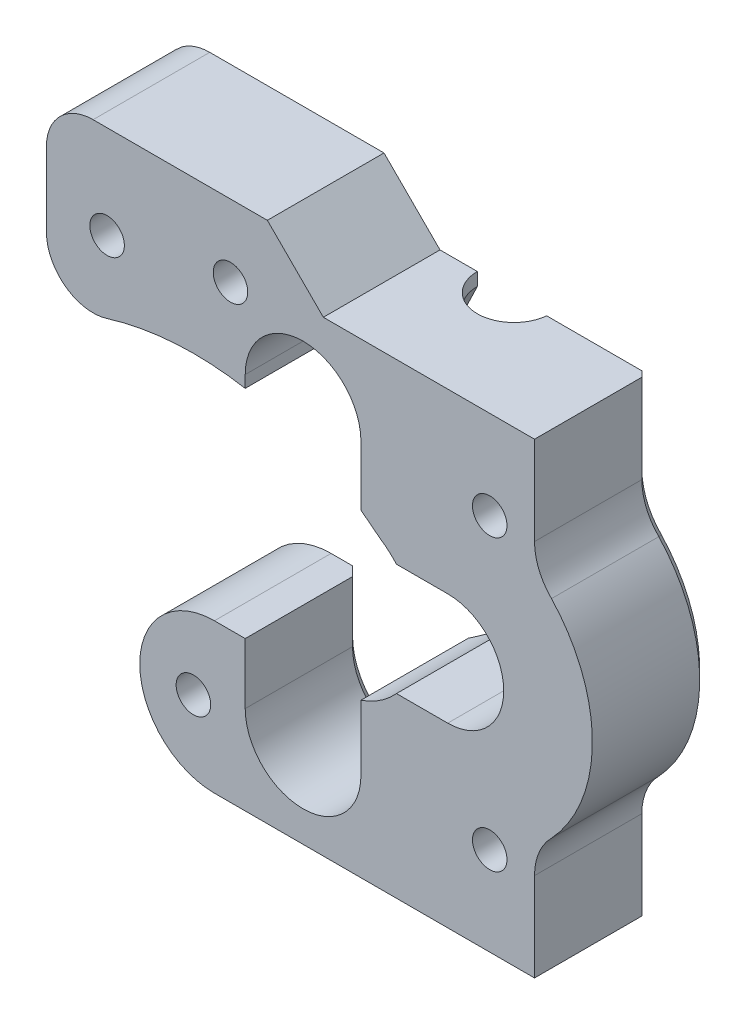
ISO-10303-21;
HEADER;
FILE_DESCRIPTION(('STEP AP214'),'2;1');
FILE_NAME('part.step','',(''),(''),'','','');
FILE_SCHEMA(('AUTOMOTIVE_DESIGN { 1 0 10303 214 1 1 1 1 }'));
ENDSEC;
DATA;
#1=APPLICATION_CONTEXT('core data for automotive mechanical design processes');
#2=APPLICATION_PROTOCOL_DEFINITION('international standard','automotive_design',2000,#1);
#3=PRODUCT_CONTEXT('',#1,'mechanical');
#4=PRODUCT('Part','Part','',(#3));
#5=PRODUCT_RELATED_PRODUCT_CATEGORY('part','',(#4));
#6=PRODUCT_DEFINITION_FORMATION('','',#4);
#7=PRODUCT_DEFINITION_CONTEXT('part definition',#1,'design');
#8=PRODUCT_DEFINITION('design','',#6,#7);
#9=PRODUCT_DEFINITION_SHAPE('','',#8);
#10=(LENGTH_UNIT() NAMED_UNIT(*) SI_UNIT(.MILLI.,.METRE.));
#11=(NAMED_UNIT(*) PLANE_ANGLE_UNIT() SI_UNIT($,.RADIAN.));
#12=(NAMED_UNIT(*) SI_UNIT($,.STERADIAN.) SOLID_ANGLE_UNIT());
#13=UNCERTAINTY_MEASURE_WITH_UNIT(LENGTH_MEASURE(1.E-05),#10,'distance_accuracy_value','');
#14=(GEOMETRIC_REPRESENTATION_CONTEXT(3) GLOBAL_UNCERTAINTY_ASSIGNED_CONTEXT((#13)) GLOBAL_UNIT_ASSIGNED_CONTEXT((#10,
#11,#12)) REPRESENTATION_CONTEXT('',''));
#15=CARTESIAN_POINT('',(0.,0.,0.));
#16=DIRECTION('',(0.,0.,1.));
#17=DIRECTION('',(1.,0.,0.));
#18=AXIS2_PLACEMENT_3D('',#15,#16,#17);
#19=CARTESIAN_POINT('',(19.6,-4.94974746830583,7.5));
#20=DIRECTION('',(0.,1.,0.));
#21=DIRECTION('',(0.,0.,1.));
#22=AXIS2_PLACEMENT_3D('',#19,#20,#21);
#23=CYLINDRICAL_SURFACE('',#22,1.75);
#24=CARTESIAN_POINT('',(19.6,18.6,7.5));
#25=DIRECTION('',(0.,0.707106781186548,-0.707106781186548));
#26=DIRECTION('',(0.,0.707106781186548,0.707106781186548));
#27=AXIS2_PLACEMENT_3D('',#24,#25,#26);
#28=ELLIPSE('',#27,2.47487373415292,1.75);
#29=CARTESIAN_POINT('',(21.3036725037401,19.,7.9));
#30=VERTEX_POINT('',#29);
#31=CARTESIAN_POINT('',(21.3047611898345,18.9953343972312,7.8953343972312));
#32=VERTEX_POINT('',#31);
#33=EDGE_CURVE('E743',#30,#32,#28,.T.);
#34=ORIENTED_EDGE('',*,*,#33,.T.);
#35=DIRECTION('',(0.,1.,0.));
#36=VECTOR('',#35,1.);
#37=CARTESIAN_POINT('',(21.3047611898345,-4.94974746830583,7.8953343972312));
#38=LINE('',#37,#36);
#39=CARTESIAN_POINT('',(21.3047611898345,15.7185179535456,7.89533439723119));
#40=VERTEX_POINT('',#39);
#41=EDGE_CURVE('E767',#32,#40,#38,.F.);
#42=ORIENTED_EDGE('',*,*,#41,.T.);
#43=CARTESIAN_POINT('',(21.3022112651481,15.7009598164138,7.90617337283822));
#44=CARTESIAN_POINT('',(21.3023175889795,15.7016913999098,7.90572148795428));
#45=CARTESIAN_POINT('',(21.3024239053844,15.7024229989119,7.90526962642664));
#46=CARTESIAN_POINT('',(21.3026365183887,15.7038861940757,7.9043659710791));
#47=CARTESIAN_POINT('',(21.3027428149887,15.704617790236,7.90391417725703));
#48=CARTESIAN_POINT('',(21.3029553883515,15.7060809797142,7.90301065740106));
#49=CARTESIAN_POINT('',(21.303061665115,15.7068125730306,7.90255893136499));
#50=CARTESIAN_POINT('',(21.3032741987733,15.7082757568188,7.90165554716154));
#51=CARTESIAN_POINT('',(21.3033804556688,15.7090073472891,7.90120388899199));
#52=CARTESIAN_POINT('',(21.3035929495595,15.7104705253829,7.90030064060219));
#53=CARTESIAN_POINT('',(21.3036991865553,15.7112021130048,7.89984905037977));
#54=CARTESIAN_POINT('',(21.3039116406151,15.7126652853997,7.89894593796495));
#55=CARTESIAN_POINT('',(21.3040178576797,15.7133968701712,7.89849441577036));
#56=CARTESIAN_POINT('',(21.3042302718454,15.7148600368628,7.89759143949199));
#57=CARTESIAN_POINT('',(21.3043364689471,15.7155916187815,7.89713998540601));
#58=CARTESIAN_POINT('',(21.3045488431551,15.7170547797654,7.89623714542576));
#59=CARTESIAN_POINT('',(21.3046550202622,15.7177863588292,7.89578575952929));
#60=CARTESIAN_POINT('',(21.3047611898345,15.7185179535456,7.8953343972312));
#61=B_SPLINE_CURVE_WITH_KNOTS('',3,(#43,#44,#45,#46,#47,#48,#49,#50,#51,#52,#53,#54,#55,#56,#57,
#58,#59,#60),.UNSPECIFIED.,.F.,.F.,(4,2,2,2,2,2,2,2,4),(0.,0.00259932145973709,
0.00519852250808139,0.00779760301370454,0.0103965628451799,0.0129954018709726,
0.0155941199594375,0.0181927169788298,0.0207911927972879),.UNSPECIFIED.);
#62=CARTESIAN_POINT('',(21.3022107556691,15.7009618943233,7.90617550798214));
#63=VERTEX_POINT('',#62);
#64=EDGE_CURVE('E769',#40,#63,#61,.F.);
#65=ORIENTED_EDGE('',*,*,#64,.T.);
#66=CARTESIAN_POINT('',(19.6,15.7009618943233,7.5));
#67=DIRECTION('',(0.,-1.,0.));
#68=DIRECTION('',(0.,0.,-1.));
#69=AXIS2_PLACEMENT_3D('',#66,#67,#68);
#70=CIRCLE('',#69,1.75);
#71=CARTESIAN_POINT('',(17.85,15.7009618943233,7.5));
#72=VERTEX_POINT('',#71);
#73=EDGE_CURVE('E764',#63,#72,#70,.T.);
#74=ORIENTED_EDGE('',*,*,#73,.T.);
#75=DIRECTION('',(0.,1.,0.));
#76=VECTOR('',#75,1.);
#77=CARTESIAN_POINT('',(17.85,-4.94974746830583,7.5));
#78=LINE('',#77,#76);
#79=CARTESIAN_POINT('',(17.85,17.5503355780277,7.5));
#80=VERTEX_POINT('',#79);
#81=EDGE_CURVE('E1471',#80,#72,#78,.F.);
#82=ORIENTED_EDGE('',*,*,#81,.F.);
#83=CARTESIAN_POINT('',(19.5082039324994,19.,5.75240923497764));
#84=CARTESIAN_POINT('',(19.4592690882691,18.945280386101,5.75498552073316));
#85=CARTESIAN_POINT('',(19.4096878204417,18.8912027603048,5.75964633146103));
#86=CARTESIAN_POINT('',(19.3094541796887,18.784507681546,5.77354308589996));
#87=CARTESIAN_POINT('',(19.2588003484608,18.7318924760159,5.78278570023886));
#88=CARTESIAN_POINT('',(19.1563064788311,18.6279715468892,5.80635767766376));
#89=CARTESIAN_POINT('',(19.1044597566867,18.5766828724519,5.82073423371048));
#90=CARTESIAN_POINT('',(19.0005243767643,18.476295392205,5.85497031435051));
#91=CARTESIAN_POINT('',(18.948435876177,18.4271953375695,5.87482666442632));
#92=CARTESIAN_POINT('',(18.8133915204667,18.3028498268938,5.93412171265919));
#93=CARTESIAN_POINT('',(18.7306034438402,18.2295271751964,5.97817002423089));
#94=CARTESIAN_POINT('',(18.5689486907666,18.0912740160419,6.08273178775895));
#95=CARTESIAN_POINT('',(18.4900685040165,18.0263131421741,6.14318303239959));
#96=CARTESIAN_POINT('',(18.3525261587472,17.916506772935,6.26974704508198));
#97=CARTESIAN_POINT('',(18.2926882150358,17.870113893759,6.33322531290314));
#98=CARTESIAN_POINT('',(18.1810826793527,17.7855106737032,6.47185444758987));
#99=CARTESIAN_POINT('',(18.1293177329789,17.7473030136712,6.54700912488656));
#100=CARTESIAN_POINT('',(18.0365680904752,17.6800494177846,6.70824118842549));
#101=CARTESIAN_POINT('',(17.9956572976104,17.6510660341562,6.79438782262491));
#102=CARTESIAN_POINT('',(17.9279139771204,17.6036338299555,6.97475278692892));
#103=CARTESIAN_POINT('',(17.901070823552,17.5851770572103,7.06896496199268));
#104=CARTESIAN_POINT('',(17.8657867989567,17.5610350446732,7.25009734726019));
#105=CARTESIAN_POINT('',(17.8554873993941,17.5540573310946,7.33648757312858));
#106=CARTESIAN_POINT('',(17.8478770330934,17.5488950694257,7.51008584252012));
#107=CARTESIAN_POINT('',(17.8505605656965,17.5507067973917,7.59729352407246));
#108=CARTESIAN_POINT('',(17.8681944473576,17.5626952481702,7.76458859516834));
#109=CARTESIAN_POINT('',(17.8824087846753,17.5723701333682,7.8447917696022));
#110=CARTESIAN_POINT('',(17.9213894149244,17.5991942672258,8.00126575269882));
#111=CARTESIAN_POINT('',(17.9461553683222,17.6163432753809,8.07753668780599));
#112=CARTESIAN_POINT('',(18.0056624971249,17.6581731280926,8.22604157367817));
#113=CARTESIAN_POINT('',(18.0406217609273,17.6830194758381,8.29814082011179));
#114=CARTESIAN_POINT('',(18.1185790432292,17.7394883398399,8.43493166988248));
#115=CARTESIAN_POINT('',(18.1615795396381,17.7711129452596,8.49962097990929));
#116=CARTESIAN_POINT('',(18.2582324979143,17.843766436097,8.62655115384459));
#117=CARTESIAN_POINT('',(18.3125109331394,17.8854062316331,8.68796278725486));
#118=CARTESIAN_POINT('',(18.4262348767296,17.9749918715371,8.80045595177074));
#119=CARTESIAN_POINT('',(18.4856823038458,18.0229400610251,8.85153362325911));
#120=CARTESIAN_POINT('',(18.6359340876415,18.1476115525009,8.96476916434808));
#121=CARTESIAN_POINT('',(18.7285490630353,18.2274028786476,9.02116289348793));
#122=CARTESIAN_POINT('',(18.9158044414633,18.3959925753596,9.11411449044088));
#123=CARTESIAN_POINT('',(19.0104504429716,18.484819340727,9.15060738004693));
#124=CARTESIAN_POINT('',(19.1732355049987,18.6445918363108,9.19868794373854));
#125=CARTESIAN_POINT('',(19.2417374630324,18.7140197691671,9.21431627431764));
#126=CARTESIAN_POINT('',(19.3766106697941,18.8552678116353,9.23701414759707));
#127=CARTESIAN_POINT('',(19.4429941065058,18.9270658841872,9.24414746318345));
#128=CARTESIAN_POINT('',(19.5082039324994,19.,9.24759076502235));
#129=B_SPLINE_CURVE_WITH_KNOTS('',3,(#83,#84,#85,#86,#87,#88,#89,#90,#91,#92,#93,#94,#95,#96,
#97,#98,#99,#100,#101,#102,#103,#104,#105,#106,#107,#108,#109,#110,#111,#112,#113,#114,#115,
#116,#117,#118,#119,#120,#121,#122,#123,#124,#125,#126,#127,#128),.UNSPECIFIED.,.F.,.F.,(4,2,2,
2,2,2,2,2,2,2,2,2,2,2,2,2,2,2,2,2,2,2,4),(0.,0.220363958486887,0.441049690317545,
0.663818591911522,0.886458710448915,1.24223337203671,1.59667719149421,1.89188638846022,
2.18719212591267,2.48445972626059,2.7815024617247,3.04197978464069,3.30234675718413,
3.5472914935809,3.79222834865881,4.04284755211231,4.29354411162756,4.56827385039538,
4.84310600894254,5.24476569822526,5.64772911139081,5.94365359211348,6.23734224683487),.UNSPECIFIED.);
#130=CARTESIAN_POINT('',(19.5082039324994,19.,9.24759076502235));
#131=VERTEX_POINT('',#130);
#132=EDGE_CURVE('E1433',#80,#131,#129,.T.);
#133=ORIENTED_EDGE('',*,*,#132,.T.);
#134=CARTESIAN_POINT('',(19.6,19.,7.5));
#135=DIRECTION('',(0.,-1.,0.));
#136=DIRECTION('',(0.,0.,-1.));
#137=AXIS2_PLACEMENT_3D('',#134,#135,#136);
#138=CIRCLE('',#137,1.75);
#139=EDGE_CURVE('E1444',#131,#30,#138,.F.);
#140=ORIENTED_EDGE('',*,*,#139,.T.);
#141=EDGE_LOOP('',(#34,#42,#65,#74,#82,#133,#140));
#142=FACE_BOUND('',#141,.T.);
#143=ADVANCED_FACE('F37',(#142),#23,.F.);
#144=CARTESIAN_POINT('',(0.,0.,7.5));
#145=DIRECTION('',(0.,0.,-1.));
#146=DIRECTION('',(-1.,0.,0.));
#147=AXIS2_PLACEMENT_3D('',#144,#145,#146);
#148=PLANE('',#147);
#149=ORIENTED_EDGE('',*,*,#81,.T.);
#150=DIRECTION('',(0.499999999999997,0.86602540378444,0.));
#151=VECTOR('',#150,1.);
#152=CARTESIAN_POINT('',(19.6,18.7320508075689,7.5));
#153=LINE('',#152,#151);
#154=CARTESIAN_POINT('',(16.7,13.7091034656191,7.5));
#155=VERTEX_POINT('',#154);
#156=EDGE_CURVE('E781',#72,#155,#153,.F.);
#157=ORIENTED_EDGE('',*,*,#156,.T.);
#158=DIRECTION('',(0.,-1.,0.));
#159=VECTOR('',#158,1.);
#160=CARTESIAN_POINT('',(16.7,16.4800234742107,7.5));
#161=LINE('',#160,#159);
#162=CARTESIAN_POINT('',(16.7,16.8888964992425,7.5));
#163=VERTEX_POINT('',#162);
#164=EDGE_CURVE('E801',#163,#155,#161,.T.);
#165=ORIENTED_EDGE('',*,*,#164,.F.);
#166=CARTESIAN_POINT('',(12.8,25.,7.5));
#167=DIRECTION('',(0.,0.,-1.));
#168=DIRECTION('',(-1.,0.,0.));
#169=AXIS2_PLACEMENT_3D('',#166,#167,#168);
#170=CIRCLE('',#169,9.00000000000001);
#171=EDGE_CURVE('E1515',#163,#80,#170,.F.);
#172=ORIENTED_EDGE('',*,*,#171,.T.);
#173=EDGE_LOOP('',(#149,#157,#165,#172));
#174=FACE_BOUND('',#173,.T.);
#175=ADVANCED_FACE('F659',(#174),#148,.T.);
#176=CARTESIAN_POINT('',(40.5,40.5,7.24551640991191));
#177=DIRECTION('',(0.,0.,1.));
#178=DIRECTION('',(1.,0.,0.));
#179=AXIS2_PLACEMENT_3D('',#176,#177,#178);
#180=CYLINDRICAL_SURFACE('',#179,6.2);
#181=DIRECTION('',(0.,0.,1.));
#182=VECTOR('',#181,1.);
#183=CARTESIAN_POINT('',(36.1159379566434,36.1159379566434,7.24551640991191));
#184=LINE('',#183,#182);
#185=CARTESIAN_POINT('',(36.1159379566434,36.1159379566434,8.50000000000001));
#186=VERTEX_POINT('',#185);
#187=CARTESIAN_POINT('',(36.1159379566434,36.1159379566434,20.));
#188=VERTEX_POINT('',#187);
#189=EDGE_CURVE('E1181',#186,#188,#184,.T.);
#190=ORIENTED_EDGE('',*,*,#189,.F.);
#191=CARTESIAN_POINT('',(40.5,40.5,8.50000000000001));
#192=DIRECTION('',(0.,0.,-1.));
#193=DIRECTION('',(-1.,0.,0.));
#194=AXIS2_PLACEMENT_3D('',#191,#192,#193);
#195=CIRCLE('',#194,6.2);
#196=CARTESIAN_POINT('',(34.3,40.5,8.50000000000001));
#197=VERTEX_POINT('',#196);
#198=EDGE_CURVE('E1056',#186,#197,#195,.T.);
#199=ORIENTED_EDGE('',*,*,#198,.T.);
#200=DIRECTION('',(0.,0.,1.));
#201=VECTOR('',#200,1.);
#202=CARTESIAN_POINT('',(34.3,40.5,7.24551640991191));
#203=LINE('',#202,#201);
#204=CARTESIAN_POINT('',(34.3,40.5,20.));
#205=VERTEX_POINT('',#204);
#206=EDGE_CURVE('E1200',#197,#205,#203,.T.);
#207=ORIENTED_EDGE('',*,*,#206,.T.);
#208=CARTESIAN_POINT('',(40.5,40.5,20.));
#209=DIRECTION('',(0.,0.,1.));
#210=DIRECTION('',(1.,0.,0.));
#211=AXIS2_PLACEMENT_3D('',#208,#209,#210);
#212=CIRCLE('',#211,6.2);
#213=EDGE_CURVE('E1188',#188,#205,#212,.F.);
#214=ORIENTED_EDGE('',*,*,#213,.F.);
#215=EDGE_LOOP('',(#190,#199,#207,#214));
#216=FACE_BOUND('',#215,.T.);
#217=ADVANCED_FACE('F666',(#216),#180,.F.);
#218=DIRECTION('',(0.78905133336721,-0.614327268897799,0.));
#219=VECTOR('',#218,1.);
#220=CARTESIAN_POINT('',(22.461667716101,28.8501093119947,7.5));
#221=LINE('',#220,#219);
#222=CARTESIAN_POINT('',(15.7,34.1145030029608,7.5));
#223=VERTEX_POINT('',#222);
#224=CARTESIAN_POINT('',(16.9843630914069,33.1145436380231,7.5));
#225=VERTEX_POINT('',#224);
#226=EDGE_CURVE('E1310',#223,#225,#221,.T.);
#227=ORIENTED_EDGE('',*,*,#226,.F.);
#228=DIRECTION('',(0.,-1.,0.));
#229=VECTOR('',#228,1.);
#230=CARTESIAN_POINT('',(15.7,0.,7.5));
#231=LINE('',#230,#229);
#232=CARTESIAN_POINT('',(15.7,40.5,7.5));
#233=VERTEX_POINT('',#232);
#234=EDGE_CURVE('E1305',#233,#223,#231,.T.);
#235=ORIENTED_EDGE('',*,*,#234,.F.);
#236=CARTESIAN_POINT('',(9.5,40.5,7.5));
#237=DIRECTION('',(0.,0.,-1.));
#238=DIRECTION('',(-1.,0.,0.));
#239=AXIS2_PLACEMENT_3D('',#236,#237,#238);
#240=CIRCLE('',#239,6.2);
#241=CARTESIAN_POINT('',(15.6252265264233,41.46,7.5));
#242=VERTEX_POINT('',#241);
#243=EDGE_CURVE('E1300',#242,#233,#240,.T.);
#244=ORIENTED_EDGE('',*,*,#243,.F.);
#245=DIRECTION('',(-1.,0.,0.));
#246=VECTOR('',#245,1.);
#247=CARTESIAN_POINT('',(19.6,41.46,7.5));
#248=LINE('',#247,#246);
#249=CARTESIAN_POINT('',(16.05,41.46,7.5));
#250=VERTEX_POINT('',#249);
#251=EDGE_CURVE('E1469',#250,#242,#248,.T.);
#252=ORIENTED_EDGE('',*,*,#251,.F.);
#253=DIRECTION('',(0.,1.,0.));
#254=VECTOR('',#253,1.);
#255=CARTESIAN_POINT('',(16.05,37.46,7.5));
#256=LINE('',#255,#254);
#257=CARTESIAN_POINT('',(16.05,37.46,7.5));
#258=VERTEX_POINT('',#257);
#259=EDGE_CURVE('E1458',#250,#258,#256,.F.);
#260=ORIENTED_EDGE('',*,*,#259,.T.);
#261=DIRECTION('',(-1.,0.,0.));
#262=VECTOR('',#261,1.);
#263=CARTESIAN_POINT('',(19.6,37.46,7.5));
#264=LINE('',#263,#262);
#265=CARTESIAN_POINT('',(17.45,37.46,7.5));
#266=VERTEX_POINT('',#265);
#267=EDGE_CURVE('E1465',#266,#258,#264,.T.);
#268=ORIENTED_EDGE('',*,*,#267,.F.);
#269=DIRECTION('',(0.,-1.,0.));
#270=VECTOR('',#269,1.);
#271=CARTESIAN_POINT('',(17.45,36.0000000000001,7.5));
#272=LINE('',#271,#270);
#273=CARTESIAN_POINT('',(17.45,34.6666666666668,7.5));
#274=VERTEX_POINT('',#273);
#275=EDGE_CURVE('E522',#266,#274,#272,.T.);
#276=ORIENTED_EDGE('',*,*,#275,.T.);
#277=DIRECTION('',(0.287347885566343,0.957826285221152,0.));
#278=VECTOR('',#277,1.);
#279=CARTESIAN_POINT('',(19.6,41.8333333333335,7.5));
#280=LINE('',#279,#278);
#281=EDGE_CURVE('E1475',#225,#274,#280,.T.);
#282=ORIENTED_EDGE('',*,*,#281,.F.);
#283=EDGE_LOOP('',(#227,#235,#244,#252,#260,#268,#276,#282));
#284=FACE_BOUND('',#283,.T.);
#285=ADVANCED_FACE('F669',(#284),#148,.T.);
#286=CARTESIAN_POINT('',(1.72182540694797,48.278174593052,-4.99999999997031E-05));
#287=DIRECTION('',(0.,0.,1.));
#288=DIRECTION('',(1.,0.,0.));
#289=AXIS2_PLACEMENT_3D('',#286,#287,#288);
#290=CYLINDRICAL_SURFACE('',#289,1.85);
#291=CARTESIAN_POINT('',(1.72182540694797,48.278174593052,7.90000000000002));
#292=DIRECTION('',(0.,0.,-1.));
#293=DIRECTION('',(-1.,0.,0.));
#294=AXIS2_PLACEMENT_3D('',#291,#292,#293);
#295=CIRCLE('',#294,1.85);
#296=CARTESIAN_POINT('',(-0.128174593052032,48.278174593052,7.90000000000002));
#297=VERTEX_POINT('',#296);
#298=EDGE_CURVE('E501',#297,#297,#295,.T.);
#299=ORIENTED_EDGE('',*,*,#298,.T.);
#300=EDGE_LOOP('',(#299));
#301=FACE_BOUND('',#300,.T.);
#302=CARTESIAN_POINT('',(1.72182540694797,48.278174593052,20.));
#303=DIRECTION('',(0.,0.,1.));
#304=DIRECTION('',(1.,0.,0.));
#305=AXIS2_PLACEMENT_3D('',#302,#303,#304);
#306=CIRCLE('',#305,1.85);
#307=CARTESIAN_POINT('',(3.57182540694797,48.278174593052,20.));
#308=VERTEX_POINT('',#307);
#309=EDGE_CURVE('E1221',#308,#308,#306,.F.);
#310=ORIENTED_EDGE('',*,*,#309,.F.);
#311=EDGE_LOOP('',(#310));
#312=FACE_BOUND('',#311,.T.);
#313=ADVANCED_FACE('F859',(#301,#312),#290,.F.);
#314=CARTESIAN_POINT('',(29.5,9.5,0.));
#315=DIRECTION('',(0.,0.,1.));
#316=DIRECTION('',(1.,0.,0.));
#317=AXIS2_PLACEMENT_3D('',#314,#315,#316);
#318=CYLINDRICAL_SURFACE('',#317,1.85);
#319=CARTESIAN_POINT('',(29.5,9.5,7.9));
#320=DIRECTION('',(0.,0.,-1.));
#321=DIRECTION('',(-1.,0.,0.));
#322=AXIS2_PLACEMENT_3D('',#319,#320,#321);
#323=CIRCLE('',#322,1.85);
#324=CARTESIAN_POINT('',(27.65,9.5,7.9));
#325=VERTEX_POINT('',#324);
#326=EDGE_CURVE('E519',#325,#325,#323,.T.);
#327=ORIENTED_EDGE('',*,*,#326,.T.);
#328=EDGE_LOOP('',(#327));
#329=FACE_BOUND('',#328,.T.);
#330=CARTESIAN_POINT('',(29.5,9.5,20.));
#331=DIRECTION('',(0.,0.,1.));
#332=DIRECTION('',(1.,0.,0.));
#333=AXIS2_PLACEMENT_3D('',#330,#331,#332);
#334=CIRCLE('',#333,1.85);
#335=CARTESIAN_POINT('',(31.35,9.5,20.));
#336=VERTEX_POINT('',#335);
#337=EDGE_CURVE('E1269',#336,#336,#334,.F.);
#338=ORIENTED_EDGE('',*,*,#337,.F.);
#339=EDGE_LOOP('',(#338));
#340=FACE_BOUND('',#339,.T.);
#341=ADVANCED_FACE('F1876',(#329,#340),#318,.F.);
#342=CARTESIAN_POINT('',(29.5,40.5,0.));
#343=DIRECTION('',(0.,0.,1.));
#344=DIRECTION('',(1.,0.,0.));
#345=AXIS2_PLACEMENT_3D('',#342,#343,#344);
#346=CYLINDRICAL_SURFACE('',#345,1.84999999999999);
#347=CARTESIAN_POINT('',(29.5,40.5,7.90000000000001));
#348=DIRECTION('',(0.,0.,-1.));
#349=DIRECTION('',(-1.,0.,0.));
#350=AXIS2_PLACEMENT_3D('',#347,#348,#349);
#351=CIRCLE('',#350,1.84999999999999);
#352=CARTESIAN_POINT('',(27.65,40.5,7.90000000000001));
#353=VERTEX_POINT('',#352);
#354=EDGE_CURVE('E510',#353,#353,#351,.T.);
#355=ORIENTED_EDGE('',*,*,#354,.T.);
#356=EDGE_LOOP('',(#355));
#357=FACE_BOUND('',#356,.T.);
#358=CARTESIAN_POINT('',(29.5,40.5,20.));
#359=DIRECTION('',(0.,0.,1.));
#360=DIRECTION('',(1.,0.,0.));
#361=AXIS2_PLACEMENT_3D('',#358,#359,#360);
#362=CIRCLE('',#361,1.84999999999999);
#363=CARTESIAN_POINT('',(31.35,40.5,20.));
#364=VERTEX_POINT('',#363);
#365=EDGE_CURVE('E1224',#364,#364,#362,.F.);
#366=ORIENTED_EDGE('',*,*,#365,.F.);
#367=EDGE_LOOP('',(#366));
#368=FACE_BOUND('',#367,.T.);
#369=ADVANCED_FACE('F1426',(#357,#368),#346,.F.);
#370=CARTESIAN_POINT('',(12.8,25.,0.));
#371=DIRECTION('',(0.,0.,1.));
#372=DIRECTION('',(1.,0.,0.));
#373=AXIS2_PLACEMENT_3D('',#370,#371,#372);
#374=CYLINDRICAL_SURFACE('',#373,9.00000000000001);
#375=CARTESIAN_POINT('',(12.8,25.,20.));
#376=DIRECTION('',(0.,0.,1.));
#377=DIRECTION('',(1.,0.,0.));
#378=AXIS2_PLACEMENT_3D('',#375,#376,#377);
#379=CIRCLE('',#378,9.00000000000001);
#380=CARTESIAN_POINT('',(17.7665849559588,32.5055335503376,20.));
#381=VERTEX_POINT('',#380);
#382=CARTESIAN_POINT('',(19.5082039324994,31.,20.));
#383=VERTEX_POINT('',#382);
#384=EDGE_CURVE('E1255',#381,#383,#379,.F.);
#385=ORIENTED_EDGE('',*,*,#384,.F.);
#386=DIRECTION('',(0.,0.,1.));
#387=VECTOR('',#386,1.);
#388=CARTESIAN_POINT('',(17.7665849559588,32.5055335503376,7.24551640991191));
#389=LINE('',#388,#387);
#390=CARTESIAN_POINT('',(17.7665849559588,32.5055335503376,9.61407087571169));
#391=VERTEX_POINT('',#390);
#392=EDGE_CURVE('E2334',#391,#381,#389,.T.);
#393=ORIENTED_EDGE('',*,*,#392,.F.);
#394=CARTESIAN_POINT('',(19.5083828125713,30.9997999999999,4.25123157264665));
#395=CARTESIAN_POINT('',(19.4585608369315,31.0555076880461,4.26935712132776));
#396=CARTESIAN_POINT('',(19.408197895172,31.1104197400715,4.28842504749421));
#397=CARTESIAN_POINT('',(19.3065178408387,31.2185798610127,4.32869610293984));
#398=CARTESIAN_POINT('',(19.2552004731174,31.2718274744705,4.34989981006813));
#399=CARTESIAN_POINT('',(19.0996967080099,31.4292770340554,4.41722781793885));
#400=CARTESIAN_POINT('',(18.9943005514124,31.5308043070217,4.46694871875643));
#401=CARTESIAN_POINT('',(18.7809616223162,31.7267593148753,4.5783928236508));
#402=CARTESIAN_POINT('',(18.6730039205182,31.8211058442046,4.64023114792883));
#403=CARTESIAN_POINT('',(18.4580395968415,32.0004366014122,4.77729402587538));
#404=CARTESIAN_POINT('',(18.3510316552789,32.085436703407,4.85249529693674));
#405=CARTESIAN_POINT('',(18.1826148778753,32.2134471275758,4.98482461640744));
#406=CARTESIAN_POINT('',(18.119977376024,32.2597249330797,5.03726606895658));
#407=CARTESIAN_POINT('',(17.9968566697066,32.3483619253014,5.14768050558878));
#408=CARTESIAN_POINT('',(17.9363727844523,32.3907223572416,5.20565171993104));
#409=CARTESIAN_POINT('',(17.8185810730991,32.4712059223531,5.32698956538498));
#410=CARTESIAN_POINT('',(17.761262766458,32.5093435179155,5.39033638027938));
#411=CARTESIAN_POINT('',(17.6504601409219,32.5813852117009,5.522507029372));
#412=CARTESIAN_POINT('',(17.5969740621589,32.6152912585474,5.59132831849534));
#413=CARTESIAN_POINT('',(17.4941830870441,32.6790847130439,5.73496687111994));
#414=CARTESIAN_POINT('',(17.4449245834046,32.7089292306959,5.80983653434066));
#415=CARTESIAN_POINT('',(17.3520983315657,32.7641043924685,5.96455681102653));
#416=CARTESIAN_POINT('',(17.3085278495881,32.7894372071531,6.04440500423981));
#417=CARTESIAN_POINT('',(17.227845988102,32.8355819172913,6.20865393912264));
#418=CARTESIAN_POINT('',(17.1907406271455,32.8563896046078,6.29305882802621));
#419=CARTESIAN_POINT('',(17.1237855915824,32.8934368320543,6.46566236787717));
#420=CARTESIAN_POINT('',(17.0939349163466,32.9096770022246,6.55386049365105));
#421=CARTESIAN_POINT('',(17.0451659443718,32.9359460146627,6.72263018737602));
#422=CARTESIAN_POINT('',(17.0253725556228,32.9464821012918,6.80287119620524));
#423=CARTESIAN_POINT('',(16.9922172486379,32.9640232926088,6.96508243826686));
#424=CARTESIAN_POINT('',(16.9788574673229,32.9710272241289,7.0470532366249));
#425=CARTESIAN_POINT('',(16.958815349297,32.9815027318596,7.21195406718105));
#426=CARTESIAN_POINT('',(16.9521264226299,32.9849777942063,7.29488307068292));
#427=CARTESIAN_POINT('',(16.9455041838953,32.9884165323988,7.46109116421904));
#428=CARTESIAN_POINT('',(16.9455732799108,32.9883789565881,7.54437036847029));
#429=CARTESIAN_POINT('',(16.9554602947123,32.9832496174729,7.78154531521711));
#430=CARTESIAN_POINT('',(16.9735404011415,32.9738756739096,7.93510661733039));
#431=CARTESIAN_POINT('',(17.0320149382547,32.9429908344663,8.23652949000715));
#432=CARTESIAN_POINT('',(17.0724067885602,32.9214813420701,8.38439171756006));
#433=CARTESIAN_POINT('',(17.1734736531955,32.8661325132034,8.67136786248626));
#434=CARTESIAN_POINT('',(17.2342455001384,32.8322342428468,8.81043617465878));
#435=CARTESIAN_POINT('',(17.3727437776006,32.752185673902,9.07597003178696));
#436=CARTESIAN_POINT('',(17.450472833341,32.7060334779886,9.2024336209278));
#437=CARTESIAN_POINT('',(17.6251271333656,32.5979873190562,9.44944859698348));
#438=CARTESIAN_POINT('',(17.7230357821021,32.5351943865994,9.56890587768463));
#439=CARTESIAN_POINT('',(17.9289838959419,32.396546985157,9.7901770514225));
#440=CARTESIAN_POINT('',(18.037028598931,32.3206857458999,9.89198174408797));
#441=CARTESIAN_POINT('',(18.2306524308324,32.1776506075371,10.0548375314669));
#442=CARTESIAN_POINT('',(18.315033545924,32.113103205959,10.1196941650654));
#443=CARTESIAN_POINT('',(18.485293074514,31.9777691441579,10.2404012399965));
#444=CARTESIAN_POINT('',(18.5711722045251,31.9069794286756,10.2962472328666));
#445=CARTESIAN_POINT('',(18.7431133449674,31.7596044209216,10.399749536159));
#446=CARTESIAN_POINT('',(18.8291754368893,31.6830106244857,10.4473934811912));
#447=CARTESIAN_POINT('',(19.0002495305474,31.5246070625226,10.5353371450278));
#448=CARTESIAN_POINT('',(19.0852613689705,31.4427964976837,10.5756357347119));
#449=CARTESIAN_POINT('',(19.2269934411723,31.3008278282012,10.6382443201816));
#450=CARTESIAN_POINT('',(19.2842342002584,31.241914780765,10.6622349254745));
#451=CARTESIAN_POINT('',(19.3973317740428,31.1222524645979,10.7074518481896));
#452=CARTESIAN_POINT('',(19.4531934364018,31.0615120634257,10.7286894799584));
#453=CARTESIAN_POINT('',(19.5083828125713,30.9997999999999,10.7487684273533));
#454=B_SPLINE_CURVE_WITH_KNOTS('',3,(#394,#395,#396,#397,#398,#399,#400,#401,#402,#403,#404,
#405,#406,#407,#408,#409,#410,#411,#412,#413,#414,#415,#416,#417,#418,#419,#420,#421,#422,#423,
#424,#425,#426,#427,#428,#429,#430,#431,#432,#433,#434,#435,#436,#437,#438,#439,#440,#441,#442,
#443,#444,#445,#446,#447,#448,#449,#450,#451,#452,#453),.UNSPECIFIED.,.F.,.F.,(4,2,2,2,2,2,2,2,
2,2,2,2,2,2,2,2,2,2,2,2,2,2,2,2,2,2,2,2,2,4),(0.,0.230686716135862,0.461436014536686,
0.924508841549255,1.39221531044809,1.8591147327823,2.14055119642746,2.42189788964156,
2.70224910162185,2.98247073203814,3.26545354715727,3.54829985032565,3.8314080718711,
4.11447722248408,4.3640922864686,4.61379020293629,4.86324120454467,5.1127810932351,
5.57509343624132,6.03735232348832,6.50183944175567,6.96639852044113,7.46465244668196,
7.96316528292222,8.336083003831,8.70918427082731,9.08284319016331,9.45655949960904,
9.71320939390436,9.96876858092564),.UNSPECIFIED.);
#455=CARTESIAN_POINT('',(19.5082039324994,31.,10.7487033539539));
#456=VERTEX_POINT('',#455);
#457=EDGE_CURVE('E1311',#391,#456,#454,.T.);
#458=ORIENTED_EDGE('',*,*,#457,.T.);
#459=DIRECTION('',(0.,0.,1.));
#460=VECTOR('',#459,1.);
#461=CARTESIAN_POINT('',(19.5082039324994,31.,0.));
#462=LINE('',#461,#460);
#463=EDGE_CURVE('E1506',#383,#456,#462,.F.);
#464=ORIENTED_EDGE('',*,*,#463,.F.);
#465=EDGE_LOOP('',(#385,#393,#458,#464));
#466=FACE_BOUND('',#465,.T.);
#467=ADVANCED_FACE('F1422',(#466),#374,.F.);
#468=ORIENTED_EDGE('',*,*,#171,.F.);
#469=CARTESIAN_POINT('',(12.8,25.,11.4));
#470=DIRECTION('',(-0.707106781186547,0.,-0.707106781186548));
#471=DIRECTION('',(-0.707106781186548,0.,0.707106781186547));
#472=AXIS2_PLACEMENT_3D('',#469,#470,#471);
#473=ELLIPSE('',#472,12.7279220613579,9.00000000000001);
#474=CARTESIAN_POINT('',(15.7,16.4800234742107,8.50000000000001));
#475=VERTEX_POINT('',#474);
#476=EDGE_CURVE('E471',#163,#475,#473,.T.);
#477=ORIENTED_EDGE('',*,*,#476,.T.);
#478=DIRECTION('',(0.,0.,1.));
#479=VECTOR('',#478,1.);
#480=CARTESIAN_POINT('',(15.7,16.4800234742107,7.24551640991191));
#481=LINE('',#480,#479);
#482=CARTESIAN_POINT('',(15.7,16.4800234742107,20.));
#483=VERTEX_POINT('',#482);
#484=EDGE_CURVE('E1282',#475,#483,#481,.T.);
#485=ORIENTED_EDGE('',*,*,#484,.T.);
#486=CARTESIAN_POINT('',(12.8,25.,20.));
#487=DIRECTION('',(0.,0.,1.));
#488=DIRECTION('',(1.,0.,0.));
#489=AXIS2_PLACEMENT_3D('',#486,#487,#488);
#490=CIRCLE('',#489,9.00000000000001);
#491=CARTESIAN_POINT('',(19.5082039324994,19.,20.));
#492=VERTEX_POINT('',#491);
#493=EDGE_CURVE('E1266',#492,#483,#490,.F.);
#494=ORIENTED_EDGE('',*,*,#493,.F.);
#495=DIRECTION('',(0.,0.,1.));
#496=VECTOR('',#495,1.);
#497=CARTESIAN_POINT('',(19.5082039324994,19.,0.));
#498=LINE('',#497,#496);
#499=EDGE_CURVE('E1440',#131,#492,#498,.T.);
#500=ORIENTED_EDGE('',*,*,#499,.F.);
#501=ORIENTED_EDGE('',*,*,#132,.F.);
#502=EDGE_LOOP('',(#468,#477,#485,#494,#500,#501));
#503=FACE_BOUND('',#502,.T.);
#504=ADVANCED_FACE('F686',(#503),#374,.F.);
#505=CARTESIAN_POINT('',(25.,19.,0.));
#506=DIRECTION('',(0.,-1.,0.));
#507=DIRECTION('',(0.,0.,-1.));
#508=AXIS2_PLACEMENT_3D('',#505,#506,#507);
#509=PLANE('',#508);
#510=DIRECTION('',(0.,0.,1.));
#511=VECTOR('',#510,1.);
#512=CARTESIAN_POINT('',(25.,19.,0.));
#513=LINE('',#512,#511);
#514=CARTESIAN_POINT('',(25.,19.,7.89999999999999));
#515=VERTEX_POINT('',#514);
#516=CARTESIAN_POINT('',(25.,19.,20.));
#517=VERTEX_POINT('',#516);
#518=EDGE_CURVE('E1439',#515,#517,#513,.T.);
#519=ORIENTED_EDGE('',*,*,#518,.F.);
#520=DIRECTION('',(-1.,0.,0.));
#521=VECTOR('',#520,1.);
#522=CARTESIAN_POINT('',(21.35,19.,7.89999999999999));
#523=LINE('',#522,#521);
#524=EDGE_CURVE('E741',#515,#30,#523,.T.);
#525=ORIENTED_EDGE('',*,*,#524,.T.);
#526=ORIENTED_EDGE('',*,*,#139,.F.);
#527=ORIENTED_EDGE('',*,*,#499,.T.);
#528=DIRECTION('',(-1.,0.,0.));
#529=VECTOR('',#528,1.);
#530=CARTESIAN_POINT('',(0.,19.,20.));
#531=LINE('',#530,#529);
#532=EDGE_CURVE('E1263',#517,#492,#531,.T.);
#533=ORIENTED_EDGE('',*,*,#532,.F.);
#534=EDGE_LOOP('',(#519,#525,#526,#527,#533));
#535=FACE_BOUND('',#534,.T.);
#536=ADVANCED_FACE('F677',(#535),#509,.F.);
#537=CARTESIAN_POINT('',(19.6,36.0000000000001,7.5));
#538=DIRECTION('',(0.,1.,0.));
#539=DIRECTION('',(0.,0.,1.));
#540=AXIS2_PLACEMENT_3D('',#537,#538,#539);
#541=CIRCLE('',#540,1.75);
#542=CARTESIAN_POINT('',(21.2878825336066,36.0000000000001,7.96211746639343));
#543=VERTEX_POINT('',#542);
#544=CARTESIAN_POINT('',(17.9121174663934,36.0000000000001,7.96211746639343));
#545=VERTEX_POINT('',#544);
#546=EDGE_CURVE('E691',#543,#545,#541,.F.);
#547=ORIENTED_EDGE('',*,*,#546,.T.);
#548=DIRECTION('',(0.,1.,0.));
#549=VECTOR('',#548,1.);
#550=CARTESIAN_POINT('',(17.9121174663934,-4.94974746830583,7.96211746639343));
#551=LINE('',#550,#549);
#552=CARTESIAN_POINT('',(17.9121174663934,37.46,7.96211746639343));
#553=VERTEX_POINT('',#552);
#554=EDGE_CURVE('E694',#545,#553,#551,.T.);
#555=ORIENTED_EDGE('',*,*,#554,.T.);
#556=CARTESIAN_POINT('',(19.6,37.46,7.5));
#557=DIRECTION('',(0.,1.,0.));
#558=DIRECTION('',(0.,0.,1.));
#559=AXIS2_PLACEMENT_3D('',#556,#557,#558);
#560=CIRCLE('',#559,1.75);
#561=CARTESIAN_POINT('',(21.2878825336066,37.46,7.96211746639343));
#562=VERTEX_POINT('',#561);
#563=EDGE_CURVE('E1404',#562,#553,#560,.F.);
#564=ORIENTED_EDGE('',*,*,#563,.F.);
#565=DIRECTION('',(0.,1.,0.));
#566=VECTOR('',#565,1.);
#567=CARTESIAN_POINT('',(21.2878825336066,-4.94974746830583,7.96211746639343));
#568=LINE('',#567,#566);
#569=EDGE_CURVE('E697',#562,#543,#568,.F.);
#570=ORIENTED_EDGE('',*,*,#569,.T.);
#571=EDGE_LOOP('',(#547,#555,#564,#570));
#572=FACE_BOUND('',#571,.T.);
#573=ADVANCED_FACE('F662',(#572),#23,.F.);
#574=CARTESIAN_POINT('',(0.,0.,15.));
#575=DIRECTION('',(0.,1.,0.));
#576=DIRECTION('',(0.,0.,1.));
#577=AXIS2_PLACEMENT_3D('',#574,#575,#576);
#578=PLANE('',#577);
#579=CARTESIAN_POINT('',(19.6,0.,7.5));
#580=DIRECTION('',(0.,1.,0.));
#581=DIRECTION('',(0.,0.,1.));
#582=AXIS2_PLACEMENT_3D('',#579,#580,#581);
#583=CIRCLE('',#582,7.);
#584=CARTESIAN_POINT('',(12.6,0.,7.5));
#585=VERTEX_POINT('',#584);
#586=CARTESIAN_POINT('',(26.5825645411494,0.,7.99375340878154));
#587=VERTEX_POINT('',#586);
#588=EDGE_CURVE('E807',#585,#587,#583,.T.);
#589=ORIENTED_EDGE('',*,*,#588,.T.);
#590=DIRECTION('',(1.,0.,0.));
#591=VECTOR('',#590,1.);
#592=CARTESIAN_POINT('',(33.3,0.,7.99375340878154));
#593=LINE('',#592,#591);
#594=CARTESIAN_POINT('',(33.7937534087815,0.,7.99375340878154));
#595=VERTEX_POINT('',#594);
#596=EDGE_CURVE('E817',#587,#595,#593,.T.);
#597=ORIENTED_EDGE('',*,*,#596,.T.);
#598=DIRECTION('',(0.70710678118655,0.,0.707106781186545));
#599=VECTOR('',#598,1.);
#600=CARTESIAN_POINT('',(34.3,0.,8.50000000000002));
#601=LINE('',#600,#599);
#602=CARTESIAN_POINT('',(34.3,0.,8.50000000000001));
#603=VERTEX_POINT('',#602);
#604=EDGE_CURVE('E1052',#595,#603,#601,.T.);
#605=ORIENTED_EDGE('',*,*,#604,.T.);
#606=DIRECTION('',(0.,0.,1.));
#607=VECTOR('',#606,1.);
#608=CARTESIAN_POINT('',(34.3,0.,7.24551640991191));
#609=LINE('',#608,#607);
#610=CARTESIAN_POINT('',(34.3,0.,20.));
#611=VERTEX_POINT('',#610);
#612=EDGE_CURVE('E1164',#603,#611,#609,.T.);
#613=ORIENTED_EDGE('',*,*,#612,.T.);
#614=DIRECTION('',(1.,0.,0.));
#615=VECTOR('',#614,1.);
#616=CARTESIAN_POINT('',(0.,0.,20.));
#617=LINE('',#616,#615);
#618=CARTESIAN_POINT('',(0.,0.,20.));
#619=VERTEX_POINT('',#618);
#620=EDGE_CURVE('E1239',#619,#611,#617,.T.);
#621=ORIENTED_EDGE('',*,*,#620,.F.);
#622=DIRECTION('',(0.,0.,1.));
#623=VECTOR('',#622,1.);
#624=CARTESIAN_POINT('',(0.,0.,7.5));
#625=LINE('',#624,#623);
#626=CARTESIAN_POINT('',(0.,0.,7.5));
#627=VERTEX_POINT('',#626);
#628=EDGE_CURVE('E1321',#619,#627,#625,.F.);
#629=ORIENTED_EDGE('',*,*,#628,.T.);
#630=DIRECTION('',(-1.,0.,0.));
#631=VECTOR('',#630,1.);
#632=CARTESIAN_POINT('',(50.,0.,7.5));
#633=LINE('',#632,#631);
#634=EDGE_CURVE('E1487',#585,#627,#633,.T.);
#635=ORIENTED_EDGE('',*,*,#634,.F.);
#636=EDGE_LOOP('',(#589,#597,#605,#613,#621,#629,#635));
#637=FACE_BOUND('',#636,.T.);
#638=ADVANCED_FACE('F676',(#637),#578,.F.);
#639=CARTESIAN_POINT('',(0.,50.,15.));
#640=DIRECTION('',(0.,-1.,0.));
#641=DIRECTION('',(0.,0.,-1.));
#642=AXIS2_PLACEMENT_3D('',#639,#640,#641);
#643=PLANE('',#642);
#644=DIRECTION('',(-0.70710678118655,0.,-0.707106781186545));
#645=VECTOR('',#644,1.);
#646=CARTESIAN_POINT('',(34.3,50.,8.50000000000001));
#647=LINE('',#646,#645);
#648=CARTESIAN_POINT('',(34.3,50.,8.50000000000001));
#649=VERTEX_POINT('',#648);
#650=CARTESIAN_POINT('',(33.7,50.,7.9));
#651=VERTEX_POINT('',#650);
#652=EDGE_CURVE('E1060',#649,#651,#647,.T.);
#653=ORIENTED_EDGE('',*,*,#652,.T.);
#654=DIRECTION('',(-1.,0.,0.));
#655=VECTOR('',#654,1.);
#656=CARTESIAN_POINT('',(23.525,50.,7.9));
#657=LINE('',#656,#655);
#658=CARTESIAN_POINT('',(23.5045646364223,50.,7.9));
#659=VERTEX_POINT('',#658);
#660=EDGE_CURVE('E821',#651,#659,#657,.T.);
#661=ORIENTED_EDGE('',*,*,#660,.T.);
#662=CARTESIAN_POINT('',(19.6,50.,7.5));
#663=DIRECTION('',(0.,1.,0.));
#664=DIRECTION('',(0.,0.,1.));
#665=AXIS2_PLACEMENT_3D('',#662,#663,#664);
#666=CIRCLE('',#665,3.925);
#667=CARTESIAN_POINT('',(15.675,50.,7.5));
#668=VERTEX_POINT('',#667);
#669=EDGE_CURVE('E701',#668,#659,#666,.T.);
#670=ORIENTED_EDGE('',*,*,#669,.F.);
#671=DIRECTION('',(1.,0.,0.));
#672=VECTOR('',#671,1.);
#673=CARTESIAN_POINT('',(0.,50.,7.5));
#674=LINE('',#673,#672);
#675=CARTESIAN_POINT('',(11.6730585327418,50.,7.5));
#676=VERTEX_POINT('',#675);
#677=EDGE_CURVE('E1486',#676,#668,#674,.T.);
#678=ORIENTED_EDGE('',*,*,#677,.F.);
#679=DIRECTION('',(0.,0.,1.));
#680=VECTOR('',#679,1.);
#681=CARTESIAN_POINT('',(11.6730585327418,50.,-13.1247969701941));
#682=LINE('',#681,#680);
#683=CARTESIAN_POINT('',(11.6730585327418,50.,20.));
#684=VERTEX_POINT('',#683);
#685=EDGE_CURVE('E1420',#676,#684,#682,.T.);
#686=ORIENTED_EDGE('',*,*,#685,.T.);
#687=DIRECTION('',(-1.,0.,0.));
#688=VECTOR('',#687,1.);
#689=CARTESIAN_POINT('',(0.,50.,20.));
#690=LINE('',#689,#688);
#691=CARTESIAN_POINT('',(34.3,50.,20.));
#692=VERTEX_POINT('',#691);
#693=EDGE_CURVE('E1241',#692,#684,#690,.T.);
#694=ORIENTED_EDGE('',*,*,#693,.F.);
#695=DIRECTION('',(0.,0.,1.));
#696=VECTOR('',#695,1.);
#697=CARTESIAN_POINT('',(34.3,50.,7.24551640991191));
#698=LINE('',#697,#696);
#699=EDGE_CURVE('E1198',#649,#692,#698,.T.);
#700=ORIENTED_EDGE('',*,*,#699,.F.);
#701=EDGE_LOOP('',(#653,#661,#670,#678,#686,#694,#700));
#702=FACE_BOUND('',#701,.T.);
#703=ADVANCED_FACE('F683',(#702),#643,.F.);
#704=CARTESIAN_POINT('',(25.,25.,-16.9705627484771));
#705=DIRECTION('',(0.,0.,1.));
#706=DIRECTION('',(1.,0.,0.));
#707=AXIS2_PLACEMENT_3D('',#704,#705,#706);
#708=CYLINDRICAL_SURFACE('',#707,6.);
#709=DIRECTION('',(0.,0.,1.));
#710=VECTOR('',#709,1.);
#711=CARTESIAN_POINT('',(25.,31.,0.));
#712=LINE('',#711,#710);
#713=CARTESIAN_POINT('',(25.,31.,7.89999999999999));
#714=VERTEX_POINT('',#713);
#715=CARTESIAN_POINT('',(25.,31.,20.));
#716=VERTEX_POINT('',#715);
#717=EDGE_CURVE('E1442',#714,#716,#712,.T.);
#718=ORIENTED_EDGE('',*,*,#717,.F.);
#719=CARTESIAN_POINT('',(25.,25.,7.89999999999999));
#720=DIRECTION('',(0.,0.,-1.));
#721=DIRECTION('',(-1.,0.,0.));
#722=AXIS2_PLACEMENT_3D('',#719,#720,#721);
#723=CIRCLE('',#722,6.);
#724=EDGE_CURVE('E749',#714,#515,#723,.T.);
#725=ORIENTED_EDGE('',*,*,#724,.T.);
#726=ORIENTED_EDGE('',*,*,#518,.T.);
#727=CARTESIAN_POINT('',(25.,25.,20.));
#728=DIRECTION('',(0.,0.,1.));
#729=DIRECTION('',(1.,0.,0.));
#730=AXIS2_PLACEMENT_3D('',#727,#728,#729);
#731=CIRCLE('',#730,6.);
#732=EDGE_CURVE('E1260',#716,#517,#731,.F.);
#733=ORIENTED_EDGE('',*,*,#732,.F.);
#734=EDGE_LOOP('',(#718,#725,#726,#733));
#735=FACE_BOUND('',#734,.T.);
#736=ADVANCED_FACE('F1567',(#735),#708,.F.);
#737=CARTESIAN_POINT('',(19.6,48.61,7.5));
#738=DIRECTION('',(0.,1.,0.));
#739=DIRECTION('',(0.,0.,1.));
#740=AXIS2_PLACEMENT_3D('',#737,#738,#739);
#741=CYLINDRICAL_SURFACE('',#740,3.925);
#742=ORIENTED_EDGE('',*,*,#669,.T.);
#743=CARTESIAN_POINT('',(19.6,49.6,7.5));
#744=DIRECTION('',(0.,0.707106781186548,-0.707106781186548));
#745=DIRECTION('',(0.,0.707106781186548,0.707106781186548));
#746=AXIS2_PLACEMENT_3D('',#743,#744,#745);
#747=ELLIPSE('',#746,5.55078823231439,3.925);
#748=CARTESIAN_POINT('',(23.525,49.6,7.5));
#749=VERTEX_POINT('',#748);
#750=EDGE_CURVE('E815',#659,#749,#747,.T.);
#751=ORIENTED_EDGE('',*,*,#750,.T.);
#752=DIRECTION('',(0.,1.,0.));
#753=VECTOR('',#752,1.);
#754=CARTESIAN_POINT('',(23.525,48.61,7.5));
#755=LINE('',#754,#753);
#756=CARTESIAN_POINT('',(23.525,48.61,7.5));
#757=VERTEX_POINT('',#756);
#758=EDGE_CURVE('E1026',#757,#749,#755,.T.);
#759=ORIENTED_EDGE('',*,*,#758,.F.);
#760=CARTESIAN_POINT('',(19.6,48.61,7.5));
#761=DIRECTION('',(0.,1.,0.));
#762=DIRECTION('',(0.,0.,1.));
#763=AXIS2_PLACEMENT_3D('',#760,#761,#762);
#764=CIRCLE('',#763,3.925);
#765=CARTESIAN_POINT('',(15.675,48.61,7.5));
#766=VERTEX_POINT('',#765);
#767=EDGE_CURVE('E1402',#757,#766,#764,.F.);
#768=ORIENTED_EDGE('',*,*,#767,.T.);
#769=DIRECTION('',(0.,1.,0.));
#770=VECTOR('',#769,1.);
#771=CARTESIAN_POINT('',(15.675,48.61,7.5));
#772=LINE('',#771,#770);
#773=EDGE_CURVE('E1484',#668,#766,#772,.F.);
#774=ORIENTED_EDGE('',*,*,#773,.F.);
#775=EDGE_LOOP('',(#742,#751,#759,#768,#774));
#776=FACE_BOUND('',#775,.T.);
#777=ADVANCED_FACE('F1124',(#776),#741,.F.);
#778=CARTESIAN_POINT('',(19.6,45.86,7.5));
#779=DIRECTION('',(0.,-1.,0.));
#780=DIRECTION('',(0.,0.,-1.));
#781=AXIS2_PLACEMENT_3D('',#778,#779,#780);
#782=CONICAL_SURFACE('',#781,5.25,0.448996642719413);
#783=DIRECTION('',(0.434061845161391,-0.900883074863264,0.));
#784=VECTOR('',#783,1.);
#785=CARTESIAN_POINT('',(19.6,56.7562264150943,7.5));
#786=LINE('',#785,#784);
#787=CARTESIAN_POINT('',(24.85,45.86,7.5));
#788=VERTEX_POINT('',#787);
#789=EDGE_CURVE('E1508',#788,#757,#786,.F.);
#790=ORIENTED_EDGE('',*,*,#789,.F.);
#791=CARTESIAN_POINT('',(19.6,45.86,7.5));
#792=DIRECTION('',(0.,1.,0.));
#793=DIRECTION('',(0.,0.,1.));
#794=AXIS2_PLACEMENT_3D('',#791,#792,#793);
#795=CIRCLE('',#794,5.24999999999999);
#796=CARTESIAN_POINT('',(14.35,45.86,7.5));
#797=VERTEX_POINT('',#796);
#798=EDGE_CURVE('E1398',#788,#797,#795,.F.);
#799=ORIENTED_EDGE('',*,*,#798,.T.);
#800=DIRECTION('',(0.434061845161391,0.900883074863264,0.));
#801=VECTOR('',#800,1.);
#802=CARTESIAN_POINT('',(19.6,56.7562264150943,7.5));
#803=LINE('',#802,#801);
#804=EDGE_CURVE('E1482',#766,#797,#803,.F.);
#805=ORIENTED_EDGE('',*,*,#804,.F.);
#806=ORIENTED_EDGE('',*,*,#767,.F.);
#807=EDGE_LOOP('',(#790,#799,#805,#806));
#808=FACE_BOUND('',#807,.T.);
#809=ADVANCED_FACE('F1682',(#808),#782,.F.);
#810=CARTESIAN_POINT('',(19.6,41.46,7.5));
#811=DIRECTION('',(0.,1.,0.));
#812=DIRECTION('',(0.,0.,1.));
#813=AXIS2_PLACEMENT_3D('',#810,#811,#812);
#814=PLANE('',#813);
#815=CARTESIAN_POINT('',(25.3006241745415,41.46,7.5));
#816=VERTEX_POINT('',#815);
#817=CARTESIAN_POINT('',(23.55,41.46,7.5));
#818=VERTEX_POINT('',#817);
#819=EDGE_CURVE('E1462',#816,#818,#248,.T.);
#820=ORIENTED_EDGE('',*,*,#819,.T.);
#821=DIRECTION('',(0.707106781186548,0.,-0.707106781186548));
#822=VECTOR('',#821,1.);
#823=CARTESIAN_POINT('',(21.575,41.46,9.47499999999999));
#824=LINE('',#823,#822);
#825=CARTESIAN_POINT('',(23.1243950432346,41.46,7.92560495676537));
#826=VERTEX_POINT('',#825);
#827=EDGE_CURVE('E721',#818,#826,#824,.F.);
#828=ORIENTED_EDGE('',*,*,#827,.T.);
#829=CARTESIAN_POINT('',(19.6,41.46,7.5));
#830=DIRECTION('',(0.,1.,0.));
#831=DIRECTION('',(0.,0.,1.));
#832=AXIS2_PLACEMENT_3D('',#829,#830,#831);
#833=CIRCLE('',#832,3.55);
#834=EDGE_CURVE('E1407',#250,#826,#833,.T.);
#835=ORIENTED_EDGE('',*,*,#834,.F.);
#836=ORIENTED_EDGE('',*,*,#251,.T.);
#837=DIRECTION('',(0.,0.,1.));
#838=VECTOR('',#837,1.);
#839=CARTESIAN_POINT('',(15.6252265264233,41.46,7.24551640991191));
#840=LINE('',#839,#838);
#841=CARTESIAN_POINT('',(15.6252265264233,41.46,11.0068208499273));
#842=VERTEX_POINT('',#841);
#843=EDGE_CURVE('E1136',#842,#242,#840,.F.);
#844=ORIENTED_EDGE('',*,*,#843,.F.);
#845=CARTESIAN_POINT('',(19.6,41.46,7.5));
#846=DIRECTION('',(0.,1.,0.));
#847=DIRECTION('',(0.,0.,1.));
#848=AXIS2_PLACEMENT_3D('',#845,#846,#847);
#849=CIRCLE('',#848,5.30062417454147);
#850=CARTESIAN_POINT('',(24.8842449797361,41.46,7.91637919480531));
#851=VERTEX_POINT('',#850);
#852=EDGE_CURVE('E1394',#842,#851,#849,.T.);
#853=ORIENTED_EDGE('',*,*,#852,.T.);
#854=DIRECTION('',(-0.70710678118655,0.,0.707106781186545));
#855=VECTOR('',#854,1.);
#856=CARTESIAN_POINT('',(25.3006241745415,41.46,7.5));
#857=LINE('',#856,#855);
#858=EDGE_CURVE('E732',#851,#816,#857,.F.);
#859=ORIENTED_EDGE('',*,*,#858,.T.);
#860=EDGE_LOOP('',(#820,#828,#835,#836,#844,#853,#859));
#861=FACE_BOUND('',#860,.T.);
#862=ADVANCED_FACE('F1965',(#861),#814,.T.);
#863=CARTESIAN_POINT('',(19.6,45.86,7.5));
#864=DIRECTION('',(0.,1.,0.));
#865=DIRECTION('',(0.,0.,1.));
#866=AXIS2_PLACEMENT_3D('',#863,#864,#865);
#867=PLANE('',#866);
#868=CARTESIAN_POINT('',(19.6,45.86,7.5));
#869=DIRECTION('',(0.,1.,0.));
#870=DIRECTION('',(0.,0.,1.));
#871=AXIS2_PLACEMENT_3D('',#868,#869,#870);
#872=CIRCLE('',#871,5.30062417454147);
#873=CARTESIAN_POINT('',(14.2993784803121,45.86,7.50530516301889));
#874=VERTEX_POINT('',#873);
#875=CARTESIAN_POINT('',(24.8842449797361,45.86,7.91637919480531));
#876=VERTEX_POINT('',#875);
#877=EDGE_CURVE('E1399',#874,#876,#872,.T.);
#878=ORIENTED_EDGE('',*,*,#877,.F.);
#879=CARTESIAN_POINT('',(14.2993784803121,45.86,7.50530516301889));
#880=CARTESIAN_POINT('',(14.3007035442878,45.86,7.50442124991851));
#881=CARTESIAN_POINT('',(14.302028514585,45.86,7.50353719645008));
#882=CARTESIAN_POINT('',(14.3046782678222,45.86,7.50176880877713));
#883=CARTESIAN_POINT('',(14.3060030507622,45.86,7.5008844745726));
#884=CARTESIAN_POINT('',(14.3073277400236,45.86,7.50000000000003));
#885=B_SPLINE_CURVE_WITH_KNOTS('',3,(#879,#880,#881,#882,#883,#884),.UNSPECIFIED.,.F.,.F.,(4,2,
4),(0.,0.00477848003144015,0.00955696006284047),.UNSPECIFIED.);
#886=CARTESIAN_POINT('',(14.3073277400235,45.86,7.5));
#887=VERTEX_POINT('',#886);
#888=EDGE_CURVE('E474',#874,#887,#885,.T.);
#889=ORIENTED_EDGE('',*,*,#888,.T.);
#890=DIRECTION('',(-1.,0.,0.));
#891=VECTOR('',#890,1.);
#892=CARTESIAN_POINT('',(19.6,45.86,7.5));
#893=LINE('',#892,#891);
#894=EDGE_CURVE('E1478',#797,#887,#893,.T.);
#895=ORIENTED_EDGE('',*,*,#894,.F.);
#896=ORIENTED_EDGE('',*,*,#798,.F.);
#897=CARTESIAN_POINT('',(25.3006241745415,45.86,7.5));
#898=VERTEX_POINT('',#897);
#899=EDGE_CURVE('E1467',#898,#788,#893,.T.);
#900=ORIENTED_EDGE('',*,*,#899,.F.);
#901=DIRECTION('',(0.70710678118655,0.,-0.707106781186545));
#902=VECTOR('',#901,1.);
#903=CARTESIAN_POINT('',(22.4503120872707,45.86,10.3503120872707));
#904=LINE('',#903,#902);
#905=EDGE_CURVE('E730',#898,#876,#904,.F.);
#906=ORIENTED_EDGE('',*,*,#905,.T.);
#907=EDGE_LOOP('',(#878,#889,#895,#896,#900,#906));
#908=FACE_BOUND('',#907,.T.);
#909=ADVANCED_FACE('F1120',(#908),#867,.F.);
#910=CARTESIAN_POINT('',(19.6,41.46,7.5));
#911=DIRECTION('',(0.,1.,0.));
#912=DIRECTION('',(0.,0.,1.));
#913=AXIS2_PLACEMENT_3D('',#910,#911,#912);
#914=CYLINDRICAL_SURFACE('',#913,5.30062417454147);
#915=ORIENTED_EDGE('',*,*,#877,.T.);
#916=DIRECTION('',(0.,1.,0.));
#917=VECTOR('',#916,1.);
#918=CARTESIAN_POINT('',(24.8842449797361,41.46,7.91637919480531));
#919=LINE('',#918,#917);
#920=EDGE_CURVE('E725',#876,#851,#919,.F.);
#921=ORIENTED_EDGE('',*,*,#920,.T.);
#922=ORIENTED_EDGE('',*,*,#852,.F.);
#923=CARTESIAN_POINT('',(15.7,40.5,11.0897933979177));
#924=CARTESIAN_POINT('',(15.7000182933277,40.6111942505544,11.0897781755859));
#925=CARTESIAN_POINT('',(15.6970093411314,40.7223921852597,11.0865430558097));
#926=CARTESIAN_POINT('',(15.6850655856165,40.9441064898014,11.0735207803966));
#927=CARTESIAN_POINT('',(15.6761295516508,41.0546227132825,11.0637322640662));
#928=CARTESIAN_POINT('',(15.6524239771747,41.2745755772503,11.0374505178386));
#929=CARTESIAN_POINT('',(15.6376365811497,41.3840078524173,11.0209367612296));
#930=CARTESIAN_POINT('',(15.6025006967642,41.6006934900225,10.9809952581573));
#931=CARTESIAN_POINT('',(15.5821525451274,41.7079469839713,10.9575679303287));
#932=CARTESIAN_POINT('',(15.5362349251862,41.9197297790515,10.9034819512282));
#933=CARTESIAN_POINT('',(15.5106545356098,42.0242528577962,10.8728081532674));
#934=CARTESIAN_POINT('',(15.4548360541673,42.2295195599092,10.8039666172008));
#935=CARTESIAN_POINT('',(15.4245982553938,42.3302634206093,10.7657993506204));
#936=CARTESIAN_POINT('',(15.3602017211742,42.5270010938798,10.6817486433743));
#937=CARTESIAN_POINT('',(15.3260485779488,42.6230014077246,10.6358761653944));
#938=CARTESIAN_POINT('',(15.2546430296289,42.8095578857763,10.5361566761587));
#939=CARTESIAN_POINT('',(15.2173908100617,42.9001143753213,10.4823101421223));
#940=CARTESIAN_POINT('',(15.1422335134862,43.0717009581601,10.368692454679));
#941=CARTESIAN_POINT('',(15.1044047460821,43.1529604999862,10.3092175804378));
#942=CARTESIAN_POINT('',(15.027829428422,43.3090320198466,10.1827847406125));
#943=CARTESIAN_POINT('',(14.9890825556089,43.383841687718,10.1158241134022));
#944=CARTESIAN_POINT('',(14.9118236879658,43.5263396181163,9.9746888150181));
#945=CARTESIAN_POINT('',(14.8733115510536,43.5940326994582,9.90051909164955));
#946=CARTESIAN_POINT('',(14.797626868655,43.7219053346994,9.74528029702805));
#947=CARTESIAN_POINT('',(14.760454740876,43.7820825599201,9.66420910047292));
#948=CARTESIAN_POINT('',(14.6920653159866,43.8891141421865,9.50390549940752));
#949=CARTESIAN_POINT('',(14.6606197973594,43.9366941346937,9.42525357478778));
#950=CARTESIAN_POINT('',(14.6005209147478,44.0252733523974,9.26331560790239));
#951=CARTESIAN_POINT('',(14.5718674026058,44.0662729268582,9.18002981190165));
#952=CARTESIAN_POINT('',(14.5180288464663,44.1416389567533,9.00936961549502));
#953=CARTESIAN_POINT('',(14.4928458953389,44.1760014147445,8.92199279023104));
#954=CARTESIAN_POINT('',(14.4465710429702,44.238038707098,8.74388451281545));
#955=CARTESIAN_POINT('',(14.425477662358,44.2657159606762,8.65315428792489));
#956=CARTESIAN_POINT('',(14.388516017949,44.3135669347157,8.47225158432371));
#957=CARTESIAN_POINT('',(14.3724898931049,44.3339705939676,8.38217200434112));
#958=CARTESIAN_POINT('',(14.3450196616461,44.3686268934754,8.2001871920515));
#959=CARTESIAN_POINT('',(14.3335737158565,44.3828820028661,8.10828270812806));
#960=CARTESIAN_POINT('',(14.3154989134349,44.4052755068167,7.92341404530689));
#961=CARTESIAN_POINT('',(14.3088625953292,44.413423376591,7.83045173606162));
#962=CARTESIAN_POINT('',(14.30051183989,44.4236630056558,7.64401292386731));
#963=CARTESIAN_POINT('',(14.2987945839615,44.4257582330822,7.55053674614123));
#964=CARTESIAN_POINT('',(14.2998345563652,44.4244854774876,7.42180651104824));
#965=CARTESIAN_POINT('',(14.300473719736,44.4237041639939,7.38648572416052));
#966=CARTESIAN_POINT('',(14.302455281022,44.4212786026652,7.31593605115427));
#967=CARTESIAN_POINT('',(14.3037968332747,44.4196353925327,7.2807071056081));
#968=CARTESIAN_POINT('',(14.3054882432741,44.4175608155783,7.24551640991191));
#969=B_SPLINE_CURVE_WITH_KNOTS('',3,(#923,#924,#925,#926,#927,#928,#929,#930,#931,#932,#933,
#934,#935,#936,#937,#938,#939,#940,#941,#942,#943,#944,#945,#946,#947,#948,#949,#950,#951,#952,
#953,#954,#955,#956,#957,#958,#959,#960,#961,#962,#963,#964,#965,#966,#967,#968),.UNSPECIFIED.,
.F.,.F.,(4,2,2,2,2,2,2,2,2,2,2,2,2,2,2,2,2,2,2,2,2,2,4),(0.,0.333501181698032,0.667071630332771,
1.00166792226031,1.33624395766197,1.67152561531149,2.00678618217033,2.34157373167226,
2.67634125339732,2.99860933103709,3.32099236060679,3.64315567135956,3.96541855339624,
4.25651388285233,4.54759375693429,4.83884840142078,5.12999748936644,5.41089248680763,
5.69167457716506,5.9720201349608,6.25220502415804,6.35819702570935,6.46406170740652),.UNSPECIFIED.);
#970=CARTESIAN_POINT('',(14.3945589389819,44.3056921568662,8.49999999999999));
#971=VERTEX_POINT('',#970);
#972=EDGE_CURVE('E1127',#842,#971,#969,.T.);
#973=ORIENTED_EDGE('',*,*,#972,.T.);
#974=CARTESIAN_POINT('',(14.3945589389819,44.3056921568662,8.49999999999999));
#975=CARTESIAN_POINT('',(14.3806592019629,44.4413423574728,8.42769760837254));
#976=CARTESIAN_POINT('',(14.3677543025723,44.5754543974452,8.35234059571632));
#977=CARTESIAN_POINT('',(14.3447130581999,44.8404091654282,8.19624773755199));
#978=CARTESIAN_POINT('',(14.3345714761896,44.9712576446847,8.11552243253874));
#979=CARTESIAN_POINT('',(14.3177780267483,45.2299927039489,7.94915384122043));
#980=CARTESIAN_POINT('',(14.3111257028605,45.3578796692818,7.86351119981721));
#981=CARTESIAN_POINT('',(14.3019639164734,45.610993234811,7.68766505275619));
#982=CARTESIAN_POINT('',(14.2994623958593,45.7362142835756,7.59745314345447));
#983=CARTESIAN_POINT('',(14.2993784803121,45.86,7.50530516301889));
#984=B_SPLINE_CURVE_WITH_KNOTS('',3,(#974,#975,#976,#977,#978,#979,#980,#981,#982,#983),
.UNSPECIFIED.,.F.,.F.,(4,2,2,2,4),(0.,0.462974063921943,0.925064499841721,1.38709447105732,
1.85000744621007),.UNSPECIFIED.);
#985=EDGE_CURVE('E1105',#971,#874,#984,.T.);
#986=ORIENTED_EDGE('',*,*,#985,.T.);
#987=EDGE_LOOP('',(#915,#921,#922,#973,#986));
#988=FACE_BOUND('',#987,.T.);
#989=ADVANCED_FACE('F1116',(#988),#914,.F.);
#990=CARTESIAN_POINT('',(19.6,37.46,7.5));
#991=DIRECTION('',(0.,1.,0.));
#992=DIRECTION('',(0.,0.,1.));
#993=AXIS2_PLACEMENT_3D('',#990,#991,#992);
#994=PLANE('',#993);
#995=ORIENTED_EDGE('',*,*,#563,.T.);
#996=DIRECTION('',(-0.707106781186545,0.,-0.70710678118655));
#997=VECTOR('',#996,1.);
#998=CARTESIAN_POINT('',(18.525,37.46,8.57499999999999));
#999=LINE('',#998,#997);
#1000=EDGE_CURVE('E706',#553,#266,#999,.T.);
#1001=ORIENTED_EDGE('',*,*,#1000,.T.);
#1002=ORIENTED_EDGE('',*,*,#267,.T.);
#1003=CARTESIAN_POINT('',(19.6,37.46,7.5));
#1004=DIRECTION('',(0.,1.,0.));
#1005=DIRECTION('',(0.,0.,1.));
#1006=AXIS2_PLACEMENT_3D('',#1003,#1004,#1005);
#1007=CIRCLE('',#1006,3.55);
#1008=CARTESIAN_POINT('',(23.1243950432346,37.46,7.92560495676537));
#1009=VERTEX_POINT('',#1008);
#1010=EDGE_CURVE('E1413',#258,#1009,#1007,.T.);
#1011=ORIENTED_EDGE('',*,*,#1010,.T.);
#1012=DIRECTION('',(-0.707106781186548,0.,0.707106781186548));
#1013=VECTOR('',#1012,1.);
#1014=CARTESIAN_POINT('',(23.55,37.46,7.5));
#1015=LINE('',#1014,#1013);
#1016=CARTESIAN_POINT('',(23.55,37.46,7.5));
#1017=VERTEX_POINT('',#1016);
#1018=EDGE_CURVE('E727',#1009,#1017,#1015,.F.);
#1019=ORIENTED_EDGE('',*,*,#1018,.T.);
#1020=CARTESIAN_POINT('',(21.75,37.46,7.5));
#1021=VERTEX_POINT('',#1020);
#1022=EDGE_CURVE('E1461',#1017,#1021,#264,.T.);
#1023=ORIENTED_EDGE('',*,*,#1022,.T.);
#1024=DIRECTION('',(0.707106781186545,0.,-0.70710678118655));
#1025=VECTOR('',#1024,1.);
#1026=CARTESIAN_POINT('',(20.675,37.46,8.57499999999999));
#1027=LINE('',#1026,#1025);
#1028=EDGE_CURVE('E707',#1021,#562,#1027,.F.);
#1029=ORIENTED_EDGE('',*,*,#1028,.T.);
#1030=EDGE_LOOP('',(#995,#1001,#1002,#1011,#1019,#1023,#1029));
#1031=FACE_BOUND('',#1030,.T.);
#1032=ADVANCED_FACE('F1119',(#1031),#994,.T.);
#1033=CARTESIAN_POINT('',(19.6,37.46,7.5));
#1034=DIRECTION('',(0.,1.,0.));
#1035=DIRECTION('',(0.,0.,1.));
#1036=AXIS2_PLACEMENT_3D('',#1033,#1034,#1035);
#1037=CYLINDRICAL_SURFACE('',#1036,3.55);
#1038=ORIENTED_EDGE('',*,*,#834,.T.);
#1039=DIRECTION('',(0.,1.,0.));
#1040=VECTOR('',#1039,1.);
#1041=CARTESIAN_POINT('',(23.1243950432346,37.46,7.92560495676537));
#1042=LINE('',#1041,#1040);
#1043=EDGE_CURVE('E723',#826,#1009,#1042,.F.);
#1044=ORIENTED_EDGE('',*,*,#1043,.T.);
#1045=ORIENTED_EDGE('',*,*,#1010,.F.);
#1046=ORIENTED_EDGE('',*,*,#259,.F.);
#1047=EDGE_LOOP('',(#1038,#1044,#1045,#1046));
#1048=FACE_BOUND('',#1047,.T.);
#1049=ADVANCED_FACE('F1456',(#1048),#1037,.F.);
#1050=CARTESIAN_POINT('',(0.,31.,0.));
#1051=DIRECTION('',(0.,1.,0.));
#1052=DIRECTION('',(0.,0.,1.));
#1053=AXIS2_PLACEMENT_3D('',#1050,#1051,#1052);
#1054=PLANE('',#1053);
#1055=CARTESIAN_POINT('',(19.6,31.,7.5));
#1056=DIRECTION('',(0.,1.,0.));
#1057=DIRECTION('',(0.,0.,1.));
#1058=AXIS2_PLACEMENT_3D('',#1055,#1056,#1057);
#1059=CIRCLE('',#1058,3.25000000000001);
#1060=CARTESIAN_POINT('',(22.825290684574,31.,7.89999999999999));
#1061=VERTEX_POINT('',#1060);
#1062=EDGE_CURVE('E700',#456,#1061,#1059,.T.);
#1063=ORIENTED_EDGE('',*,*,#1062,.T.);
#1064=DIRECTION('',(1.,0.,0.));
#1065=VECTOR('',#1064,1.);
#1066=CARTESIAN_POINT('',(25.,31.,7.89999999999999));
#1067=LINE('',#1066,#1065);
#1068=EDGE_CURVE('E747',#1061,#714,#1067,.T.);
#1069=ORIENTED_EDGE('',*,*,#1068,.T.);
#1070=ORIENTED_EDGE('',*,*,#717,.T.);
#1071=DIRECTION('',(1.,0.,0.));
#1072=VECTOR('',#1071,1.);
#1073=CARTESIAN_POINT('',(0.,31.,20.));
#1074=LINE('',#1073,#1072);
#1075=EDGE_CURVE('E1257',#383,#716,#1074,.T.);
#1076=ORIENTED_EDGE('',*,*,#1075,.F.);
#1077=ORIENTED_EDGE('',*,*,#463,.T.);
#1078=EDGE_LOOP('',(#1063,#1069,#1070,#1076,#1077));
#1079=FACE_BOUND('',#1078,.T.);
#1080=ADVANCED_FACE('F1571',(#1079),#1054,.F.);
#1081=CARTESIAN_POINT('',(19.6,36.0000000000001,7.5));
#1082=DIRECTION('',(0.,-1.,0.));
#1083=DIRECTION('',(0.,0.,-1.));
#1084=AXIS2_PLACEMENT_3D('',#1081,#1082,#1083);
#1085=CONICAL_SURFACE('',#1084,1.75,0.291456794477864);
#1086=CARTESIAN_POINT('',(20.3971138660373,30.4574974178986,7.5));
#1087=DIRECTION('',(0.614327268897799,0.78905133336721,0.));
#1088=DIRECTION('',(0.78905133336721,-0.614327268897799,0.));
#1089=AXIS2_PLACEMENT_3D('',#1086,#1087,#1088);
#1090=ELLIPSE('',#1089,4.32513149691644,3.31835461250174);
#1091=EDGE_CURVE('E755',#225,#391,#1090,.T.);
#1092=ORIENTED_EDGE('',*,*,#1091,.F.);
#1093=ORIENTED_EDGE('',*,*,#281,.T.);
#1094=CARTESIAN_POINT('',(17.45,34.6666666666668,7.5));
#1095=CARTESIAN_POINT('',(17.4671059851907,34.7236831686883,7.51710598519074));
#1096=CARTESIAN_POINT('',(17.4843825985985,34.7805965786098,7.53438259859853));
#1097=CARTESIAN_POINT('',(17.5193331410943,34.894184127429,7.56933314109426));
#1098=CARTESIAN_POINT('',(17.5370071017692,34.9508582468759,7.58700710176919));
#1099=CARTESIAN_POINT('',(17.590662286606,35.1203235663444,7.64066228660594));
#1100=CARTESIAN_POINT('',(17.6273173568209,35.2326939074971,7.67731735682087));
#1101=CARTESIAN_POINT('',(17.6841513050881,35.4000268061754,7.73415130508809));
#1102=CARTESIAN_POINT('',(17.7034097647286,35.4556149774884,7.75340976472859));
#1103=CARTESIAN_POINT('',(17.7426639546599,35.5662639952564,7.79266395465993));
#1104=CARTESIAN_POINT('',(17.7626596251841,35.6213248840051,7.81265962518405));
#1105=CARTESIAN_POINT('',(17.8035608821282,35.7308502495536,7.85356088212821));
#1106=CARTESIAN_POINT('',(17.8244674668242,35.7853139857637,7.87446746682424));
#1107=CARTESIAN_POINT('',(17.8673989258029,35.8933708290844,7.9173989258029));
#1108=CARTESIAN_POINT('',(17.8894241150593,35.9469636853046,7.93942411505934));
#1109=CARTESIAN_POINT('',(17.9121174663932,36.0000000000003,7.96211746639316));
#1110=B_SPLINE_CURVE_WITH_KNOTS('',3,(#1094,#1095,#1096,#1097,#1098,#1099,#1100,#1101,#1102,
#1103,#1104,#1105,#1106,#1107,#1108,#1109),.UNSPECIFIED.,.F.,.F.,(4,2,2,2,2,2,2,4),(0.,
0.185806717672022,0.371628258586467,0.742828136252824,0.928524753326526,1.11420634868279,
1.30009682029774,1.4860399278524),.UNSPECIFIED.);
#1111=EDGE_CURVE('E532',#274,#545,#1110,.T.);
#1112=ORIENTED_EDGE('',*,*,#1111,.T.);
#1113=ORIENTED_EDGE('',*,*,#546,.F.);
#1114=CARTESIAN_POINT('',(21.2878825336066,36.0000000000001,7.96211746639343));
#1115=CARTESIAN_POINT('',(21.3105758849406,35.9469636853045,7.93942411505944));
#1116=CARTESIAN_POINT('',(21.3326010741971,35.8933708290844,7.91739892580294));
#1117=CARTESIAN_POINT('',(21.3755325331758,35.7853139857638,7.87446746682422));
#1118=CARTESIAN_POINT('',(21.3964391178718,35.7308502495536,7.85356088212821));
#1119=CARTESIAN_POINT('',(21.4373403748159,35.6213248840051,7.81265962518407));
#1120=CARTESIAN_POINT('',(21.4573360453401,35.5662639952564,7.79266395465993));
#1121=CARTESIAN_POINT('',(21.4965902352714,35.4556149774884,7.7534097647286));
#1122=CARTESIAN_POINT('',(21.5158486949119,35.4000268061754,7.73415130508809));
#1123=CARTESIAN_POINT('',(21.5726826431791,35.2326939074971,7.67731735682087));
#1124=CARTESIAN_POINT('',(21.609337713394,35.1203235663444,7.64066228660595));
#1125=CARTESIAN_POINT('',(21.6629928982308,34.9508582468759,7.58700710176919));
#1126=CARTESIAN_POINT('',(21.6806668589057,34.894184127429,7.56933314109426));
#1127=CARTESIAN_POINT('',(21.7156174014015,34.7805965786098,7.53438259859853));
#1128=CARTESIAN_POINT('',(21.7328940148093,34.7236831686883,7.51710598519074));
#1129=CARTESIAN_POINT('',(21.75,34.6666666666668,7.49999999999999));
#1130=B_SPLINE_CURVE_WITH_KNOTS('',3,(#1114,#1115,#1116,#1117,#1118,#1119,#1120,#1121,#1122,
#1123,#1124,#1125,#1126,#1127,#1128,#1129),.UNSPECIFIED.,.F.,.F.,(4,2,2,2,2,2,2,4),(0.,
0.185943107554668,0.371833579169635,0.557515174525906,0.743211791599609,1.11441166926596,
1.30023321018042,1.48603992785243),.UNSPECIFIED.);
#1131=CARTESIAN_POINT('',(21.75,34.6666666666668,7.5));
#1132=VERTEX_POINT('',#1131);
#1133=EDGE_CURVE('E525',#543,#1132,#1130,.T.);
#1134=ORIENTED_EDGE('',*,*,#1133,.T.);
#1135=DIRECTION('',(0.287347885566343,-0.957826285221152,0.));
#1136=VECTOR('',#1135,1.);
#1137=CARTESIAN_POINT('',(19.6,41.8333333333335,7.5));
#1138=LINE('',#1137,#1136);
#1139=CARTESIAN_POINT('',(22.73,31.4,7.5));
#1140=VERTEX_POINT('',#1139);
#1141=EDGE_CURVE('E1463',#1132,#1140,#1138,.T.);
#1142=ORIENTED_EDGE('',*,*,#1141,.T.);
#1143=CARTESIAN_POINT('',(19.6,30.3681318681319,8.53186813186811));
#1144=DIRECTION('',(0.,-0.707106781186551,-0.707106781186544));
#1145=DIRECTION('',(0.,-0.707106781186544,0.707106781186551));
#1146=AXIS2_PLACEMENT_3D('',#1143,#1144,#1145);
#1147=ELLIPSE('',#1146,4.86427302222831,3.28113153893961);
#1148=EDGE_CURVE('E745',#1140,#1061,#1147,.T.);
#1149=ORIENTED_EDGE('',*,*,#1148,.T.);
#1150=ORIENTED_EDGE('',*,*,#1062,.F.);
#1151=ORIENTED_EDGE('',*,*,#457,.F.);
#1152=EDGE_LOOP('',(#1092,#1093,#1112,#1113,#1134,#1142,#1149,#1150,#1151));
#1153=FACE_BOUND('',#1152,.T.);
#1154=ADVANCED_FACE('F538',(#1153),#1085,.F.);
#1155=CARTESIAN_POINT('',(12.8,16.,0.));
#1156=DIRECTION('',(0.,1.,0.));
#1157=DIRECTION('',(0.,0.,1.));
#1158=AXIS2_PLACEMENT_3D('',#1155,#1156,#1157);
#1159=PLANE('',#1158);
#1160=DIRECTION('',(0.,0.,1.));
#1161=VECTOR('',#1160,1.);
#1162=CARTESIAN_POINT('',(3.3,16.,7.24551640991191));
#1163=LINE('',#1162,#1161);
#1164=CARTESIAN_POINT('',(3.3,16.,8.50000000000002));
#1165=VERTEX_POINT('',#1164);
#1166=CARTESIAN_POINT('',(3.30000000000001,16.,20.));
#1167=VERTEX_POINT('',#1166);
#1168=EDGE_CURVE('E1280',#1165,#1167,#1163,.T.);
#1169=ORIENTED_EDGE('',*,*,#1168,.F.);
#1170=DIRECTION('',(-0.707106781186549,0.,-0.707106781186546));
#1171=VECTOR('',#1170,1.);
#1172=CARTESIAN_POINT('',(3.80000000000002,16.,9.00000000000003));
#1173=LINE('',#1172,#1171);
#1174=CARTESIAN_POINT('',(2.29999999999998,16.,7.5));
#1175=VERTEX_POINT('',#1174);
#1176=EDGE_CURVE('E481',#1165,#1175,#1173,.T.);
#1177=ORIENTED_EDGE('',*,*,#1176,.T.);
#1178=DIRECTION('',(-1.,0.,0.));
#1179=VECTOR('',#1178,1.);
#1180=CARTESIAN_POINT('',(12.8,16.,7.5));
#1181=LINE('',#1180,#1179);
#1182=CARTESIAN_POINT('',(0.,16.,7.5));
#1183=VERTEX_POINT('',#1182);
#1184=EDGE_CURVE('E1477',#1175,#1183,#1181,.T.);
#1185=ORIENTED_EDGE('',*,*,#1184,.T.);
#1186=DIRECTION('',(0.,0.,-1.));
#1187=VECTOR('',#1186,1.);
#1188=CARTESIAN_POINT('',(0.,16.,0.));
#1189=LINE('',#1188,#1187);
#1190=CARTESIAN_POINT('',(0.,16.,20.));
#1191=VERTEX_POINT('',#1190);
#1192=EDGE_CURVE('E1329',#1183,#1191,#1189,.F.);
#1193=ORIENTED_EDGE('',*,*,#1192,.T.);
#1194=DIRECTION('',(-1.,0.,0.));
#1195=VECTOR('',#1194,1.);
#1196=CARTESIAN_POINT('',(0.,16.,20.));
#1197=LINE('',#1196,#1195);
#1198=EDGE_CURVE('E1236',#1167,#1191,#1197,.T.);
#1199=ORIENTED_EDGE('',*,*,#1198,.F.);
#1200=EDGE_LOOP('',(#1169,#1177,#1185,#1193,#1199));
#1201=FACE_BOUND('',#1200,.T.);
#1202=ADVANCED_FACE('F1428',(#1201),#1159,.T.);
#1203=CARTESIAN_POINT('',(11.6730585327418,56.,-13.1247969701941));
#1204=DIRECTION('',(0.,1.,0.));
#1205=DIRECTION('',(0.,0.,1.));
#1206=AXIS2_PLACEMENT_3D('',#1203,#1204,#1205);
#1207=PLANE('',#1206);
#1208=DIRECTION('',(1.,0.,0.));
#1209=VECTOR('',#1208,1.);
#1210=CARTESIAN_POINT('',(-7.99999999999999,56.,7.5));
#1211=LINE('',#1210,#1209);
#1212=CARTESIAN_POINT('',(-13.,56.,7.5));
#1213=VERTEX_POINT('',#1212);
#1214=CARTESIAN_POINT('',(5.67305853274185,56.,7.5));
#1215=VERTEX_POINT('',#1214);
#1216=EDGE_CURVE('E1135',#1213,#1215,#1211,.T.);
#1217=ORIENTED_EDGE('',*,*,#1216,.F.);
#1218=DIRECTION('',(0.,0.,1.));
#1219=VECTOR('',#1218,1.);
#1220=CARTESIAN_POINT('',(-13.,56.,-13.1247969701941));
#1221=LINE('',#1220,#1219);
#1222=CARTESIAN_POINT('',(-13.,56.,20.));
#1223=VERTEX_POINT('',#1222);
#1224=EDGE_CURVE('E1340',#1213,#1223,#1221,.T.);
#1225=ORIENTED_EDGE('',*,*,#1224,.T.);
#1226=DIRECTION('',(-1.,0.,0.));
#1227=VECTOR('',#1226,1.);
#1228=CARTESIAN_POINT('',(0.,56.,20.));
#1229=LINE('',#1228,#1227);
#1230=CARTESIAN_POINT('',(5.67305853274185,56.,20.));
#1231=VERTEX_POINT('',#1230);
#1232=EDGE_CURVE('E1243',#1231,#1223,#1229,.T.);
#1233=ORIENTED_EDGE('',*,*,#1232,.F.);
#1234=DIRECTION('',(0.,0.,-1.));
#1235=VECTOR('',#1234,1.);
#1236=CARTESIAN_POINT('',(5.67305853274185,56.,-13.1247969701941));
#1237=LINE('',#1236,#1235);
#1238=EDGE_CURVE('E1335',#1231,#1215,#1237,.T.);
#1239=ORIENTED_EDGE('',*,*,#1238,.T.);
#1240=EDGE_LOOP('',(#1217,#1225,#1233,#1239));
#1241=FACE_BOUND('',#1240,.T.);
#1242=ADVANCED_FACE('F1499',(#1241),#1207,.T.);
#1243=DIRECTION('',(0.,-1.,0.));
#1244=VECTOR('',#1243,1.);
#1245=CARTESIAN_POINT('',(16.6,27.4852813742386,7.5));
#1246=LINE('',#1245,#1244);
#1247=CARTESIAN_POINT('',(16.6,4.,7.5));
#1248=VERTEX_POINT('',#1247);
#1249=CARTESIAN_POINT('',(16.6,8.30417392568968,7.5));
#1250=VERTEX_POINT('',#1249);
#1251=EDGE_CURVE('E440',#1248,#1250,#1246,.F.);
#1252=ORIENTED_EDGE('',*,*,#1251,.F.);
#1253=CARTESIAN_POINT('',(12.6,4.,7.5));
#1254=DIRECTION('',(0.,0.,-1.));
#1255=DIRECTION('',(-1.,0.,0.));
#1256=AXIS2_PLACEMENT_3D('',#1253,#1254,#1255);
#1257=CIRCLE('',#1256,4.);
#1258=EDGE_CURVE('E800',#1248,#585,#1257,.T.);
#1259=ORIENTED_EDGE('',*,*,#1258,.T.);
#1260=ORIENTED_EDGE('',*,*,#634,.T.);
#1261=CARTESIAN_POINT('',(0.,8.,7.5));
#1262=DIRECTION('',(0.,0.,-1.));
#1263=DIRECTION('',(-1.,0.,0.));
#1264=AXIS2_PLACEMENT_3D('',#1261,#1262,#1263);
#1265=CIRCLE('',#1264,8.);
#1266=CARTESIAN_POINT('',(-8.,7.99999999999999,7.5));
#1267=VERTEX_POINT('',#1266);
#1268=EDGE_CURVE('E1327',#627,#1267,#1265,.T.);
#1269=ORIENTED_EDGE('',*,*,#1268,.T.);
#1270=CARTESIAN_POINT('',(0.,7.99999999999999,7.5));
#1271=DIRECTION('',(0.,0.,-1.));
#1272=DIRECTION('',(-1.,0.,0.));
#1273=AXIS2_PLACEMENT_3D('',#1270,#1271,#1272);
#1274=CIRCLE('',#1273,8.);
#1275=EDGE_CURVE('E1324',#1267,#1183,#1274,.T.);
#1276=ORIENTED_EDGE('',*,*,#1275,.T.);
#1277=ORIENTED_EDGE('',*,*,#1184,.F.);
#1278=DIRECTION('',(0.,-1.,0.));
#1279=VECTOR('',#1278,1.);
#1280=CARTESIAN_POINT('',(2.29999999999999,9.5,7.5));
#1281=LINE('',#1280,#1279);
#1282=CARTESIAN_POINT('',(2.29999999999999,9.5,7.5));
#1283=VERTEX_POINT('',#1282);
#1284=EDGE_CURVE('E467',#1175,#1283,#1281,.T.);
#1285=ORIENTED_EDGE('',*,*,#1284,.T.);
#1286=CARTESIAN_POINT('',(9.50000000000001,9.5,7.5));
#1287=DIRECTION('',(0.,0.,-1.));
#1288=DIRECTION('',(-1.,0.,0.));
#1289=AXIS2_PLACEMENT_3D('',#1286,#1287,#1288);
#1290=CIRCLE('',#1289,7.20000000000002);
#1291=EDGE_CURVE('E458',#1283,#1250,#1290,.F.);
#1292=ORIENTED_EDGE('',*,*,#1291,.T.);
#1293=EDGE_LOOP('',(#1252,#1259,#1260,#1269,#1276,#1277,#1285,#1292));
#1294=FACE_BOUND('',#1293,.T.);
#1295=CARTESIAN_POINT('',(-2.25,8.,7.5));
#1296=DIRECTION('',(0.,0.,-1.));
#1297=DIRECTION('',(-1.,0.,0.));
#1298=AXIS2_PLACEMENT_3D('',#1295,#1296,#1297);
#1299=CIRCLE('',#1298,2.24999999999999);
#1300=CARTESIAN_POINT('',(-4.49999999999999,8.,7.5));
#1301=VERTEX_POINT('',#1300);
#1302=EDGE_CURVE('E516',#1301,#1301,#1299,.F.);
#1303=ORIENTED_EDGE('',*,*,#1302,.T.);
#1304=EDGE_LOOP('',(#1303));
#1305=FACE_BOUND('',#1304,.T.);
#1306=ADVANCED_FACE('F463',(#1294,#1305),#148,.T.);
#1307=CARTESIAN_POINT('',(-11.5,46.,7.5));
#1308=DIRECTION('',(0.,0.,-1.));
#1309=DIRECTION('',(-1.,0.,0.));
#1310=AXIS2_PLACEMENT_3D('',#1307,#1308,#1309);
#1311=CIRCLE('',#1310,2.25000000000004);
#1312=CARTESIAN_POINT('',(-13.75,46.,7.5));
#1313=VERTEX_POINT('',#1312);
#1314=EDGE_CURVE('E498',#1313,#1313,#1311,.F.);
#1315=ORIENTED_EDGE('',*,*,#1314,.T.);
#1316=EDGE_LOOP('',(#1315));
#1317=FACE_BOUND('',#1316,.T.);
#1318=CARTESIAN_POINT('',(1.72182540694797,48.278174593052,7.5));
#1319=DIRECTION('',(0.,0.,-1.));
#1320=DIRECTION('',(-1.,0.,0.));
#1321=AXIS2_PLACEMENT_3D('',#1318,#1319,#1320);
#1322=CIRCLE('',#1321,2.25000000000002);
#1323=CARTESIAN_POINT('',(-0.528174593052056,48.278174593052,7.5));
#1324=VERTEX_POINT('',#1323);
#1325=EDGE_CURVE('E495',#1324,#1324,#1322,.F.);
#1326=ORIENTED_EDGE('',*,*,#1325,.T.);
#1327=EDGE_LOOP('',(#1326));
#1328=FACE_BOUND('',#1327,.T.);
#1329=CARTESIAN_POINT('',(9.5,40.5,7.5));
#1330=DIRECTION('',(0.,0.,-1.));
#1331=DIRECTION('',(-1.,0.,0.));
#1332=AXIS2_PLACEMENT_3D('',#1329,#1330,#1331);
#1333=CIRCLE('',#1332,7.19999999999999);
#1334=CARTESIAN_POINT('',(2.30000000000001,40.5,7.5));
#1335=VERTEX_POINT('',#1334);
#1336=EDGE_CURVE('E1097',#887,#1335,#1333,.F.);
#1337=ORIENTED_EDGE('',*,*,#1336,.T.);
#1338=DIRECTION('',(0.,-1.,0.));
#1339=VECTOR('',#1338,1.);
#1340=CARTESIAN_POINT('',(2.30000000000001,39.2151284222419,7.5));
#1341=LINE('',#1340,#1339);
#1342=CARTESIAN_POINT('',(2.30000000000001,39.3744980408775,7.5));
#1343=VERTEX_POINT('',#1342);
#1344=EDGE_CURVE('E1099',#1335,#1343,#1341,.T.);
#1345=ORIENTED_EDGE('',*,*,#1344,.T.);
#1346=CARTESIAN_POINT('',(-2.18915673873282,7.98924331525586,7.5));
#1347=DIRECTION('',(0.,0.,-1.));
#1348=DIRECTION('',(-1.,0.,0.));
#1349=AXIS2_PLACEMENT_3D('',#1346,#1347,#1348);
#1350=CIRCLE('',#1349,31.7046801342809);
#1351=CARTESIAN_POINT('',(-11.5273208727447,38.2875177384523,7.5));
#1352=VERTEX_POINT('',#1351);
#1353=EDGE_CURVE('E1210',#1352,#1343,#1350,.T.);
#1354=ORIENTED_EDGE('',*,*,#1353,.F.);
#1355=CARTESIAN_POINT('',(-13.,43.065719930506,7.5));
#1356=DIRECTION('',(0.,0.,-1.));
#1357=DIRECTION('',(-1.,0.,0.));
#1358=AXIS2_PLACEMENT_3D('',#1355,#1356,#1357);
#1359=CIRCLE('',#1358,5.);
#1360=CARTESIAN_POINT('',(-16.,39.065719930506,7.5));
#1361=VERTEX_POINT('',#1360);
#1362=EDGE_CURVE('E1352',#1352,#1361,#1359,.T.);
#1363=ORIENTED_EDGE('',*,*,#1362,.T.);
#1364=DIRECTION('',(0.,1.,0.));
#1365=VECTOR('',#1364,1.);
#1366=CARTESIAN_POINT('',(-16.,38.2875177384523,7.5));
#1367=LINE('',#1366,#1365);
#1368=CARTESIAN_POINT('',(-16.,55.,7.5));
#1369=VERTEX_POINT('',#1368);
#1370=EDGE_CURVE('E1094',#1361,#1369,#1367,.T.);
#1371=ORIENTED_EDGE('',*,*,#1370,.T.);
#1372=CARTESIAN_POINT('',(-13.,51.,7.5));
#1373=DIRECTION('',(0.,0.,-1.));
#1374=DIRECTION('',(-1.,0.,0.));
#1375=AXIS2_PLACEMENT_3D('',#1372,#1373,#1374);
#1376=CIRCLE('',#1375,5.);
#1377=EDGE_CURVE('E1355',#1369,#1213,#1376,.T.);
#1378=ORIENTED_EDGE('',*,*,#1377,.T.);
#1379=ORIENTED_EDGE('',*,*,#1216,.T.);
#1380=DIRECTION('',(-0.707106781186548,0.707106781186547,0.));
#1381=VECTOR('',#1380,1.);
#1382=CARTESIAN_POINT('',(30.8365292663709,30.836529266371,7.5));
#1383=LINE('',#1382,#1381);
#1384=EDGE_CURVE('E1338',#1215,#676,#1383,.F.);
#1385=ORIENTED_EDGE('',*,*,#1384,.T.);
#1386=ORIENTED_EDGE('',*,*,#677,.T.);
#1387=ORIENTED_EDGE('',*,*,#773,.T.);
#1388=ORIENTED_EDGE('',*,*,#804,.T.);
#1389=ORIENTED_EDGE('',*,*,#894,.T.);
#1390=EDGE_LOOP('',(#1337,#1345,#1354,#1363,#1371,#1378,#1379,#1385,#1386,#1387,#1388,#1389));
#1391=FACE_BOUND('',#1390,.T.);
#1392=ADVANCED_FACE('F670',(#1317,#1328,#1391),#148,.T.);
#1393=ORIENTED_EDGE('',*,*,#758,.T.);
#1394=DIRECTION('',(1.,0.,0.));
#1395=VECTOR('',#1394,1.);
#1396=CARTESIAN_POINT('',(33.3,49.6,7.5));
#1397=LINE('',#1396,#1395);
#1398=CARTESIAN_POINT('',(33.3,49.6,7.5));
#1399=VERTEX_POINT('',#1398);
#1400=EDGE_CURVE('E832',#749,#1399,#1397,.T.);
#1401=ORIENTED_EDGE('',*,*,#1400,.T.);
#1402=DIRECTION('',(0.,-1.,0.));
#1403=VECTOR('',#1402,1.);
#1404=CARTESIAN_POINT('',(33.3,40.5,7.5));
#1405=LINE('',#1404,#1403);
#1406=CARTESIAN_POINT('',(33.3,40.5,7.5));
#1407=VERTEX_POINT('',#1406);
#1408=EDGE_CURVE('E1024',#1399,#1407,#1405,.T.);
#1409=ORIENTED_EDGE('',*,*,#1408,.T.);
#1410=CARTESIAN_POINT('',(40.5,40.5,7.5));
#1411=DIRECTION('',(0.,0.,-1.));
#1412=DIRECTION('',(-1.,0.,0.));
#1413=AXIS2_PLACEMENT_3D('',#1410,#1411,#1412);
#1414=CIRCLE('',#1413,7.20000000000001);
#1415=CARTESIAN_POINT('',(35.3961600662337,35.4215338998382,7.5));
#1416=VERTEX_POINT('',#1415);
#1417=EDGE_CURVE('E1034',#1407,#1416,#1414,.F.);
#1418=ORIENTED_EDGE('',*,*,#1417,.T.);
#1419=CARTESIAN_POINT('',(24.2155501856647,25.,7.5));
#1420=DIRECTION('',(0.,0.,-1.));
#1421=DIRECTION('',(-1.,0.,0.));
#1422=AXIS2_PLACEMENT_3D('',#1419,#1420,#1421);
#1423=CIRCLE('',#1422,15.2844498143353);
#1424=CARTESIAN_POINT('',(35.3961600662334,14.5784661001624,7.5));
#1425=VERTEX_POINT('',#1424);
#1426=EDGE_CURVE('E1037',#1416,#1425,#1423,.T.);
#1427=ORIENTED_EDGE('',*,*,#1426,.T.);
#1428=CARTESIAN_POINT('',(40.5,9.5,7.5));
#1429=DIRECTION('',(0.,0.,-1.));
#1430=DIRECTION('',(-1.,0.,0.));
#1431=AXIS2_PLACEMENT_3D('',#1428,#1429,#1430);
#1432=CIRCLE('',#1431,7.20000000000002);
#1433=CARTESIAN_POINT('',(33.3,9.5,7.5));
#1434=VERTEX_POINT('',#1433);
#1435=EDGE_CURVE('E1045',#1425,#1434,#1432,.F.);
#1436=ORIENTED_EDGE('',*,*,#1435,.T.);
#1437=DIRECTION('',(0.,-1.,0.));
#1438=VECTOR('',#1437,1.);
#1439=CARTESIAN_POINT('',(33.3,0.,7.5));
#1440=LINE('',#1439,#1438);
#1441=CARTESIAN_POINT('',(33.3,0.435664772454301,7.5));
#1442=VERTEX_POINT('',#1441);
#1443=EDGE_CURVE('E1047',#1434,#1442,#1440,.T.);
#1444=ORIENTED_EDGE('',*,*,#1443,.T.);
#1445=DIRECTION('',(-1.,0.,0.));
#1446=VECTOR('',#1445,1.);
#1447=CARTESIAN_POINT('',(26.6,0.435664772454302,7.5));
#1448=LINE('',#1447,#1446);
#1449=CARTESIAN_POINT('',(26.5825645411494,0.435664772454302,7.5));
#1450=VERTEX_POINT('',#1449);
#1451=EDGE_CURVE('E837',#1442,#1450,#1448,.T.);
#1452=ORIENTED_EDGE('',*,*,#1451,.T.);
#1453=CARTESIAN_POINT('',(23.,4.,7.5));
#1454=CARTESIAN_POINT('',(23.0000030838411,3.88204514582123,7.5));
#1455=CARTESIAN_POINT('',(23.0059021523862,3.76473523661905,7.5));
#1456=CARTESIAN_POINT('',(23.0234482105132,3.58972176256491,7.5));
#1457=CARTESIAN_POINT('',(23.0307482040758,3.53154269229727,7.5));
#1458=CARTESIAN_POINT('',(23.0482558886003,3.41550261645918,7.5));
#1459=CARTESIAN_POINT('',(23.0584648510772,3.3576392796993,7.5));
#1460=CARTESIAN_POINT('',(23.0759742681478,3.271091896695,7.5));
#1461=CARTESIAN_POINT('',(23.082185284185,3.24225328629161,7.5));
#1462=CARTESIAN_POINT('',(23.0953092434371,3.1848135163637,7.5));
#1463=CARTESIAN_POINT('',(23.1022151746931,3.15623752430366,7.5));
#1464=CARTESIAN_POINT('',(23.1239505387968,3.07095831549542,7.5));
#1465=CARTESIAN_POINT('',(23.1398127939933,3.01461766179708,7.5));
#1466=CARTESIAN_POINT('',(23.1913869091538,2.84737044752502,7.5));
#1467=CARTESIAN_POINT('',(23.2311248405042,2.73799971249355,7.5));
#1468=CARTESIAN_POINT('',(23.298620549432,2.57721698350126,7.5));
#1469=CARTESIAN_POINT('',(23.3224376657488,2.52416199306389,7.5));
#1470=CARTESIAN_POINT('',(23.3727185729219,2.41913443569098,7.5));
#1471=CARTESIAN_POINT('',(23.3991822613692,2.3671618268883,7.5));
#1472=CARTESIAN_POINT('',(23.4547848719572,2.26431071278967,7.5));
#1473=CARTESIAN_POINT('',(23.4839190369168,2.21344146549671,7.5));
#1474=CARTESIAN_POINT('',(23.529677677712,2.1379454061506,7.5));
#1475=CARTESIAN_POINT('',(23.5452877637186,2.11289651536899,7.5));
#1476=CARTESIAN_POINT('',(23.5770289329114,2.06333873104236,7.5));
#1477=CARTESIAN_POINT('',(23.593178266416,2.03879499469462,7.5));
#1478=CARTESIAN_POINT('',(23.675273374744,1.9173342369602,7.50000000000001));
#1479=CARTESIAN_POINT('',(23.7452901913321,1.82400239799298,7.5));
#1480=CARTESIAN_POINT('',(23.893770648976,1.64488425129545,7.5));
#1481=CARTESIAN_POINT('',(23.9722356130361,1.55908564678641,7.5));
#1482=CARTESIAN_POINT('',(24.096286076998,1.43604260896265,7.5));
#1483=CARTESIAN_POINT('',(24.1386967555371,1.39597224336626,7.5));
#1484=CARTESIAN_POINT('',(24.2256655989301,1.31774300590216,7.5));
#1485=CARTESIAN_POINT('',(24.2702030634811,1.2796013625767,7.5));
#1486=CARTESIAN_POINT('',(24.3387133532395,1.22379876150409,7.5));
#1487=CARTESIAN_POINT('',(24.3618155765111,1.20545089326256,7.5));
#1488=CARTESIAN_POINT('',(24.4083103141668,1.169447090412,7.5));
#1489=CARTESIAN_POINT('',(24.4317490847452,1.1517531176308,7.5));
#1490=CARTESIAN_POINT('',(24.5025543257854,1.0996501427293,7.5));
#1491=CARTESIAN_POINT('',(24.55047618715,1.06616515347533,7.5));
#1492=CARTESIAN_POINT('',(24.6962680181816,0.969480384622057,7.5));
#1493=CARTESIAN_POINT('',(24.7962331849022,0.909983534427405,7.5));
#1494=CARTESIAN_POINT('',(24.9502651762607,0.82813819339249,7.5));
#1495=CARTESIAN_POINT('',(25.0022929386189,0.802090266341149,7.5));
#1496=CARTESIAN_POINT('',(25.1077247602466,0.752477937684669,7.5));
#1497=CARTESIAN_POINT('',(25.1611287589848,0.728913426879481,7.5));
#1498=CARTESIAN_POINT('',(25.2693316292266,0.684301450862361,7.5));
#1499=CARTESIAN_POINT('',(25.3241010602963,0.663264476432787,7.5));
#1500=CARTESIAN_POINT('',(25.435181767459,0.623718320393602,7.5));
#1501=CARTESIAN_POINT('',(25.4910727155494,0.60536347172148,7.5));
#1502=CARTESIAN_POINT('',(25.603238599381,0.571537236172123,7.5));
#1503=CARTESIAN_POINT('',(25.659571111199,0.55604534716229,7.5));
#1504=CARTESIAN_POINT('',(25.7727076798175,0.527870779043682,7.5));
#1505=CARTESIAN_POINT('',(25.8295152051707,0.515187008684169,7.5));
#1506=CARTESIAN_POINT('',(26.0006503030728,0.481315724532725,7.5));
#1507=CARTESIAN_POINT('',(26.1156888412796,0.464299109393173,7.5));
#1508=CARTESIAN_POINT('',(26.3476765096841,0.441474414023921,7.5));
#1509=CARTESIAN_POINT('',(26.4646259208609,0.435667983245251,7.5));
#1510=CARTESIAN_POINT('',(26.5825645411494,0.435664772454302,7.5));
#1511=B_SPLINE_CURVE_WITH_KNOTS('',3,(#1453,#1454,#1455,#1456,#1457,#1458,#1459,#1460,#1461,
#1462,#1463,#1464,#1465,#1466,#1467,#1468,#1469,#1470,#1471,#1472,#1473,#1474,#1475,#1476,#1477,
#1478,#1479,#1480,#1481,#1482,#1483,#1484,#1485,#1486,#1487,#1488,#1489,#1490,#1491,#1492,#1493,
#1494,#1495,#1496,#1497,#1498,#1499,#1500,#1501,#1502,#1503,#1504,#1505,#1506,#1507,#1508,#1509,
#1510),.UNSPECIFIED.,.F.,.F.,(4,2,2,2,2,2,2,2,2,2,2,2,2,2,2,2,2,2,2,2,2,2,2,2,2,2,2,2,4),(0.,
0.000348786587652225,0.000523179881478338,0.00069757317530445,0.000784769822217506,
0.000871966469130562,0.00104635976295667,0.0013951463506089,0.00156953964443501,
0.00174393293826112,0.00191832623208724,0.00200552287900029,0.00209271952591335,
0.00244150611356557,0.0027902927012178,0.00296468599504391,0.00313907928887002,
0.00322627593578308,0.00331347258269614,0.00348786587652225,0.00383665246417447,
0.00401104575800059,0.0041854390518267,0.00435983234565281,0.00453422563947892,
0.00470861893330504,0.00488301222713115,0.00523179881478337,0.0055805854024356),.UNSPECIFIED.);
#1512=CARTESIAN_POINT('',(23.,4.,7.5));
#1513=VERTEX_POINT('',#1512);
#1514=EDGE_CURVE('E842',#1450,#1513,#1511,.F.);
#1515=ORIENTED_EDGE('',*,*,#1514,.T.);
#1516=DIRECTION('',(0.,1.,0.));
#1517=VECTOR('',#1516,1.);
#1518=CARTESIAN_POINT('',(23.,13.5358983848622,7.5));
#1519=LINE('',#1518,#1517);
#1520=CARTESIAN_POINT('',(23.,13.6526340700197,7.5));
#1521=VERTEX_POINT('',#1520);
#1522=EDGE_CURVE('E814',#1513,#1521,#1519,.T.);
#1523=ORIENTED_EDGE('',*,*,#1522,.T.);
#1524=CARTESIAN_POINT('',(21.6020916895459,16.0317573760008,7.5));
#1525=CARTESIAN_POINT('',(21.8483053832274,15.6176448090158,7.5));
#1526=CARTESIAN_POINT('',(22.0927900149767,15.2024813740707,7.5));
#1527=CARTESIAN_POINT('',(22.580416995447,14.3713413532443,7.5));
#1528=CARTESIAN_POINT('',(22.8234781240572,13.9553323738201,7.5));
#1529=CARTESIAN_POINT('',(23.0662066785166,13.5391290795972,7.5));
#1530=B_SPLINE_CURVE_WITH_KNOTS('',3,(#1524,#1525,#1526,#1527,#1528,#1529),.UNSPECIFIED.,.F.,
.F.,(4,2,4),(0.0169423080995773,0.0183877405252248,0.0198331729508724),.UNSPECIFIED.);
#1531=CARTESIAN_POINT('',(21.7291611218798,15.8176963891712,7.5));
#1532=VERTEX_POINT('',#1531);
#1533=EDGE_CURVE('E871',#1521,#1532,#1530,.F.);
#1534=ORIENTED_EDGE('',*,*,#1533,.T.);
#1535=DIRECTION('',(0.,1.,0.));
#1536=VECTOR('',#1535,1.);
#1537=CARTESIAN_POINT('',(21.7291637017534,18.6,7.5));
#1538=LINE('',#1537,#1536);
#1539=CARTESIAN_POINT('',(21.7291637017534,18.6,7.5));
#1540=VERTEX_POINT('',#1539);
#1541=EDGE_CURVE('E874',#1532,#1540,#1538,.T.);
#1542=ORIENTED_EDGE('',*,*,#1541,.T.);
#1543=DIRECTION('',(1.,0.,0.));
#1544=VECTOR('',#1543,1.);
#1545=CARTESIAN_POINT('',(25.,18.6,7.5));
#1546=LINE('',#1545,#1544);
#1547=CARTESIAN_POINT('',(25.,18.6,7.5));
#1548=VERTEX_POINT('',#1547);
#1549=EDGE_CURVE('E739',#1540,#1548,#1546,.T.);
#1550=ORIENTED_EDGE('',*,*,#1549,.T.);
#1551=CARTESIAN_POINT('',(25.,25.,7.5));
#1552=DIRECTION('',(0.,0.,-1.));
#1553=DIRECTION('',(-1.,0.,0.));
#1554=AXIS2_PLACEMENT_3D('',#1551,#1552,#1553);
#1555=CIRCLE('',#1554,6.4);
#1556=CARTESIAN_POINT('',(25.,31.4,7.5));
#1557=VERTEX_POINT('',#1556);
#1558=EDGE_CURVE('E735',#1548,#1557,#1555,.F.);
#1559=ORIENTED_EDGE('',*,*,#1558,.T.);
#1560=DIRECTION('',(-1.,0.,0.));
#1561=VECTOR('',#1560,1.);
#1562=CARTESIAN_POINT('',(22.85,31.4,7.5));
#1563=LINE('',#1562,#1561);
#1564=EDGE_CURVE('E737',#1557,#1140,#1563,.T.);
#1565=ORIENTED_EDGE('',*,*,#1564,.T.);
#1566=ORIENTED_EDGE('',*,*,#1141,.F.);
#1567=DIRECTION('',(0.,1.,0.));
#1568=VECTOR('',#1567,1.);
#1569=CARTESIAN_POINT('',(21.75,37.46,7.5));
#1570=LINE('',#1569,#1568);
#1571=EDGE_CURVE('E718',#1132,#1021,#1570,.T.);
#1572=ORIENTED_EDGE('',*,*,#1571,.T.);
#1573=ORIENTED_EDGE('',*,*,#1022,.F.);
#1574=DIRECTION('',(0.,1.,0.));
#1575=VECTOR('',#1574,1.);
#1576=CARTESIAN_POINT('',(23.55,41.46,7.5));
#1577=LINE('',#1576,#1575);
#1578=EDGE_CURVE('E715',#1017,#818,#1577,.T.);
#1579=ORIENTED_EDGE('',*,*,#1578,.T.);
#1580=ORIENTED_EDGE('',*,*,#819,.F.);
#1581=DIRECTION('',(0.,1.,0.));
#1582=VECTOR('',#1581,1.);
#1583=CARTESIAN_POINT('',(25.3006241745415,45.86,7.5));
#1584=LINE('',#1583,#1582);
#1585=EDGE_CURVE('E712',#816,#898,#1584,.T.);
#1586=ORIENTED_EDGE('',*,*,#1585,.T.);
#1587=ORIENTED_EDGE('',*,*,#899,.T.);
#1588=ORIENTED_EDGE('',*,*,#789,.T.);
#1589=EDGE_LOOP('',(#1393,#1401,#1409,#1418,#1427,#1436,#1444,#1452,#1515,#1523,#1534,#1542,
#1550,#1559,#1565,#1566,#1572,#1573,#1579,#1580,#1586,#1587,#1588));
#1590=FACE_BOUND('',#1589,.T.);
#1591=CARTESIAN_POINT('',(29.5,40.5,7.5));
#1592=DIRECTION('',(0.,0.,-1.));
#1593=DIRECTION('',(-1.,0.,0.));
#1594=AXIS2_PLACEMENT_3D('',#1591,#1592,#1593);
#1595=CIRCLE('',#1594,2.25000000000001);
#1596=CARTESIAN_POINT('',(27.25,40.5,7.5));
#1597=VERTEX_POINT('',#1596);
#1598=EDGE_CURVE('E507',#1597,#1597,#1595,.F.);
#1599=ORIENTED_EDGE('',*,*,#1598,.T.);
#1600=EDGE_LOOP('',(#1599));
#1601=FACE_BOUND('',#1600,.T.);
#1602=CARTESIAN_POINT('',(29.5,9.5,7.5));
#1603=DIRECTION('',(0.,0.,-1.));
#1604=DIRECTION('',(-1.,0.,0.));
#1605=AXIS2_PLACEMENT_3D('',#1602,#1603,#1604);
#1606=CIRCLE('',#1605,2.25);
#1607=CARTESIAN_POINT('',(27.25,9.5,7.5));
#1608=VERTEX_POINT('',#1607);
#1609=EDGE_CURVE('E504',#1608,#1608,#1606,.F.);
#1610=ORIENTED_EDGE('',*,*,#1609,.T.);
#1611=EDGE_LOOP('',(#1610));
#1612=FACE_BOUND('',#1611,.T.);
#1613=ADVANCED_FACE('F856',(#1590,#1601,#1612),#148,.T.);
#1614=CARTESIAN_POINT('',(40.5,9.5,7.24551640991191));
#1615=DIRECTION('',(0.,0.,1.));
#1616=DIRECTION('',(1.,0.,0.));
#1617=AXIS2_PLACEMENT_3D('',#1614,#1615,#1616);
#1618=CYLINDRICAL_SURFACE('',#1617,6.2);
#1619=DIRECTION('',(0.,0.,1.));
#1620=VECTOR('',#1619,1.);
#1621=CARTESIAN_POINT('',(34.3,9.5,7.24551640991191));
#1622=LINE('',#1621,#1620);
#1623=CARTESIAN_POINT('',(34.3,9.5,8.50000000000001));
#1624=VERTEX_POINT('',#1623);
#1625=CARTESIAN_POINT('',(34.3,9.5,20.));
#1626=VERTEX_POINT('',#1625);
#1627=EDGE_CURVE('E1155',#1624,#1626,#1622,.T.);
#1628=ORIENTED_EDGE('',*,*,#1627,.F.);
#1629=CARTESIAN_POINT('',(40.5,9.5,8.50000000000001));
#1630=DIRECTION('',(0.,0.,-1.));
#1631=DIRECTION('',(-1.,0.,0.));
#1632=AXIS2_PLACEMENT_3D('',#1629,#1630,#1631);
#1633=CIRCLE('',#1632,6.2);
#1634=CARTESIAN_POINT('',(36.1159379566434,13.8840620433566,8.50000000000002));
#1635=VERTEX_POINT('',#1634);
#1636=EDGE_CURVE('E1035',#1624,#1635,#1633,.T.);
#1637=ORIENTED_EDGE('',*,*,#1636,.T.);
#1638=DIRECTION('',(0.,0.,1.));
#1639=VECTOR('',#1638,1.);
#1640=CARTESIAN_POINT('',(36.1159379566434,13.8840620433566,7.24551640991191));
#1641=LINE('',#1640,#1639);
#1642=CARTESIAN_POINT('',(36.1159379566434,13.8840620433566,20.));
#1643=VERTEX_POINT('',#1642);
#1644=EDGE_CURVE('E1165',#1635,#1643,#1641,.T.);
#1645=ORIENTED_EDGE('',*,*,#1644,.T.);
#1646=CARTESIAN_POINT('',(40.5,9.5,20.));
#1647=DIRECTION('',(0.,0.,1.));
#1648=DIRECTION('',(1.,0.,0.));
#1649=AXIS2_PLACEMENT_3D('',#1646,#1647,#1648);
#1650=CIRCLE('',#1649,6.2);
#1651=EDGE_CURVE('E1160',#1626,#1643,#1650,.F.);
#1652=ORIENTED_EDGE('',*,*,#1651,.F.);
#1653=EDGE_LOOP('',(#1628,#1637,#1645,#1652));
#1654=FACE_BOUND('',#1653,.T.);
#1655=ADVANCED_FACE('F1144',(#1654),#1618,.F.);
#1656=CARTESIAN_POINT('',(9.5,40.5,7.24551640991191));
#1657=DIRECTION('',(0.,0.,1.));
#1658=DIRECTION('',(1.,0.,0.));
#1659=AXIS2_PLACEMENT_3D('',#1656,#1657,#1658);
#1660=CYLINDRICAL_SURFACE('',#1659,6.2);
#1661=DIRECTION('',(0.,0.,1.));
#1662=VECTOR('',#1661,1.);
#1663=CARTESIAN_POINT('',(3.3,40.5,7.24551640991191));
#1664=LINE('',#1663,#1662);
#1665=CARTESIAN_POINT('',(3.3,40.5,8.49999999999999));
#1666=VERTEX_POINT('',#1665);
#1667=CARTESIAN_POINT('',(3.3,40.5,20.));
#1668=VERTEX_POINT('',#1667);
#1669=EDGE_CURVE('E1279',#1666,#1668,#1664,.T.);
#1670=ORIENTED_EDGE('',*,*,#1669,.F.);
#1671=CARTESIAN_POINT('',(9.5,40.5,8.49999999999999));
#1672=DIRECTION('',(0.,0.,-1.));
#1673=DIRECTION('',(-1.,0.,0.));
#1674=AXIS2_PLACEMENT_3D('',#1671,#1672,#1673);
#1675=CIRCLE('',#1674,6.2);
#1676=EDGE_CURVE('E1103',#1666,#971,#1675,.T.);
#1677=ORIENTED_EDGE('',*,*,#1676,.T.);
#1678=ORIENTED_EDGE('',*,*,#972,.F.);
#1679=ORIENTED_EDGE('',*,*,#843,.T.);
#1680=ORIENTED_EDGE('',*,*,#243,.T.);
#1681=DIRECTION('',(0.,0.,1.));
#1682=VECTOR('',#1681,1.);
#1683=CARTESIAN_POINT('',(15.7,40.5,7.24551640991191));
#1684=LINE('',#1683,#1682);
#1685=CARTESIAN_POINT('',(15.7,40.5,20.));
#1686=VERTEX_POINT('',#1685);
#1687=EDGE_CURVE('E1285',#233,#1686,#1684,.T.);
#1688=ORIENTED_EDGE('',*,*,#1687,.T.);
#1689=CARTESIAN_POINT('',(9.5,40.5,20.));
#1690=DIRECTION('',(0.,0.,1.));
#1691=DIRECTION('',(1.,0.,0.));
#1692=AXIS2_PLACEMENT_3D('',#1689,#1690,#1691);
#1693=CIRCLE('',#1692,6.2);
#1694=EDGE_CURVE('E1249',#1668,#1686,#1693,.F.);
#1695=ORIENTED_EDGE('',*,*,#1694,.F.);
#1696=EDGE_LOOP('',(#1670,#1677,#1678,#1679,#1680,#1688,#1695));
#1697=FACE_BOUND('',#1696,.T.);
#1698=ADVANCED_FACE('F1139',(#1697),#1660,.F.);
#1699=CARTESIAN_POINT('',(15.7,33.5199765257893,7.24551640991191));
#1700=DIRECTION('',(1.,0.,0.));
#1701=DIRECTION('',(0.,0.,-1.));
#1702=AXIS2_PLACEMENT_3D('',#1699,#1700,#1701);
#1703=PLANE('',#1702);
#1704=ORIENTED_EDGE('',*,*,#234,.T.);
#1705=DIRECTION('',(0.,0.,1.));
#1706=VECTOR('',#1705,1.);
#1707=CARTESIAN_POINT('',(15.7,34.1145030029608,7.24551640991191));
#1708=LINE('',#1707,#1706);
#1709=CARTESIAN_POINT('',(15.7,34.1145030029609,20.));
#1710=VERTEX_POINT('',#1709);
#1711=EDGE_CURVE('E1581',#223,#1710,#1708,.T.);
#1712=ORIENTED_EDGE('',*,*,#1711,.T.);
#1713=DIRECTION('',(0.,-1.,0.));
#1714=VECTOR('',#1713,1.);
#1715=CARTESIAN_POINT('',(15.7,0.,20.));
#1716=LINE('',#1715,#1714);
#1717=EDGE_CURVE('E1252',#1686,#1710,#1716,.T.);
#1718=ORIENTED_EDGE('',*,*,#1717,.F.);
#1719=ORIENTED_EDGE('',*,*,#1687,.F.);
#1720=EDGE_LOOP('',(#1704,#1712,#1718,#1719));
#1721=FACE_BOUND('',#1720,.T.);
#1722=ADVANCED_FACE('F1143',(#1721),#1703,.F.);
#1723=CARTESIAN_POINT('',(3.3,40.5,7.24551640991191));
#1724=DIRECTION('',(-1.,0.,0.));
#1725=DIRECTION('',(0.,-1.,0.));
#1726=AXIS2_PLACEMENT_3D('',#1723,#1724,#1725);
#1727=PLANE('',#1726);
#1728=DIRECTION('',(0.,0.,1.));
#1729=VECTOR('',#1728,1.);
#1730=CARTESIAN_POINT('',(3.30000000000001,39.2151284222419,7.24551640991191));
#1731=LINE('',#1730,#1729);
#1732=CARTESIAN_POINT('',(3.30000000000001,39.2151284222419,8.49999999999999));
#1733=VERTEX_POINT('',#1732);
#1734=CARTESIAN_POINT('',(3.30000000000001,39.2151284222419,20.));
#1735=VERTEX_POINT('',#1734);
#1736=EDGE_CURVE('E1208',#1733,#1735,#1731,.T.);
#1737=ORIENTED_EDGE('',*,*,#1736,.F.);
#1738=DIRECTION('',(0.,1.,0.));
#1739=VECTOR('',#1738,1.);
#1740=CARTESIAN_POINT('',(3.3,40.5,8.49999999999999));
#1741=LINE('',#1740,#1739);
#1742=EDGE_CURVE('E1062',#1733,#1666,#1741,.T.);
#1743=ORIENTED_EDGE('',*,*,#1742,.T.);
#1744=ORIENTED_EDGE('',*,*,#1669,.T.);
#1745=DIRECTION('',(0.,1.,0.));
#1746=VECTOR('',#1745,1.);
#1747=CARTESIAN_POINT('',(3.30000000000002,0.,20.));
#1748=LINE('',#1747,#1746);
#1749=EDGE_CURVE('E1246',#1735,#1668,#1748,.T.);
#1750=ORIENTED_EDGE('',*,*,#1749,.F.);
#1751=EDGE_LOOP('',(#1737,#1743,#1744,#1750));
#1752=FACE_BOUND('',#1751,.T.);
#1753=ADVANCED_FACE('F1146',(#1752),#1727,.F.);
#1754=CARTESIAN_POINT('',(9.50000000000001,9.5,7.24551640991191));
#1755=DIRECTION('',(0.,0.,1.));
#1756=DIRECTION('',(1.,0.,0.));
#1757=AXIS2_PLACEMENT_3D('',#1754,#1755,#1756);
#1758=CYLINDRICAL_SURFACE('',#1757,6.2);
#1759=DIRECTION('',(0.,0.,1.));
#1760=VECTOR('',#1759,1.);
#1761=CARTESIAN_POINT('',(15.7,9.5,7.24551640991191));
#1762=LINE('',#1761,#1760);
#1763=CARTESIAN_POINT('',(15.7,9.5,8.50000000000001));
#1764=VERTEX_POINT('',#1763);
#1765=CARTESIAN_POINT('',(15.7,9.5,20.));
#1766=VERTEX_POINT('',#1765);
#1767=EDGE_CURVE('E1276',#1764,#1766,#1762,.T.);
#1768=ORIENTED_EDGE('',*,*,#1767,.F.);
#1769=CARTESIAN_POINT('',(9.50000000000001,9.5,8.50000000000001));
#1770=DIRECTION('',(0.,0.,-1.));
#1771=DIRECTION('',(-1.,0.,0.));
#1772=AXIS2_PLACEMENT_3D('',#1769,#1770,#1771);
#1773=CIRCLE('',#1772,6.2);
#1774=CARTESIAN_POINT('',(3.30000000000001,9.5,8.50000000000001));
#1775=VERTEX_POINT('',#1774);
#1776=EDGE_CURVE('E483',#1764,#1775,#1773,.T.);
#1777=ORIENTED_EDGE('',*,*,#1776,.T.);
#1778=DIRECTION('',(0.,0.,1.));
#1779=VECTOR('',#1778,1.);
#1780=CARTESIAN_POINT('',(3.30000000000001,9.5,7.24551640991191));
#1781=LINE('',#1780,#1779);
#1782=CARTESIAN_POINT('',(3.30000000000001,9.5,20.));
#1783=VERTEX_POINT('',#1782);
#1784=EDGE_CURVE('E1277',#1775,#1783,#1781,.T.);
#1785=ORIENTED_EDGE('',*,*,#1784,.T.);
#1786=CARTESIAN_POINT('',(9.50000000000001,9.5,20.));
#1787=DIRECTION('',(0.,0.,1.));
#1788=DIRECTION('',(1.,0.,0.));
#1789=AXIS2_PLACEMENT_3D('',#1786,#1787,#1788);
#1790=CIRCLE('',#1789,6.2);
#1791=EDGE_CURVE('E1230',#1766,#1783,#1790,.F.);
#1792=ORIENTED_EDGE('',*,*,#1791,.F.);
#1793=EDGE_LOOP('',(#1768,#1777,#1785,#1792));
#1794=FACE_BOUND('',#1793,.T.);
#1795=ADVANCED_FACE('F1541',(#1794),#1758,.F.);
#1796=CARTESIAN_POINT('',(3.3,16.,7.24551640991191));
#1797=DIRECTION('',(-1.,0.,0.));
#1798=DIRECTION('',(0.,-1.,0.));
#1799=AXIS2_PLACEMENT_3D('',#1796,#1797,#1798);
#1800=PLANE('',#1799);
#1801=ORIENTED_EDGE('',*,*,#1784,.F.);
#1802=DIRECTION('',(0.,1.,0.));
#1803=VECTOR('',#1802,1.);
#1804=CARTESIAN_POINT('',(3.3,16.,8.50000000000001));
#1805=LINE('',#1804,#1803);
#1806=EDGE_CURVE('E479',#1775,#1165,#1805,.T.);
#1807=ORIENTED_EDGE('',*,*,#1806,.T.);
#1808=ORIENTED_EDGE('',*,*,#1168,.T.);
#1809=DIRECTION('',(0.,1.,0.));
#1810=VECTOR('',#1809,1.);
#1811=CARTESIAN_POINT('',(3.30000000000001,0.,20.));
#1812=LINE('',#1811,#1810);
#1813=EDGE_CURVE('E1233',#1783,#1167,#1812,.T.);
#1814=ORIENTED_EDGE('',*,*,#1813,.F.);
#1815=EDGE_LOOP('',(#1801,#1807,#1808,#1814));
#1816=FACE_BOUND('',#1815,.T.);
#1817=ADVANCED_FACE('F1634',(#1816),#1800,.F.);
#1818=CARTESIAN_POINT('',(15.7,16.4800234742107,7.24551640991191));
#1819=DIRECTION('',(1.,0.,0.));
#1820=DIRECTION('',(0.,1.,0.));
#1821=AXIS2_PLACEMENT_3D('',#1818,#1819,#1820);
#1822=PLANE('',#1821);
#1823=ORIENTED_EDGE('',*,*,#484,.F.);
#1824=DIRECTION('',(0.,-1.,0.));
#1825=VECTOR('',#1824,1.);
#1826=CARTESIAN_POINT('',(15.7,9.5,8.50000000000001));
#1827=LINE('',#1826,#1825);
#1828=EDGE_CURVE('E469',#475,#1764,#1827,.T.);
#1829=ORIENTED_EDGE('',*,*,#1828,.T.);
#1830=ORIENTED_EDGE('',*,*,#1767,.T.);
#1831=DIRECTION('',(0.,-1.,0.));
#1832=VECTOR('',#1831,1.);
#1833=CARTESIAN_POINT('',(15.7,0.,20.));
#1834=LINE('',#1833,#1832);
#1835=EDGE_CURVE('E1227',#483,#1766,#1834,.T.);
#1836=ORIENTED_EDGE('',*,*,#1835,.F.);
#1837=EDGE_LOOP('',(#1823,#1829,#1830,#1836));
#1838=FACE_BOUND('',#1837,.T.);
#1839=ADVANCED_FACE('F1537',(#1838),#1822,.F.);
#1840=CARTESIAN_POINT('',(-2.25,8.,7.24551640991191));
#1841=DIRECTION('',(0.,0.,1.));
#1842=DIRECTION('',(1.,0.,0.));
#1843=AXIS2_PLACEMENT_3D('',#1840,#1841,#1842);
#1844=CYLINDRICAL_SURFACE('',#1843,1.85);
#1845=CARTESIAN_POINT('',(-2.25,8.,7.89999999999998));
#1846=DIRECTION('',(0.,0.,-1.));
#1847=DIRECTION('',(-1.,0.,0.));
#1848=AXIS2_PLACEMENT_3D('',#1845,#1846,#1847);
#1849=CIRCLE('',#1848,1.85);
#1850=CARTESIAN_POINT('',(-4.1,8.,7.89999999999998));
#1851=VERTEX_POINT('',#1850);
#1852=EDGE_CURVE('E513',#1851,#1851,#1849,.T.);
#1853=ORIENTED_EDGE('',*,*,#1852,.T.);
#1854=EDGE_LOOP('',(#1853));
#1855=FACE_BOUND('',#1854,.T.);
#1856=CARTESIAN_POINT('',(-2.25,8.,20.));
#1857=DIRECTION('',(0.,0.,1.));
#1858=DIRECTION('',(1.,0.,0.));
#1859=AXIS2_PLACEMENT_3D('',#1856,#1857,#1858);
#1860=CIRCLE('',#1859,1.85);
#1861=CARTESIAN_POINT('',(-0.399999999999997,8.,20.));
#1862=VERTEX_POINT('',#1861);
#1863=EDGE_CURVE('E1273',#1862,#1862,#1860,.F.);
#1864=ORIENTED_EDGE('',*,*,#1863,.F.);
#1865=EDGE_LOOP('',(#1864));
#1866=FACE_BOUND('',#1865,.T.);
#1867=ADVANCED_FACE('F1630',(#1855,#1866),#1844,.F.);
#1868=CARTESIAN_POINT('',(0.,0.,20.));
#1869=DIRECTION('',(0.,0.,1.));
#1870=DIRECTION('',(1.,0.,0.));
#1871=AXIS2_PLACEMENT_3D('',#1868,#1869,#1870);
#1872=PLANE('',#1871);
#1873=DIRECTION('',(-0.78905133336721,0.614327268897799,0.));
#1874=VECTOR('',#1873,1.);
#1875=CARTESIAN_POINT('',(15.5,34.2702158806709,20.));
#1876=LINE('',#1875,#1874);
#1877=EDGE_CURVE('E451',#381,#1710,#1876,.T.);
#1878=ORIENTED_EDGE('',*,*,#1877,.F.);
#1879=ORIENTED_EDGE('',*,*,#384,.T.);
#1880=ORIENTED_EDGE('',*,*,#1075,.T.);
#1881=ORIENTED_EDGE('',*,*,#732,.T.);
#1882=ORIENTED_EDGE('',*,*,#532,.T.);
#1883=ORIENTED_EDGE('',*,*,#493,.T.);
#1884=ORIENTED_EDGE('',*,*,#1835,.T.);
#1885=ORIENTED_EDGE('',*,*,#1791,.T.);
#1886=ORIENTED_EDGE('',*,*,#1813,.T.);
#1887=ORIENTED_EDGE('',*,*,#1198,.T.);
#1888=CARTESIAN_POINT('',(0.,7.99999999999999,20.));
#1889=DIRECTION('',(0.,0.,1.));
#1890=DIRECTION('',(1.,0.,0.));
#1891=AXIS2_PLACEMENT_3D('',#1888,#1889,#1890);
#1892=CIRCLE('',#1891,8.);
#1893=CARTESIAN_POINT('',(-8.,7.99999999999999,20.));
#1894=VERTEX_POINT('',#1893);
#1895=EDGE_CURVE('E1313',#1191,#1894,#1892,.T.);
#1896=ORIENTED_EDGE('',*,*,#1895,.T.);
#1897=CARTESIAN_POINT('',(0.,8.,20.));
#1898=DIRECTION('',(0.,0.,1.));
#1899=DIRECTION('',(1.,0.,0.));
#1900=AXIS2_PLACEMENT_3D('',#1897,#1898,#1899);
#1901=CIRCLE('',#1900,8.);
#1902=EDGE_CURVE('E1319',#1894,#619,#1901,.T.);
#1903=ORIENTED_EDGE('',*,*,#1902,.T.);
#1904=ORIENTED_EDGE('',*,*,#620,.T.);
#1905=DIRECTION('',(0.,-1.,0.));
#1906=VECTOR('',#1905,1.);
#1907=CARTESIAN_POINT('',(34.3,9.5,20.));
#1908=LINE('',#1907,#1906);
#1909=EDGE_CURVE('E1196',#1626,#611,#1908,.T.);
#1910=ORIENTED_EDGE('',*,*,#1909,.F.);
#1911=ORIENTED_EDGE('',*,*,#1651,.T.);
#1912=CARTESIAN_POINT('',(24.2155501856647,25.,20.));
#1913=DIRECTION('',(0.,0.,-1.));
#1914=DIRECTION('',(-1.,0.,0.));
#1915=AXIS2_PLACEMENT_3D('',#1912,#1913,#1914);
#1916=CIRCLE('',#1915,16.2844498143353);
#1917=EDGE_CURVE('E1587',#188,#1643,#1916,.T.);
#1918=ORIENTED_EDGE('',*,*,#1917,.F.);
#1919=ORIENTED_EDGE('',*,*,#213,.T.);
#1920=DIRECTION('',(0.,-1.,0.));
#1921=VECTOR('',#1920,1.);
#1922=CARTESIAN_POINT('',(34.3,40.5,20.));
#1923=LINE('',#1922,#1921);
#1924=EDGE_CURVE('E1189',#692,#205,#1923,.T.);
#1925=ORIENTED_EDGE('',*,*,#1924,.F.);
#1926=ORIENTED_EDGE('',*,*,#693,.T.);
#1927=DIRECTION('',(0.707106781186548,-0.707106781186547,0.));
#1928=VECTOR('',#1927,1.);
#1929=CARTESIAN_POINT('',(30.8365292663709,30.836529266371,20.));
#1930=LINE('',#1929,#1928);
#1931=EDGE_CURVE('E1331',#684,#1231,#1930,.F.);
#1932=ORIENTED_EDGE('',*,*,#1931,.T.);
#1933=ORIENTED_EDGE('',*,*,#1232,.T.);
#1934=CARTESIAN_POINT('',(-13.,51.,20.));
#1935=DIRECTION('',(0.,0.,1.));
#1936=DIRECTION('',(1.,0.,0.));
#1937=AXIS2_PLACEMENT_3D('',#1934,#1935,#1936);
#1938=CIRCLE('',#1937,5.);
#1939=CARTESIAN_POINT('',(-18.,51.,20.));
#1940=VERTEX_POINT('',#1939);
#1941=EDGE_CURVE('E1345',#1223,#1940,#1938,.T.);
#1942=ORIENTED_EDGE('',*,*,#1941,.T.);
#1943=DIRECTION('',(0.,-1.,0.));
#1944=VECTOR('',#1943,1.);
#1945=CARTESIAN_POINT('',(-18.,34.,20.));
#1946=LINE('',#1945,#1944);
#1947=CARTESIAN_POINT('',(-18.,43.065719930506,20.));
#1948=VERTEX_POINT('',#1947);
#1949=EDGE_CURVE('E1216',#1940,#1948,#1946,.T.);
#1950=ORIENTED_EDGE('',*,*,#1949,.T.);
#1951=CARTESIAN_POINT('',(-13.,43.065719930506,20.));
#1952=DIRECTION('',(0.,0.,1.));
#1953=DIRECTION('',(1.,0.,0.));
#1954=AXIS2_PLACEMENT_3D('',#1951,#1952,#1953);
#1955=CIRCLE('',#1954,5.);
#1956=CARTESIAN_POINT('',(-11.5273208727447,38.2875177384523,20.));
#1957=VERTEX_POINT('',#1956);
#1958=EDGE_CURVE('E1343',#1948,#1957,#1955,.T.);
#1959=ORIENTED_EDGE('',*,*,#1958,.T.);
#1960=CARTESIAN_POINT('',(-2.18915673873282,7.98924331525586,20.));
#1961=DIRECTION('',(0.,0.,1.));
#1962=DIRECTION('',(1.,0.,0.));
#1963=AXIS2_PLACEMENT_3D('',#1960,#1961,#1962);
#1964=CIRCLE('',#1963,31.7046801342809);
#1965=EDGE_CURVE('E1205',#1735,#1957,#1964,.T.);
#1966=ORIENTED_EDGE('',*,*,#1965,.F.);
#1967=ORIENTED_EDGE('',*,*,#1749,.T.);
#1968=ORIENTED_EDGE('',*,*,#1694,.T.);
#1969=ORIENTED_EDGE('',*,*,#1717,.T.);
#1970=EDGE_LOOP('',(#1878,#1879,#1880,#1881,#1882,#1883,#1884,#1885,#1886,#1887,#1896,#1903,
#1904,#1910,#1911,#1918,#1919,#1925,#1926,#1932,#1933,#1942,#1950,#1959,#1966,#1967,#1968,#1969));
#1971=FACE_BOUND('',#1970,.T.);
#1972=CARTESIAN_POINT('',(-11.5,46.,20.));
#1973=DIRECTION('',(0.,0.,1.));
#1974=DIRECTION('',(1.,0.,0.));
#1975=AXIS2_PLACEMENT_3D('',#1972,#1973,#1974);
#1976=CIRCLE('',#1975,1.85);
#1977=CARTESIAN_POINT('',(-9.65,46.,20.));
#1978=VERTEX_POINT('',#1977);
#1979=EDGE_CURVE('E1213',#1978,#1978,#1976,.T.);
#1980=ORIENTED_EDGE('',*,*,#1979,.F.);
#1981=EDGE_LOOP('',(#1980));
#1982=FACE_BOUND('',#1981,.T.);
#1983=ORIENTED_EDGE('',*,*,#309,.T.);
#1984=EDGE_LOOP('',(#1983));
#1985=FACE_BOUND('',#1984,.T.);
#1986=ORIENTED_EDGE('',*,*,#365,.T.);
#1987=EDGE_LOOP('',(#1986));
#1988=FACE_BOUND('',#1987,.T.);
#1989=ORIENTED_EDGE('',*,*,#337,.T.);
#1990=EDGE_LOOP('',(#1989));
#1991=FACE_BOUND('',#1990,.T.);
#1992=ORIENTED_EDGE('',*,*,#1863,.T.);
#1993=EDGE_LOOP('',(#1992));
#1994=FACE_BOUND('',#1993,.T.);
#1995=ADVANCED_FACE('F1295',(#1971,#1982,#1985,#1988,#1991,#1994),#1872,.T.);
#1996=CARTESIAN_POINT('',(0.,7.99999999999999,38.4093998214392));
#1997=DIRECTION('',(0.,0.,-1.));
#1998=DIRECTION('',(-1.,0.,0.));
#1999=AXIS2_PLACEMENT_3D('',#1996,#1997,#1998);
#2000=CYLINDRICAL_SURFACE('',#1999,8.);
#2001=ORIENTED_EDGE('',*,*,#1192,.F.);
#2002=ORIENTED_EDGE('',*,*,#1275,.F.);
#2003=DIRECTION('',(0.,0.,-1.));
#2004=VECTOR('',#2003,1.);
#2005=CARTESIAN_POINT('',(-8.,7.99999999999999,38.4093998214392));
#2006=LINE('',#2005,#2004);
#2007=EDGE_CURVE('E1219',#1894,#1267,#2006,.T.);
#2008=ORIENTED_EDGE('',*,*,#2007,.F.);
#2009=ORIENTED_EDGE('',*,*,#1895,.F.);
#2010=EDGE_LOOP('',(#2001,#2002,#2008,#2009));
#2011=FACE_BOUND('',#2010,.T.);
#2012=ADVANCED_FACE('F1526',(#2011),#2000,.T.);
#2013=CARTESIAN_POINT('',(0.,8.,38.4093998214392));
#2014=DIRECTION('',(0.,0.,-1.));
#2015=DIRECTION('',(-1.,0.,0.));
#2016=AXIS2_PLACEMENT_3D('',#2013,#2014,#2015);
#2017=CYLINDRICAL_SURFACE('',#2016,8.);
#2018=ORIENTED_EDGE('',*,*,#1268,.F.);
#2019=ORIENTED_EDGE('',*,*,#628,.F.);
#2020=ORIENTED_EDGE('',*,*,#1902,.F.);
#2021=ORIENTED_EDGE('',*,*,#2007,.T.);
#2022=EDGE_LOOP('',(#2018,#2019,#2020,#2021));
#2023=FACE_BOUND('',#2022,.T.);
#2024=ADVANCED_FACE('F1597',(#2023),#2017,.T.);
#2025=CARTESIAN_POINT('',(-18.,34.,-16.6660919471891));
#2026=DIRECTION('',(-1.,0.,0.));
#2027=DIRECTION('',(0.,0.,1.));
#2028=AXIS2_PLACEMENT_3D('',#2025,#2026,#2027);
#2029=PLANE('',#2028);
#2030=DIRECTION('',(0.,1.,0.));
#2031=VECTOR('',#2030,1.);
#2032=CARTESIAN_POINT('',(-18.,38.2875177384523,8.5));
#2033=LINE('',#2032,#2031);
#2034=CARTESIAN_POINT('',(-18.,43.065719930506,8.5));
#2035=VERTEX_POINT('',#2034);
#2036=CARTESIAN_POINT('',(-18.,51.,8.5));
#2037=VERTEX_POINT('',#2036);
#2038=EDGE_CURVE('E1363',#2035,#2037,#2033,.T.);
#2039=ORIENTED_EDGE('',*,*,#2038,.F.);
#2040=DIRECTION('',(0.,0.,-1.));
#2041=VECTOR('',#2040,1.);
#2042=CARTESIAN_POINT('',(-18.,43.065719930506,20.));
#2043=LINE('',#2042,#2041);
#2044=EDGE_CURVE('E1347',#2035,#1948,#2043,.F.);
#2045=ORIENTED_EDGE('',*,*,#2044,.T.);
#2046=ORIENTED_EDGE('',*,*,#1949,.F.);
#2047=DIRECTION('',(0.,0.,1.));
#2048=VECTOR('',#2047,1.);
#2049=CARTESIAN_POINT('',(-18.,51.,-16.6660919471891));
#2050=LINE('',#2049,#2048);
#2051=EDGE_CURVE('E1349',#1940,#2037,#2050,.F.);
#2052=ORIENTED_EDGE('',*,*,#2051,.T.);
#2053=EDGE_LOOP('',(#2039,#2045,#2046,#2052));
#2054=FACE_BOUND('',#2053,.T.);
#2055=ADVANCED_FACE('F1369',(#2054),#2029,.T.);
#2056=CARTESIAN_POINT('',(-11.5,46.,7.24551640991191));
#2057=DIRECTION('',(0.,0.,1.));
#2058=DIRECTION('',(1.,0.,0.));
#2059=AXIS2_PLACEMENT_3D('',#2056,#2057,#2058);
#2060=CYLINDRICAL_SURFACE('',#2059,1.85);
#2061=CARTESIAN_POINT('',(-11.5,46.,7.90000000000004));
#2062=DIRECTION('',(0.,0.,-1.));
#2063=DIRECTION('',(-1.,0.,0.));
#2064=AXIS2_PLACEMENT_3D('',#2061,#2062,#2063);
#2065=CIRCLE('',#2064,1.85);
#2066=CARTESIAN_POINT('',(-9.65,46.,7.90000000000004));
#2067=VERTEX_POINT('',#2066);
#2068=EDGE_CURVE('E485',#2067,#2067,#2065,.T.);
#2069=CARTESIAN_POINT('',(-9.65,46.,7.90000000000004));
#2070=CARTESIAN_POINT('',(-9.65,46.,8.02604166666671));
#2071=CARTESIAN_POINT('',(-9.65,46.,8.15208333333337));
#2072=CARTESIAN_POINT('',(-9.65,46.,8.40416666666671));
#2073=CARTESIAN_POINT('',(-9.65,46.,8.53020833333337));
#2074=CARTESIAN_POINT('',(-9.65,46.,8.7822916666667));
#2075=CARTESIAN_POINT('',(-9.65,46.,8.90833333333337));
#2076=CARTESIAN_POINT('',(-9.65,46.,9.1604166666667));
#2077=CARTESIAN_POINT('',(-9.65,46.,9.28645833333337));
#2078=CARTESIAN_POINT('',(-9.65,46.,9.5385416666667));
#2079=CARTESIAN_POINT('',(-9.65,46.,9.66458333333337));
#2080=CARTESIAN_POINT('',(-9.65,46.,9.9166666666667));
#2081=CARTESIAN_POINT('',(-9.65,46.,10.0427083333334));
#2082=CARTESIAN_POINT('',(-9.65,46.,10.2947916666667));
#2083=CARTESIAN_POINT('',(-9.65,46.,10.4208333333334));
#2084=CARTESIAN_POINT('',(-9.65,46.,10.6729166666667));
#2085=CARTESIAN_POINT('',(-9.65,46.,10.7989583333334));
#2086=CARTESIAN_POINT('',(-9.65,46.,11.0510416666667));
#2087=CARTESIAN_POINT('',(-9.65,46.,11.1770833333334));
#2088=CARTESIAN_POINT('',(-9.65,46.,11.4291666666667));
#2089=CARTESIAN_POINT('',(-9.65,46.,11.5552083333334));
#2090=CARTESIAN_POINT('',(-9.65,46.,11.8072916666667));
#2091=CARTESIAN_POINT('',(-9.65,46.,11.9333333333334));
#2092=CARTESIAN_POINT('',(-9.65,46.,12.1854166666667));
#2093=CARTESIAN_POINT('',(-9.65,46.,12.3114583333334));
#2094=CARTESIAN_POINT('',(-9.65,46.,12.5635416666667));
#2095=CARTESIAN_POINT('',(-9.65,46.,12.6895833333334));
#2096=CARTESIAN_POINT('',(-9.65,46.,12.9416666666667));
#2097=CARTESIAN_POINT('',(-9.65,46.,13.0677083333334));
#2098=CARTESIAN_POINT('',(-9.65,46.,13.3197916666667));
#2099=CARTESIAN_POINT('',(-9.65,46.,13.4458333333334));
#2100=CARTESIAN_POINT('',(-9.65,46.,13.6979166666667));
#2101=CARTESIAN_POINT('',(-9.65,46.,13.8239583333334));
#2102=CARTESIAN_POINT('',(-9.65,46.,14.0760416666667));
#2103=CARTESIAN_POINT('',(-9.65,46.,14.2020833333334));
#2104=CARTESIAN_POINT('',(-9.65,46.,14.4541666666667));
#2105=CARTESIAN_POINT('',(-9.65,46.,14.5802083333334));
#2106=CARTESIAN_POINT('',(-9.65,46.,14.8322916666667));
#2107=CARTESIAN_POINT('',(-9.65,46.,14.9583333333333));
#2108=CARTESIAN_POINT('',(-9.65,46.,15.2104166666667));
#2109=CARTESIAN_POINT('',(-9.65,46.,15.3364583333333));
#2110=CARTESIAN_POINT('',(-9.65,46.,15.5885416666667));
#2111=CARTESIAN_POINT('',(-9.65,46.,15.7145833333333));
#2112=CARTESIAN_POINT('',(-9.65,46.,15.9666666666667));
#2113=CARTESIAN_POINT('',(-9.65,46.,16.0927083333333));
#2114=CARTESIAN_POINT('',(-9.65,46.,16.3447916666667));
#2115=CARTESIAN_POINT('',(-9.65,46.,16.4708333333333));
#2116=CARTESIAN_POINT('',(-9.65,46.,16.7229166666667));
#2117=CARTESIAN_POINT('',(-9.65,46.,16.8489583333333));
#2118=CARTESIAN_POINT('',(-9.65,46.,17.1010416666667));
#2119=CARTESIAN_POINT('',(-9.65,46.,17.2270833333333));
#2120=CARTESIAN_POINT('',(-9.65,46.,17.4791666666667));
#2121=CARTESIAN_POINT('',(-9.65,46.,17.6052083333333));
#2122=CARTESIAN_POINT('',(-9.65,46.,17.8572916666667));
#2123=CARTESIAN_POINT('',(-9.65,46.,17.9833333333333));
#2124=CARTESIAN_POINT('',(-9.65,46.,18.2354166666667));
#2125=CARTESIAN_POINT('',(-9.65,46.,18.3614583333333));
#2126=CARTESIAN_POINT('',(-9.65,46.,18.6135416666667));
#2127=CARTESIAN_POINT('',(-9.65,46.,18.7395833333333));
#2128=CARTESIAN_POINT('',(-9.65,46.,18.9916666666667));
#2129=CARTESIAN_POINT('',(-9.65,46.,19.1177083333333));
#2130=CARTESIAN_POINT('',(-9.65,46.,19.3697916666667));
#2131=CARTESIAN_POINT('',(-9.65,46.,19.4958333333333));
#2132=CARTESIAN_POINT('',(-9.65,46.,19.7479166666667));
#2133=CARTESIAN_POINT('',(-9.65,46.,19.8739583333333));
#2134=CARTESIAN_POINT('',(-9.65,46.,20.));
#2135=B_SPLINE_CURVE_WITH_KNOTS('',3,(#2069,#2070,#2071,#2072,#2073,#2074,#2075,#2076,#2077,
#2078,#2079,#2080,#2081,#2082,#2083,#2084,#2085,#2086,#2087,#2088,#2089,#2090,#2091,#2092,#2093,
#2094,#2095,#2096,#2097,#2098,#2099,#2100,#2101,#2102,#2103,#2104,#2105,#2106,#2107,#2108,#2109,
#2110,#2111,#2112,#2113,#2114,#2115,#2116,#2117,#2118,#2119,#2120,#2121,#2122,#2123,#2124,#2125,
#2126,#2127,#2128,#2129,#2130,#2131,#2132,#2133,#2134),.UNSPECIFIED.,.F.,.F.,(4,2,2,2,2,2,2,2,2,
2,2,2,2,2,2,2,2,2,2,2,2,2,2,2,2,2,2,2,2,2,2,2,4),(0.,0.378124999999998,0.756249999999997,
1.13437499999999,1.51249999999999,1.89062499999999,2.26874999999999,2.64687499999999,
3.02499999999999,3.40312499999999,3.78124999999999,4.15937499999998,4.53749999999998,
4.91562499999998,5.29374999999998,5.67187499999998,6.04999999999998,6.42812499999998,
6.80624999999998,7.18437499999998,7.56249999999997,7.94062499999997,8.31874999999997,
8.69687499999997,9.07499999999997,9.45312499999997,9.83124999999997,10.209375,10.5875,10.965625,
11.34375,11.721875,12.1),.UNSPECIFIED.);
#2136=EDGE_CURVE('BSEAM1603',#2067,#1978,#2135,.T.);
#2137=ORIENTED_EDGE('',*,*,#2068,.T.);
#2138=ORIENTED_EDGE('',*,*,#1979,.T.);
#2139=ORIENTED_EDGE('',*,*,#2136,.T.);
#2140=ORIENTED_EDGE('',*,*,#2136,.F.);
#2141=EDGE_LOOP('',(#2137,#2139,#2138,#2140));
#2142=FACE_BOUND('',#2141,.T.);
#2143=ADVANCED_FACE('F1603',(#2142),#2060,.F.);
#2144=CARTESIAN_POINT('',(-2.18915673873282,7.98924331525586,7.24551640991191));
#2145=DIRECTION('',(0.,0.,1.));
#2146=DIRECTION('',(1.,0.,0.));
#2147=AXIS2_PLACEMENT_3D('',#2144,#2145,#2146);
#2148=CYLINDRICAL_SURFACE('',#2147,31.7046801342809);
#2149=ORIENTED_EDGE('',*,*,#1353,.T.);
#2150=CARTESIAN_POINT('',(-2.18915673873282,7.98924331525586,3.01084326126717));
#2151=DIRECTION('',(0.707106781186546,0.,-0.707106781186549));
#2152=DIRECTION('',(0.707106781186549,0.,0.707106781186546));
#2153=AXIS2_PLACEMENT_3D('',#2150,#2151,#2152);
#2154=ELLIPSE('',#2153,44.8371886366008,31.7046801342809);
#2155=EDGE_CURVE('E1101',#1343,#1733,#2154,.T.);
#2156=ORIENTED_EDGE('',*,*,#2155,.T.);
#2157=ORIENTED_EDGE('',*,*,#1736,.T.);
#2158=ORIENTED_EDGE('',*,*,#1965,.T.);
#2159=DIRECTION('',(0.,0.,1.));
#2160=VECTOR('',#2159,1.);
#2161=CARTESIAN_POINT('',(-11.5273208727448,38.2875177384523,7.24551640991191));
#2162=LINE('',#2161,#2160);
#2163=EDGE_CURVE('E1357',#1957,#1352,#2162,.F.);
#2164=ORIENTED_EDGE('',*,*,#2163,.T.);
#2165=EDGE_LOOP('',(#2149,#2156,#2157,#2158,#2164));
#2166=FACE_BOUND('',#2165,.T.);
#2167=ADVANCED_FACE('F1378',(#2166),#2148,.F.);
#2168=CARTESIAN_POINT('',(11.6730585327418,50.,-13.1247969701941));
#2169=DIRECTION('',(-0.707106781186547,-0.707106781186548,0.));
#2170=DIRECTION('',(0.,0.,1.));
#2171=AXIS2_PLACEMENT_3D('',#2168,#2169,#2170);
#2172=PLANE('',#2171);
#2173=ORIENTED_EDGE('',*,*,#1384,.F.);
#2174=ORIENTED_EDGE('',*,*,#1238,.F.);
#2175=ORIENTED_EDGE('',*,*,#1931,.F.);
#2176=ORIENTED_EDGE('',*,*,#685,.F.);
#2177=EDGE_LOOP('',(#2173,#2174,#2175,#2176));
#2178=FACE_BOUND('',#2177,.T.);
#2179=ADVANCED_FACE('F1503',(#2178),#2172,.F.);
#2180=CARTESIAN_POINT('',(-13.,51.,-13.1247969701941));
#2181=DIRECTION('',(0.,0.,1.));
#2182=DIRECTION('',(1.,0.,0.));
#2183=AXIS2_PLACEMENT_3D('',#2180,#2181,#2182);
#2184=CYLINDRICAL_SURFACE('',#2183,5.);
#2185=CARTESIAN_POINT('',(-13.,51.,6.));
#2186=DIRECTION('',(0.447213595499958,0.,0.894427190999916));
#2187=DIRECTION('',(-0.894427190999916,0.,0.447213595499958));
#2188=AXIS2_PLACEMENT_3D('',#2185,#2186,#2187);
#2189=ELLIPSE('',#2188,5.59016994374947,5.);
#2190=EDGE_CURVE('E1372',#2037,#1369,#2189,.F.);
#2191=ORIENTED_EDGE('',*,*,#2190,.F.);
#2192=ORIENTED_EDGE('',*,*,#2051,.F.);
#2193=ORIENTED_EDGE('',*,*,#1941,.F.);
#2194=ORIENTED_EDGE('',*,*,#1224,.F.);
#2195=ORIENTED_EDGE('',*,*,#1377,.F.);
#2196=EDGE_LOOP('',(#2191,#2192,#2193,#2194,#2195));
#2197=FACE_BOUND('',#2196,.T.);
#2198=ADVANCED_FACE('F1609',(#2197),#2184,.T.);
#2199=CARTESIAN_POINT('',(-13.,43.065719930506,7.24551640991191));
#2200=DIRECTION('',(0.,0.,1.));
#2201=DIRECTION('',(1.,0.,0.));
#2202=AXIS2_PLACEMENT_3D('',#2199,#2200,#2201);
#2203=CYLINDRICAL_SURFACE('',#2202,5.);
#2204=CARTESIAN_POINT('',(-13.,43.065719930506,6.));
#2205=DIRECTION('',(0.447213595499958,0.,0.894427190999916));
#2206=DIRECTION('',(-0.894427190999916,0.,0.447213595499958));
#2207=AXIS2_PLACEMENT_3D('',#2204,#2205,#2206);
#2208=ELLIPSE('',#2207,5.59016994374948,5.);
#2209=EDGE_CURVE('E1040',#1361,#2035,#2208,.F.);
#2210=ORIENTED_EDGE('',*,*,#2209,.F.);
#2211=ORIENTED_EDGE('',*,*,#1362,.F.);
#2212=ORIENTED_EDGE('',*,*,#2163,.F.);
#2213=ORIENTED_EDGE('',*,*,#1958,.F.);
#2214=ORIENTED_EDGE('',*,*,#2044,.F.);
#2215=EDGE_LOOP('',(#2210,#2211,#2212,#2213,#2214));
#2216=FACE_BOUND('',#2215,.T.);
#2217=ADVANCED_FACE('F1375',(#2216),#2203,.T.);
#2218=CARTESIAN_POINT('',(24.2155501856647,25.,7.24551640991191));
#2219=DIRECTION('',(0.,0.,1.));
#2220=DIRECTION('',(1.,0.,0.));
#2221=AXIS2_PLACEMENT_3D('',#2218,#2219,#2220);
#2222=CYLINDRICAL_SURFACE('',#2221,16.2844498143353);
#2223=ORIENTED_EDGE('',*,*,#1644,.F.);
#2224=CARTESIAN_POINT('',(24.2155501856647,25.,8.50000000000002));
#2225=DIRECTION('',(0.,0.,-1.));
#2226=DIRECTION('',(-1.,0.,0.));
#2227=AXIS2_PLACEMENT_3D('',#2224,#2225,#2226);
#2228=CIRCLE('',#2227,16.2844498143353);
#2229=EDGE_CURVE('E1054',#1635,#186,#2228,.F.);
#2230=ORIENTED_EDGE('',*,*,#2229,.T.);
#2231=ORIENTED_EDGE('',*,*,#189,.T.);
#2232=ORIENTED_EDGE('',*,*,#1917,.T.);
#2233=EDGE_LOOP('',(#2223,#2230,#2231,#2232));
#2234=FACE_BOUND('',#2233,.T.);
#2235=ADVANCED_FACE('F1179',(#2234),#2222,.T.);
#2236=CARTESIAN_POINT('',(34.3,9.5,7.24551640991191));
#2237=DIRECTION('',(-1.,0.,0.));
#2238=DIRECTION('',(0.,-1.,0.));
#2239=AXIS2_PLACEMENT_3D('',#2236,#2237,#2238);
#2240=PLANE('',#2239);
#2241=ORIENTED_EDGE('',*,*,#612,.F.);
#2242=DIRECTION('',(0.,1.,0.));
#2243=VECTOR('',#2242,1.);
#2244=CARTESIAN_POINT('',(34.3,9.5,8.50000000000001));
#2245=LINE('',#2244,#2243);
#2246=EDGE_CURVE('E1050',#603,#1624,#2245,.T.);
#2247=ORIENTED_EDGE('',*,*,#2246,.T.);
#2248=ORIENTED_EDGE('',*,*,#1627,.T.);
#2249=ORIENTED_EDGE('',*,*,#1909,.T.);
#2250=EDGE_LOOP('',(#2241,#2247,#2248,#2249));
#2251=FACE_BOUND('',#2250,.T.);
#2252=ADVANCED_FACE('F1195',(#2251),#2240,.F.);
#2253=CARTESIAN_POINT('',(34.3,40.5,7.24551640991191));
#2254=DIRECTION('',(-1.,0.,0.));
#2255=DIRECTION('',(0.,0.,1.));
#2256=AXIS2_PLACEMENT_3D('',#2253,#2254,#2255);
#2257=PLANE('',#2256);
#2258=ORIENTED_EDGE('',*,*,#206,.F.);
#2259=DIRECTION('',(0.,1.,0.));
#2260=VECTOR('',#2259,1.);
#2261=CARTESIAN_POINT('',(34.3,50.,8.50000000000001));
#2262=LINE('',#2261,#2260);
#2263=EDGE_CURVE('E1058',#197,#649,#2262,.T.);
#2264=ORIENTED_EDGE('',*,*,#2263,.T.);
#2265=ORIENTED_EDGE('',*,*,#699,.T.);
#2266=ORIENTED_EDGE('',*,*,#1924,.T.);
#2267=EDGE_LOOP('',(#2258,#2264,#2265,#2266));
#2268=FACE_BOUND('',#2267,.T.);
#2269=ADVANCED_FACE('F1593',(#2268),#2257,.F.);
#2270=CARTESIAN_POINT('',(-18.,38.2875177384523,8.5));
#2271=DIRECTION('',(0.447213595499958,0.,0.894427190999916));
#2272=DIRECTION('',(0.894427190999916,0.,-0.447213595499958));
#2273=AXIS2_PLACEMENT_3D('',#2270,#2271,#2272);
#2274=PLANE('',#2273);
#2275=ORIENTED_EDGE('',*,*,#2190,.T.);
#2276=ORIENTED_EDGE('',*,*,#1370,.F.);
#2277=ORIENTED_EDGE('',*,*,#2209,.T.);
#2278=ORIENTED_EDGE('',*,*,#2038,.T.);
#2279=EDGE_LOOP('',(#2275,#2276,#2277,#2278));
#2280=FACE_BOUND('',#2279,.T.);
#2281=ADVANCED_FACE('F1362',(#2280),#2274,.F.);
#2282=CARTESIAN_POINT('',(34.3,40.5,8.50000000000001));
#2283=DIRECTION('',(0.707106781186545,0.,-0.70710678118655));
#2284=DIRECTION('',(0.,-1.,0.));
#2285=AXIS2_PLACEMENT_3D('',#2282,#2283,#2284);
#2286=PLANE('',#2285);
#2287=ORIENTED_EDGE('',*,*,#1408,.F.);
#2288=DIRECTION('',(0.577350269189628,0.577350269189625,0.577350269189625));
#2289=VECTOR('',#2288,1.);
#2290=CARTESIAN_POINT('',(30.9333333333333,47.2333333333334,5.13333333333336));
#2291=LINE('',#2290,#2289);
#2292=EDGE_CURVE('E827',#1399,#651,#2291,.T.);
#2293=ORIENTED_EDGE('',*,*,#2292,.T.);
#2294=ORIENTED_EDGE('',*,*,#652,.F.);
#2295=ORIENTED_EDGE('',*,*,#2263,.F.);
#2296=DIRECTION('',(0.70710678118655,0.,0.707106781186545));
#2297=VECTOR('',#2296,1.);
#2298=CARTESIAN_POINT('',(33.3,40.5,7.5));
#2299=LINE('',#2298,#2297);
#2300=EDGE_CURVE('E1032',#1407,#197,#2299,.T.);
#2301=ORIENTED_EDGE('',*,*,#2300,.F.);
#2302=EDGE_LOOP('',(#2287,#2293,#2294,#2295,#2301));
#2303=FACE_BOUND('',#2302,.T.);
#2304=ADVANCED_FACE('F1028',(#2303),#2286,.T.);
#2305=CARTESIAN_POINT('',(40.5,40.5,8.50000000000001));
#2306=DIRECTION('',(0.,0.,-1.));
#2307=DIRECTION('',(-1.,0.,0.));
#2308=AXIS2_PLACEMENT_3D('',#2305,#2306,#2307);
#2309=CONICAL_SURFACE('',#2308,6.2,0.785398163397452);
#2310=ORIENTED_EDGE('',*,*,#2300,.T.);
#2311=ORIENTED_EDGE('',*,*,#198,.F.);
#2312=CARTESIAN_POINT('',(36.1159379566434,36.1159379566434,8.50000000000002));
#2313=CARTESIAN_POINT('',(35.9960771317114,36.000097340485,8.33333382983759));
#2314=CARTESIAN_POINT('',(35.8761652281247,35.8843100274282,8.16666741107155));
#2315=CARTESIAN_POINT('',(35.6362392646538,35.6528420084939,7.83333407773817));
#2316=CARTESIAN_POINT('',(35.5162252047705,35.5371613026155,7.66666716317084));
#2317=CARTESIAN_POINT('',(35.3961600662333,35.4215338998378,7.4999999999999));
#2318=B_SPLINE_CURVE_WITH_KNOTS('',3,(#2312,#2313,#2314,#2315,#2316,#2317),.UNSPECIFIED.,.F.,
.F.,(4,2,4),(0.,0.707155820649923,1.41431163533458),.UNSPECIFIED.);
#2319=EDGE_CURVE('E1087',#1416,#186,#2318,.F.);
#2320=ORIENTED_EDGE('',*,*,#2319,.F.);
#2321=ORIENTED_EDGE('',*,*,#1417,.F.);
#2322=EDGE_LOOP('',(#2310,#2311,#2320,#2321));
#2323=FACE_BOUND('',#2322,.T.);
#2324=ADVANCED_FACE('F1080',(#2323),#2309,.F.);
#2325=CARTESIAN_POINT('',(34.3,9.5,8.50000000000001));
#2326=DIRECTION('',(0.707106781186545,0.,-0.70710678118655));
#2327=DIRECTION('',(0.,-1.,0.));
#2328=AXIS2_PLACEMENT_3D('',#2325,#2326,#2327);
#2329=PLANE('',#2328);
#2330=ORIENTED_EDGE('',*,*,#604,.F.);
#2331=DIRECTION('',(-0.5999169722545,0.529338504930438,-0.599916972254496));
#2332=VECTOR('',#2331,1.);
#2333=CARTESIAN_POINT('',(31.1413381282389,2.34036642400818,5.34133812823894));
#2334=LINE('',#2333,#2332);
#2335=EDGE_CURVE('E802',#595,#1442,#2334,.T.);
#2336=ORIENTED_EDGE('',*,*,#2335,.T.);
#2337=ORIENTED_EDGE('',*,*,#1443,.F.);
#2338=DIRECTION('',(-0.70710678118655,0.,-0.707106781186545));
#2339=VECTOR('',#2338,1.);
#2340=CARTESIAN_POINT('',(34.3,9.5,8.50000000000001));
#2341=LINE('',#2340,#2339);
#2342=EDGE_CURVE('E1069',#1624,#1434,#2341,.T.);
#2343=ORIENTED_EDGE('',*,*,#2342,.F.);
#2344=ORIENTED_EDGE('',*,*,#2246,.F.);
#2345=EDGE_LOOP('',(#2330,#2336,#2337,#2343,#2344));
#2346=FACE_BOUND('',#2345,.T.);
#2347=ADVANCED_FACE('F1084',(#2346),#2329,.T.);
#2348=CARTESIAN_POINT('',(24.2155501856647,25.,8.50000000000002));
#2349=DIRECTION('',(0.,0.,1.));
#2350=DIRECTION('',(1.,0.,0.));
#2351=AXIS2_PLACEMENT_3D('',#2348,#2349,#2350);
#2352=CONICAL_SURFACE('',#2351,16.2844498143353,0.785398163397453);
#2353=ORIENTED_EDGE('',*,*,#2319,.T.);
#2354=ORIENTED_EDGE('',*,*,#2229,.F.);
#2355=CARTESIAN_POINT('',(36.1159379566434,13.8840620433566,8.50000000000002));
#2356=CARTESIAN_POINT('',(35.9960771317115,13.999902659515,8.33333382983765));
#2357=CARTESIAN_POINT('',(35.8761652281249,14.1156899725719,8.16666741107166));
#2358=CARTESIAN_POINT('',(35.6362392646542,14.3471579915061,7.83333407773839));
#2359=CARTESIAN_POINT('',(35.5162252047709,14.4628386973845,7.66666716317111));
#2360=CARTESIAN_POINT('',(35.3961600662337,14.5784661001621,7.50000000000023));
#2361=B_SPLINE_CURVE_WITH_KNOTS('',3,(#2355,#2356,#2357,#2358,#2359,#2360),.UNSPECIFIED.,.F.,
.F.,(4,2,4),(0.,0.707155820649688,1.41431163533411),.UNSPECIFIED.);
#2362=EDGE_CURVE('E488',#1425,#1635,#2361,.F.);
#2363=ORIENTED_EDGE('',*,*,#2362,.F.);
#2364=ORIENTED_EDGE('',*,*,#1426,.F.);
#2365=EDGE_LOOP('',(#2353,#2354,#2363,#2364));
#2366=FACE_BOUND('',#2365,.T.);
#2367=ADVANCED_FACE('F1071',(#2366),#2352,.T.);
#2368=CARTESIAN_POINT('',(40.5,9.5,8.50000000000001));
#2369=DIRECTION('',(0.,0.,-1.));
#2370=DIRECTION('',(-1.,0.,0.));
#2371=AXIS2_PLACEMENT_3D('',#2368,#2369,#2370);
#2372=CONICAL_SURFACE('',#2371,6.2,0.785398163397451);
#2373=ORIENTED_EDGE('',*,*,#2342,.T.);
#2374=ORIENTED_EDGE('',*,*,#1435,.F.);
#2375=ORIENTED_EDGE('',*,*,#2362,.T.);
#2376=ORIENTED_EDGE('',*,*,#1636,.F.);
#2377=EDGE_LOOP('',(#2373,#2374,#2375,#2376));
#2378=FACE_BOUND('',#2377,.T.);
#2379=ADVANCED_FACE('F1074',(#2378),#2372,.F.);
#2380=CARTESIAN_POINT('',(9.5,40.5,8.49999999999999));
#2381=DIRECTION('',(0.,0.,-1.));
#2382=DIRECTION('',(-1.,0.,0.));
#2383=AXIS2_PLACEMENT_3D('',#2380,#2381,#2382);
#2384=CONICAL_SURFACE('',#2383,6.2,0.78539816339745);
#2385=ORIENTED_EDGE('',*,*,#985,.F.);
#2386=ORIENTED_EDGE('',*,*,#1676,.F.);
#2387=DIRECTION('',(0.707106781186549,0.,0.707106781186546));
#2388=VECTOR('',#2387,1.);
#2389=CARTESIAN_POINT('',(2.30000000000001,40.5,7.5));
#2390=LINE('',#2389,#2388);
#2391=EDGE_CURVE('E486',#1335,#1666,#2390,.T.);
#2392=ORIENTED_EDGE('',*,*,#2391,.F.);
#2393=ORIENTED_EDGE('',*,*,#1336,.F.);
#2394=ORIENTED_EDGE('',*,*,#888,.F.);
#2395=EDGE_LOOP('',(#2385,#2386,#2392,#2393,#2394));
#2396=FACE_BOUND('',#2395,.T.);
#2397=ADVANCED_FACE('F1078',(#2396),#2384,.F.);
#2398=CARTESIAN_POINT('',(3.3,40.5,8.49999999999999));
#2399=DIRECTION('',(0.707106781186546,0.,-0.707106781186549));
#2400=DIRECTION('',(0.,-1.,0.));
#2401=AXIS2_PLACEMENT_3D('',#2398,#2399,#2400);
#2402=PLANE('',#2401);
#2403=ORIENTED_EDGE('',*,*,#2155,.F.);
#2404=ORIENTED_EDGE('',*,*,#1344,.F.);
#2405=ORIENTED_EDGE('',*,*,#2391,.T.);
#2406=ORIENTED_EDGE('',*,*,#1742,.F.);
#2407=EDGE_LOOP('',(#2403,#2404,#2405,#2406));
#2408=FACE_BOUND('',#2407,.T.);
#2409=ADVANCED_FACE('F632',(#2408),#2402,.T.);
#2410=CARTESIAN_POINT('',(3.3,16.,8.50000000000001));
#2411=DIRECTION('',(0.707106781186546,0.,-0.707106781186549));
#2412=DIRECTION('',(0.,-1.,0.));
#2413=AXIS2_PLACEMENT_3D('',#2410,#2411,#2412);
#2414=PLANE('',#2413);
#2415=ORIENTED_EDGE('',*,*,#1176,.F.);
#2416=ORIENTED_EDGE('',*,*,#1806,.F.);
#2417=DIRECTION('',(0.707106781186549,0.,0.707106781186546));
#2418=VECTOR('',#2417,1.);
#2419=CARTESIAN_POINT('',(2.29999999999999,9.5,7.5));
#2420=LINE('',#2419,#2418);
#2421=EDGE_CURVE('E489',#1283,#1775,#2420,.T.);
#2422=ORIENTED_EDGE('',*,*,#2421,.F.);
#2423=ORIENTED_EDGE('',*,*,#1284,.F.);
#2424=EDGE_LOOP('',(#2415,#2416,#2422,#2423));
#2425=FACE_BOUND('',#2424,.T.);
#2426=ADVANCED_FACE('F627',(#2425),#2414,.T.);
#2427=CARTESIAN_POINT('',(9.50000000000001,9.5,8.50000000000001));
#2428=DIRECTION('',(0.,0.,-1.));
#2429=DIRECTION('',(-1.,0.,0.));
#2430=AXIS2_PLACEMENT_3D('',#2427,#2428,#2429);
#2431=CONICAL_SURFACE('',#2430,6.2,0.785398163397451);
#2432=CARTESIAN_POINT('',(16.6016738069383,7.80909811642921,7.39979999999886));
#2433=CARTESIAN_POINT('',(16.6008914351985,7.90781801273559,7.42343310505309));
#2434=CARTESIAN_POINT('',(16.6004436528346,8.00703205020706,7.44495422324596));
#2435=CARTESIAN_POINT('',(16.5999796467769,8.20627922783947,7.48377575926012));
#2436=CARTESIAN_POINT('',(16.5999634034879,8.30631233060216,7.50107636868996));
#2437=CARTESIAN_POINT('',(16.6002043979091,8.60598028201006,7.54644035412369));
#2438=CARTESIAN_POINT('',(16.6007470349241,8.80658493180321,7.56829964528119));
#2439=CARTESIAN_POINT('',(16.601486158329,9.20894108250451,7.5953870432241));
#2440=CARTESIAN_POINT('',(16.6016825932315,9.41069274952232,7.60061267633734));
#2441=CARTESIAN_POINT('',(16.6015368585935,9.71378387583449,7.59597296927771));
#2442=CARTESIAN_POINT('',(16.6014136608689,9.81525004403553,7.59231148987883));
#2443=CARTESIAN_POINT('',(16.6010833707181,10.0179431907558,7.58077272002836));
#2444=CARTESIAN_POINT('',(16.6008762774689,10.1191701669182,7.57289538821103));
#2445=CARTESIAN_POINT('',(16.6006596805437,10.2202,7.56290984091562));
#2446=B_SPLINE_CURVE_WITH_KNOTS('',3,(#2432,#2433,#2434,#2435,#2436,#2437,#2438,#2439,#2440,
#2441,#2442,#2443,#2444,#2445),.UNSPECIFIED.,.F.,.F.,(4,2,2,2,2,2,4),(0.,0.304487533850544,
0.608961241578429,1.21360155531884,1.81833178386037,2.12285161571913,2.42737443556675),.UNSPECIFIED.);
#2447=CARTESIAN_POINT('',(16.6016137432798,9.5,7.59838625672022));
#2448=VERTEX_POINT('',#2447);
#2449=EDGE_CURVE('E444',#1250,#2448,#2446,.T.);
#2450=ORIENTED_EDGE('',*,*,#2449,.F.);
#2451=ORIENTED_EDGE('',*,*,#1291,.F.);
#2452=ORIENTED_EDGE('',*,*,#2421,.T.);
#2453=ORIENTED_EDGE('',*,*,#1776,.F.);
#2454=DIRECTION('',(-0.70710678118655,0.,0.707106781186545));
#2455=VECTOR('',#2454,1.);
#2456=CARTESIAN_POINT('',(16.7,9.5,7.5));
#2457=LINE('',#2456,#2455);
#2458=EDGE_CURVE('E460',#2448,#1764,#2457,.T.);
#2459=ORIENTED_EDGE('',*,*,#2458,.F.);
#2460=EDGE_LOOP('',(#2450,#2451,#2452,#2453,#2459));
#2461=FACE_BOUND('',#2460,.T.);
#2462=ADVANCED_FACE('F456',(#2461),#2431,.F.);
#2463=CARTESIAN_POINT('',(15.7,16.4800234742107,8.50000000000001));
#2464=DIRECTION('',(-0.707106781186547,0.,-0.707106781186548));
#2465=DIRECTION('',(0.,1.,0.));
#2466=AXIS2_PLACEMENT_3D('',#2463,#2464,#2465);
#2467=PLANE('',#2466);
#2468=DIRECTION('',(0.,-1.,0.));
#2469=VECTOR('',#2468,1.);
#2470=CARTESIAN_POINT('',(16.6016137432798,27.4852813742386,7.59838625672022));
#2471=LINE('',#2470,#2469);
#2472=CARTESIAN_POINT('',(16.6016137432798,13.5358983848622,7.59838625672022));
#2473=VERTEX_POINT('',#2472);
#2474=EDGE_CURVE('E751',#2448,#2473,#2471,.F.);
#2475=ORIENTED_EDGE('',*,*,#2474,.F.);
#2476=ORIENTED_EDGE('',*,*,#2458,.T.);
#2477=ORIENTED_EDGE('',*,*,#1828,.F.);
#2478=ORIENTED_EDGE('',*,*,#476,.F.);
#2479=ORIENTED_EDGE('',*,*,#164,.T.);
#2480=CARTESIAN_POINT('',(16.7,13.7091034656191,7.5));
#2481=CARTESIAN_POINT('',(16.6834441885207,13.6804155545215,7.5165558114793));
#2482=CARTESIAN_POINT('',(16.6669674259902,13.6516378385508,7.53303257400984));
#2483=CARTESIAN_POINT('',(16.6341720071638,13.5939028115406,7.56582799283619));
#2484=CARTESIAN_POINT('',(16.6178533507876,13.5649455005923,7.5821466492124));
#2485=CARTESIAN_POINT('',(16.6016137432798,13.5358983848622,7.59838625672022));
#2486=B_SPLINE_CURVE_WITH_KNOTS('',3,(#2480,#2481,#2482,#2483,#2484,#2485),.UNSPECIFIED.,.F.,
.F.,(4,2,4),(0.,0.111086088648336,0.222172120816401),.UNSPECIFIED.);
#2487=EDGE_CURVE('E580',#155,#2473,#2486,.T.);
#2488=ORIENTED_EDGE('',*,*,#2487,.T.);
#2489=EDGE_LOOP('',(#2475,#2476,#2477,#2478,#2479,#2488));
#2490=FACE_BOUND('',#2489,.T.);
#2491=ADVANCED_FACE('F626',(#2490),#2467,.T.);
#2492=CARTESIAN_POINT('',(-11.5,46.,7.90000000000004));
#2493=DIRECTION('',(0.,0.,-1.));
#2494=DIRECTION('',(-1.,0.,0.));
#2495=AXIS2_PLACEMENT_3D('',#2492,#2493,#2494);
#2496=CONICAL_SURFACE('',#2495,1.85,0.785398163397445);
#2497=ORIENTED_EDGE('',*,*,#1314,.F.);
#2498=EDGE_LOOP('',(#2497));
#2499=FACE_BOUND('',#2498,.T.);
#2500=ORIENTED_EDGE('',*,*,#2068,.F.);
#2501=EDGE_LOOP('',(#2500));
#2502=FACE_BOUND('',#2501,.T.);
#2503=ADVANCED_FACE('F634',(#2499,#2502),#2496,.F.);
#2504=CARTESIAN_POINT('',(1.72182540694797,48.278174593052,7.5));
#2505=DIRECTION('',(0.,0.,-1.));
#2506=DIRECTION('',(-1.,0.,0.));
#2507=AXIS2_PLACEMENT_3D('',#2504,#2505,#2506);
#2508=CONICAL_SURFACE('',#2507,2.25000000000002,0.785398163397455);
#2509=ORIENTED_EDGE('',*,*,#298,.F.);
#2510=EDGE_LOOP('',(#2509));
#2511=FACE_BOUND('',#2510,.T.);
#2512=ORIENTED_EDGE('',*,*,#1325,.F.);
#2513=EDGE_LOOP('',(#2512));
#2514=FACE_BOUND('',#2513,.T.);
#2515=ADVANCED_FACE('F637',(#2511,#2514),#2508,.F.);
#2516=CARTESIAN_POINT('',(29.5,40.5,7.5));
#2517=DIRECTION('',(0.,0.,-1.));
#2518=DIRECTION('',(-1.,0.,0.));
#2519=AXIS2_PLACEMENT_3D('',#2516,#2517,#2518);
#2520=CONICAL_SURFACE('',#2519,2.25000000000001,0.785398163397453);
#2521=ORIENTED_EDGE('',*,*,#354,.F.);
#2522=EDGE_LOOP('',(#2521));
#2523=FACE_BOUND('',#2522,.T.);
#2524=ORIENTED_EDGE('',*,*,#1598,.F.);
#2525=EDGE_LOOP('',(#2524));
#2526=FACE_BOUND('',#2525,.T.);
#2527=ADVANCED_FACE('F641',(#2523,#2526),#2520,.F.);
#2528=CARTESIAN_POINT('',(-2.25,8.,7.89999999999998));
#2529=DIRECTION('',(0.,0.,-1.));
#2530=DIRECTION('',(-1.,0.,0.));
#2531=AXIS2_PLACEMENT_3D('',#2528,#2529,#2530);
#2532=CONICAL_SURFACE('',#2531,1.85,0.785398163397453);
#2533=ORIENTED_EDGE('',*,*,#1302,.F.);
#2534=EDGE_LOOP('',(#2533));
#2535=FACE_BOUND('',#2534,.T.);
#2536=ORIENTED_EDGE('',*,*,#1852,.F.);
#2537=EDGE_LOOP('',(#2536));
#2538=FACE_BOUND('',#2537,.T.);
#2539=ADVANCED_FACE('F645',(#2535,#2538),#2532,.F.);
#2540=CARTESIAN_POINT('',(29.5,9.5,7.5));
#2541=DIRECTION('',(0.,0.,-1.));
#2542=DIRECTION('',(-1.,0.,0.));
#2543=AXIS2_PLACEMENT_3D('',#2540,#2541,#2542);
#2544=CONICAL_SURFACE('',#2543,2.25,0.785398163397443);
#2545=ORIENTED_EDGE('',*,*,#326,.F.);
#2546=EDGE_LOOP('',(#2545));
#2547=FACE_BOUND('',#2546,.T.);
#2548=ORIENTED_EDGE('',*,*,#1609,.F.);
#2549=EDGE_LOOP('',(#2548));
#2550=FACE_BOUND('',#2549,.T.);
#2551=ADVANCED_FACE('F648',(#2547,#2550),#2544,.F.);
#2552=CARTESIAN_POINT('',(17.45,-4.94974746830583,7.5));
#2553=DIRECTION('',(0.70710678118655,0.,-0.707106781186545));
#2554=DIRECTION('',(0.,1.,0.));
#2555=AXIS2_PLACEMENT_3D('',#2552,#2553,#2554);
#2556=PLANE('',#2555);
#2557=ORIENTED_EDGE('',*,*,#1000,.F.);
#2558=ORIENTED_EDGE('',*,*,#554,.F.);
#2559=ORIENTED_EDGE('',*,*,#1111,.F.);
#2560=ORIENTED_EDGE('',*,*,#275,.F.);
#2561=EDGE_LOOP('',(#2557,#2558,#2559,#2560));
#2562=FACE_BOUND('',#2561,.T.);
#2563=ADVANCED_FACE('F547',(#2562),#2556,.T.);
#2564=CARTESIAN_POINT('',(21.75,-4.94974746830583,7.5));
#2565=DIRECTION('',(0.70710678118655,0.,0.707106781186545));
#2566=DIRECTION('',(0.,1.,0.));
#2567=AXIS2_PLACEMENT_3D('',#2564,#2565,#2566);
#2568=PLANE('',#2567);
#2569=ORIENTED_EDGE('',*,*,#1133,.F.);
#2570=ORIENTED_EDGE('',*,*,#569,.F.);
#2571=ORIENTED_EDGE('',*,*,#1028,.F.);
#2572=ORIENTED_EDGE('',*,*,#1571,.F.);
#2573=EDGE_LOOP('',(#2569,#2570,#2571,#2572));
#2574=FACE_BOUND('',#2573,.T.);
#2575=ADVANCED_FACE('F542',(#2574),#2568,.F.);
#2576=CARTESIAN_POINT('',(23.55,37.46,7.5));
#2577=DIRECTION('',(0.707106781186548,0.,0.707106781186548));
#2578=DIRECTION('',(0.,1.,0.));
#2579=AXIS2_PLACEMENT_3D('',#2576,#2577,#2578);
#2580=PLANE('',#2579);
#2581=ORIENTED_EDGE('',*,*,#1018,.F.);
#2582=ORIENTED_EDGE('',*,*,#1043,.F.);
#2583=ORIENTED_EDGE('',*,*,#827,.F.);
#2584=ORIENTED_EDGE('',*,*,#1578,.F.);
#2585=EDGE_LOOP('',(#2581,#2582,#2583,#2584));
#2586=FACE_BOUND('',#2585,.T.);
#2587=ADVANCED_FACE('F546',(#2586),#2580,.F.);
#2588=CARTESIAN_POINT('',(25.3006241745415,41.46,7.5));
#2589=DIRECTION('',(0.707106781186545,0.,0.70710678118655));
#2590=DIRECTION('',(0.,1.,0.));
#2591=AXIS2_PLACEMENT_3D('',#2588,#2589,#2590);
#2592=PLANE('',#2591);
#2593=ORIENTED_EDGE('',*,*,#858,.F.);
#2594=ORIENTED_EDGE('',*,*,#920,.F.);
#2595=ORIENTED_EDGE('',*,*,#905,.F.);
#2596=ORIENTED_EDGE('',*,*,#1585,.F.);
#2597=EDGE_LOOP('',(#2593,#2594,#2595,#2596));
#2598=FACE_BOUND('',#2597,.T.);
#2599=ADVANCED_FACE('F553',(#2598),#2592,.F.);
#2600=CARTESIAN_POINT('',(0.,31.4,7.5));
#2601=DIRECTION('',(0.,-0.707106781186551,-0.707106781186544));
#2602=DIRECTION('',(1.,0.,0.));
#2603=AXIS2_PLACEMENT_3D('',#2600,#2601,#2602);
#2604=PLANE('',#2603);
#2605=ORIENTED_EDGE('',*,*,#1148,.F.);
#2606=ORIENTED_EDGE('',*,*,#1564,.F.);
#2607=DIRECTION('',(0.,0.707106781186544,-0.707106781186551));
#2608=VECTOR('',#2607,1.);
#2609=CARTESIAN_POINT('',(25.,31.,7.89999999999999));
#2610=LINE('',#2609,#2608);
#2611=EDGE_CURVE('E491',#714,#1557,#2610,.T.);
#2612=ORIENTED_EDGE('',*,*,#2611,.F.);
#2613=ORIENTED_EDGE('',*,*,#1068,.F.);
#2614=EDGE_LOOP('',(#2605,#2606,#2612,#2613));
#2615=FACE_BOUND('',#2614,.T.);
#2616=ADVANCED_FACE('F557',(#2615),#2604,.T.);
#2617=CARTESIAN_POINT('',(25.,25.,7.5));
#2618=DIRECTION('',(0.,0.,-1.));
#2619=DIRECTION('',(-1.,0.,0.));
#2620=AXIS2_PLACEMENT_3D('',#2617,#2618,#2619);
#2621=CONICAL_SURFACE('',#2620,6.4,0.785398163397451);
#2622=ORIENTED_EDGE('',*,*,#2611,.T.);
#2623=ORIENTED_EDGE('',*,*,#1558,.F.);
#2624=DIRECTION('',(0.,-0.707106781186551,-0.707106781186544));
#2625=VECTOR('',#2624,1.);
#2626=CARTESIAN_POINT('',(25.,19.,7.89999999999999));
#2627=LINE('',#2626,#2625);
#2628=EDGE_CURVE('E752',#515,#1548,#2627,.T.);
#2629=ORIENTED_EDGE('',*,*,#2628,.F.);
#2630=ORIENTED_EDGE('',*,*,#724,.F.);
#2631=EDGE_LOOP('',(#2622,#2623,#2629,#2630));
#2632=FACE_BOUND('',#2631,.T.);
#2633=ADVANCED_FACE('F563',(#2632),#2621,.F.);
#2634=CARTESIAN_POINT('',(0.,18.6,7.5));
#2635=DIRECTION('',(0.,0.707106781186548,-0.707106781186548));
#2636=DIRECTION('',(-1.,0.,0.));
#2637=AXIS2_PLACEMENT_3D('',#2634,#2635,#2636);
#2638=PLANE('',#2637);
#2639=ORIENTED_EDGE('',*,*,#1549,.F.);
#2640=DIRECTION('',(0.604628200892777,-0.563216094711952,-0.563216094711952));
#2641=VECTOR('',#2640,1.);
#2642=CARTESIAN_POINT('',(13.7855190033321,25.9995697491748,14.8995697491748));
#2643=LINE('',#2642,#2641);
#2644=EDGE_CURVE('E782',#1540,#32,#2643,.F.);
#2645=ORIENTED_EDGE('',*,*,#2644,.T.);
#2646=ORIENTED_EDGE('',*,*,#33,.F.);
#2647=ORIENTED_EDGE('',*,*,#524,.F.);
#2648=ORIENTED_EDGE('',*,*,#2628,.T.);
#2649=EDGE_LOOP('',(#2639,#2645,#2646,#2647,#2648));
#2650=FACE_BOUND('',#2649,.T.);
#2651=ADVANCED_FACE('F559',(#2650),#2638,.T.);
#2652=CARTESIAN_POINT('',(15.5,34.2702158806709,7.24551640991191));
#2653=DIRECTION('',(0.614327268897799,0.78905133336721,0.));
#2654=DIRECTION('',(-0.78905133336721,0.614327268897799,0.));
#2655=AXIS2_PLACEMENT_3D('',#2652,#2653,#2654);
#2656=PLANE('',#2655);
#2657=ORIENTED_EDGE('',*,*,#1091,.T.);
#2658=ORIENTED_EDGE('',*,*,#392,.T.);
#2659=ORIENTED_EDGE('',*,*,#1877,.T.);
#2660=ORIENTED_EDGE('',*,*,#1711,.F.);
#2661=ORIENTED_EDGE('',*,*,#226,.T.);
#2662=EDGE_LOOP('',(#2657,#2658,#2659,#2660,#2661));
#2663=FACE_BOUND('',#2662,.T.);
#2664=ADVANCED_FACE('F562',(#2663),#2656,.F.);
#2665=CARTESIAN_POINT('',(19.6,27.4852813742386,7.5));
#2666=DIRECTION('',(0.,-1.,0.));
#2667=DIRECTION('',(0.,0.,-1.));
#2668=AXIS2_PLACEMENT_3D('',#2665,#2666,#2667);
#2669=CYLINDRICAL_SURFACE('',#2668,3.);
#2670=CARTESIAN_POINT('',(22.5688577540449,13.5484536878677,7.93114224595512));
#2671=CARTESIAN_POINT('',(22.5688122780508,13.5479305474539,7.93145267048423));
#2672=CARTESIAN_POINT('',(22.5687668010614,13.5474074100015,7.93176309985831));
#2673=CARTESIAN_POINT('',(22.5686758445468,13.5463611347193,7.93238397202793));
#2674=CARTESIAN_POINT('',(22.5686303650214,13.5458379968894,7.93269441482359));
#2675=CARTESIAN_POINT('',(22.5685394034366,13.5447917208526,7.93331531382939));
#2676=CARTESIAN_POINT('',(22.5684939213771,13.5442685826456,7.93362577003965));
#2677=CARTESIAN_POINT('',(22.568402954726,13.5432223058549,7.9342466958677));
#2678=CARTESIAN_POINT('',(22.5683574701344,13.5426991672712,7.93455716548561));
#2679=CARTESIAN_POINT('',(22.568266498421,13.5416528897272,7.93517811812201));
#2680=CARTESIAN_POINT('',(22.5682210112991,13.5411297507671,7.93548860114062));
#2681=CARTESIAN_POINT('',(22.5681300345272,13.5400834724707,7.93610958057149));
#2682=CARTESIAN_POINT('',(22.568084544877,13.5395603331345,7.93642007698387));
#2683=CARTESIAN_POINT('',(22.5679935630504,13.5385140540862,7.93704108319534));
#2684=CARTESIAN_POINT('',(22.5679480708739,13.5379909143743,7.93735159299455));
#2685=CARTESIAN_POINT('',(22.5678570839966,13.5369446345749,7.93797262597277));
#2686=CARTESIAN_POINT('',(22.5678115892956,13.5364214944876,7.9382831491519));
#2687=CARTESIAN_POINT('',(22.5677660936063,13.5358983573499,7.93859367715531));
#2688=B_SPLINE_CURVE_WITH_KNOTS('',3,(#2670,#2671,#2672,#2673,#2674,#2675,#2676,#2677,#2678,
#2679,#2680,#2681,#2682,#2683,#2684,#2685,#2686,#2687),.UNSPECIFIED.,.F.,.F.,(4,2,2,2,2,2,2,2,
4),(0.,0.00183001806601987,0.00366005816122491,0.00549012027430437,0.00732020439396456,
0.00915031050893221,0.0109804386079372,0.0128105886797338,0.0146407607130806),.UNSPECIFIED.);
#2689=CARTESIAN_POINT('',(22.5677660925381,13.5358983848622,7.9385936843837));
#2690=VERTEX_POINT('',#2689);
#2691=CARTESIAN_POINT('',(22.5688577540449,13.5484536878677,7.93114224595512));
#2692=VERTEX_POINT('',#2691);
#2693=EDGE_CURVE('E12',#2690,#2692,#2688,.F.);
#2694=ORIENTED_EDGE('',*,*,#2693,.T.);
#2695=DIRECTION('',(0.,-1.,0.));
#2696=VECTOR('',#2695,1.);
#2697=CARTESIAN_POINT('',(22.5688577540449,27.4852813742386,7.93114224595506));
#2698=LINE('',#2697,#2696);
#2699=CARTESIAN_POINT('',(22.5688577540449,4.,7.93114224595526));
#2700=VERTEX_POINT('',#2699);
#2701=EDGE_CURVE('E49',#2692,#2700,#2698,.T.);
#2702=ORIENTED_EDGE('',*,*,#2701,.T.);
#2703=CARTESIAN_POINT('',(19.6,4.,7.5));
#2704=DIRECTION('',(0.,1.,0.));
#2705=DIRECTION('',(0.,0.,1.));
#2706=AXIS2_PLACEMENT_3D('',#2703,#2704,#2705);
#2707=CIRCLE('',#2706,3.);
#2708=EDGE_CURVE('E447',#2700,#1248,#2707,.F.);
#2709=ORIENTED_EDGE('',*,*,#2708,.T.);
#2710=ORIENTED_EDGE('',*,*,#1251,.T.);
#2711=ORIENTED_EDGE('',*,*,#2449,.T.);
#2712=ORIENTED_EDGE('',*,*,#2474,.T.);
#2713=CARTESIAN_POINT('',(19.6,13.5358983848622,7.5));
#2714=DIRECTION('',(0.,-1.,0.));
#2715=DIRECTION('',(0.,0.,-1.));
#2716=AXIS2_PLACEMENT_3D('',#2713,#2714,#2715);
#2717=CIRCLE('',#2716,3.);
#2718=EDGE_CURVE('E759',#2473,#2690,#2717,.F.);
#2719=ORIENTED_EDGE('',*,*,#2718,.T.);
#2720=EDGE_LOOP('',(#2694,#2702,#2709,#2710,#2711,#2712,#2719));
#2721=FACE_BOUND('',#2720,.T.);
#2722=ADVANCED_FACE('F442',(#2721),#2669,.F.);
#2723=CARTESIAN_POINT('',(19.6,13.5358983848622,7.5));
#2724=DIRECTION('',(0.,-1.,0.));
#2725=DIRECTION('',(0.,0.,-1.));
#2726=AXIS2_PLACEMENT_3D('',#2723,#2724,#2725);
#2727=CONICAL_SURFACE('',#2726,3.,0.523598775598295);
#2728=ORIENTED_EDGE('',*,*,#73,.F.);
#2729=CARTESIAN_POINT('',(22.6926805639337,13.32129669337,7.94054544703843));
#2730=CARTESIAN_POINT('',(22.4504766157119,13.7374999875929,7.93688286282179));
#2731=CARTESIAN_POINT('',(22.2080646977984,14.1535089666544,7.93255397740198));
#2732=CARTESIAN_POINT('',(21.7225391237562,14.9846489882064,7.92096819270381));
#2733=CARTESIAN_POINT('',(21.4794290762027,15.3998124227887,7.91383796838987));
#2734=CARTESIAN_POINT('',(21.2357704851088,15.8139249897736,7.90341172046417));
#2735=B_SPLINE_CURVE_WITH_KNOTS('',3,(#2729,#2730,#2731,#2732,#2733,#2734),.UNSPECIFIED.,.F.,
.F.,(4,2,4),(0.0169423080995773,0.0183877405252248,0.0198331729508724),.UNSPECIFIED.);
#2736=EDGE_CURVE('E62',#63,#2690,#2735,.F.);
#2737=ORIENTED_EDGE('',*,*,#2736,.T.);
#2738=ORIENTED_EDGE('',*,*,#2718,.F.);
#2739=ORIENTED_EDGE('',*,*,#2487,.F.);
#2740=ORIENTED_EDGE('',*,*,#156,.F.);
#2741=EDGE_LOOP('',(#2728,#2737,#2738,#2739,#2740));
#2742=FACE_BOUND('',#2741,.T.);
#2743=ADVANCED_FACE('F571',(#2742),#2727,.F.);
#2744=CARTESIAN_POINT('',(19.6,4.,7.5));
#2745=DIRECTION('',(0.,1.,0.));
#2746=DIRECTION('',(0.,0.,1.));
#2747=AXIS2_PLACEMENT_3D('',#2744,#2745,#2746);
#2748=TOROIDAL_SURFACE('',#2747,7.,4.);
#2749=ORIENTED_EDGE('',*,*,#2708,.F.);
#2750=CARTESIAN_POINT('',(26.5825645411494,0.,7.99375340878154));
#2751=CARTESIAN_POINT('',(26.4502821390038,3.60324239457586E-06,7.99273910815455));
#2752=CARTESIAN_POINT('',(26.3191146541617,0.00651974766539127,7.99168242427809));
#2753=CARTESIAN_POINT('',(26.058935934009,0.0321342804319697,7.9894723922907));
#2754=CARTESIAN_POINT('',(25.9299243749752,0.0512308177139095,7.98831907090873));
#2755=CARTESIAN_POINT('',(25.7380139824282,0.0892421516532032,7.98650652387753));
#2756=CARTESIAN_POINT('',(25.674312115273,0.103476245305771,7.98588856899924));
#2757=CARTESIAN_POINT('',(25.5474491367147,0.135094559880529,7.9846232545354));
#2758=CARTESIAN_POINT('',(25.4842841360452,0.152480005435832,7.98397585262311));
#2759=CARTESIAN_POINT('',(25.3585184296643,0.190440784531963,7.98264983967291));
#2760=CARTESIAN_POINT('',(25.2958531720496,0.2110391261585,7.98197050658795));
#2761=CARTESIAN_POINT('',(25.1713139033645,0.255418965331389,7.9805809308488));
#2762=CARTESIAN_POINT('',(25.1099111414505,0.279027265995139,7.97987599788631));
#2763=CARTESIAN_POINT('',(24.9886087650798,0.329092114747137,7.97844292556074));
#2764=CARTESIAN_POINT('',(24.928742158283,0.355536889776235,7.97771515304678));
#2765=CARTESIAN_POINT('',(24.8105573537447,0.411213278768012,7.9762365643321));
#2766=CARTESIAN_POINT('',(24.7522392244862,0.440445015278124,7.97548574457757));
#2767=CARTESIAN_POINT('',(24.5795932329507,0.532294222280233,7.97319811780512));
#2768=CARTESIAN_POINT('',(24.4675600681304,0.599063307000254,7.9716258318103));
#2769=CARTESIAN_POINT('',(24.3041881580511,0.707565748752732,7.96919695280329));
#2770=CARTESIAN_POINT('',(24.2504911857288,0.745143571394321,7.9683752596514));
#2771=CARTESIAN_POINT('',(24.1711585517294,0.803615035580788,7.96712586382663));
#2772=CARTESIAN_POINT('',(24.1448978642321,0.823471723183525,7.96670627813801));
#2773=CARTESIAN_POINT('',(24.0928072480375,0.863876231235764,7.96586195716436));
#2774=CARTESIAN_POINT('',(24.0669255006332,0.884466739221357,7.96543635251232));
#2775=CARTESIAN_POINT('',(23.9901753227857,0.947090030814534,7.96415604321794));
#2776=CARTESIAN_POINT('',(23.9402850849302,0.989893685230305,7.96329936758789));
#2777=CARTESIAN_POINT('',(23.8428714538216,1.07768479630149,7.96157955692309));
#2778=CARTESIAN_POINT('',(23.7953712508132,1.12265291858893,7.96071681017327));
#2779=CARTESIAN_POINT('',(23.6564455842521,1.26073537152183,7.95812416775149));
#2780=CARTESIAN_POINT('',(23.5685875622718,1.35702104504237,7.95638947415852));
#2781=CARTESIAN_POINT('',(23.4023624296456,1.55803260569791,7.95293755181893));
#2782=CARTESIAN_POINT('',(23.3239938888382,1.66277229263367,7.95122007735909));
#2783=CARTESIAN_POINT('',(23.2321240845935,1.79907906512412,7.94911109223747));
#2784=CARTESIAN_POINT('',(23.2140528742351,1.82662275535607,7.94869111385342));
#2785=CARTESIAN_POINT('',(23.1785361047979,1.88223793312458,7.94785606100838));
#2786=CARTESIAN_POINT('',(23.1610701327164,1.91034852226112,7.94744046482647));
#2787=CARTESIAN_POINT('',(23.1098738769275,1.99507238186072,7.94620837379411));
#2788=CARTESIAN_POINT('',(23.077281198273,2.05215932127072,7.94540519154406));
#2789=CARTESIAN_POINT('',(23.0150842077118,2.16758181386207,7.94384056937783));
#2790=CARTESIAN_POINT('',(22.9854852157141,2.22590697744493,7.94307927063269));
#2791=CARTESIAN_POINT('',(22.9292527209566,2.34377193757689,7.94160535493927));
#2792=CARTESIAN_POINT('',(22.9026193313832,2.4033117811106,7.94089274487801));
#2793=CARTESIAN_POINT('',(22.827149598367,2.58374680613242,7.93883859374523));
#2794=CARTESIAN_POINT('',(22.7827269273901,2.70648580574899,7.93758043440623));
#2795=CARTESIAN_POINT('',(22.7250812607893,2.89417546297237,7.93590698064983));
#2796=CARTESIAN_POINT('',(22.7073532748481,2.95740257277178,7.93538444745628));
#2797=CARTESIAN_POINT('',(22.6830630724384,3.05310536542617,7.93466051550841));
#2798=CARTESIAN_POINT('',(22.6753457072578,3.08517416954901,7.9344290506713));
#2799=CARTESIAN_POINT('',(22.6606801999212,3.14963473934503,7.93398688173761));
#2800=CARTESIAN_POINT('',(22.6537398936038,3.18199826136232,7.9337764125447));
#2801=CARTESIAN_POINT('',(22.6341751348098,3.27912423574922,7.93318032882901));
#2802=CARTESIAN_POINT('',(22.6227686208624,3.34406014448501,7.93282894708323));
#2803=CARTESIAN_POINT('',(22.6032080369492,3.47428367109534,7.93222258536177));
#2804=CARTESIAN_POINT('',(22.5950525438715,3.53957390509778,7.93196756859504));
#2805=CARTESIAN_POINT('',(22.5754507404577,3.73597908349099,7.93135230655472));
#2806=CARTESIAN_POINT('',(22.5688612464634,3.86762765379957,7.93114213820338));
#2807=CARTESIAN_POINT('',(22.5688577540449,4.,7.93114224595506));
#2808=B_SPLINE_CURVE_WITH_KNOTS('',3,(#2750,#2751,#2752,#2753,#2754,#2755,#2756,#2757,#2758,
#2759,#2760,#2761,#2762,#2763,#2764,#2765,#2766,#2767,#2768,#2769,#2770,#2771,#2772,#2773,#2774,
#2775,#2776,#2777,#2778,#2779,#2780,#2781,#2782,#2783,#2784,#2785,#2786,#2787,#2788,#2789,#2790,
#2791,#2792,#2793,#2794,#2795,#2796,#2797,#2798,#2799,#2800,#2801,#2802,#2803,#2804,#2805,#2806,
#2807),.UNSPECIFIED.,.F.,.F.,(4,2,2,2,2,2,2,2,2,2,2,2,2,2,2,2,2,2,2,2,2,2,2,2,2,2,2,2,4),(0.,
0.000348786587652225,0.00069757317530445,0.000871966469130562,0.00104635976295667,
0.00122075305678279,0.0013951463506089,0.00156953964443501,0.00174393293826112,
0.00209271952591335,0.00226711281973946,0.00235430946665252,0.00244150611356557,
0.00261589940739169,0.0027902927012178,0.00313907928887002,0.00348786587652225,
0.00357506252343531,0.00366225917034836,0.00383665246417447,0.00401104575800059,
0.0041854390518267,0.00453422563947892,0.00470861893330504,0.00479581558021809,
0.00488301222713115,0.00505740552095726,0.00523179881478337,0.0055805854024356),.UNSPECIFIED.);
#2809=EDGE_CURVE('E784',#2700,#587,#2808,.F.);
#2810=ORIENTED_EDGE('',*,*,#2809,.T.);
#2811=ORIENTED_EDGE('',*,*,#588,.F.);
#2812=ORIENTED_EDGE('',*,*,#1258,.F.);
#2813=EDGE_LOOP('',(#2749,#2810,#2811,#2812));
#2814=FACE_BOUND('',#2813,.T.);
#2815=ADVANCED_FACE('F575',(#2814),#2748,.T.);
#2816=CARTESIAN_POINT('',(0.,49.6,7.5));
#2817=DIRECTION('',(0.,0.707106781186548,-0.707106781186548));
#2818=DIRECTION('',(-1.,0.,0.));
#2819=AXIS2_PLACEMENT_3D('',#2816,#2817,#2818);
#2820=PLANE('',#2819);
#2821=ORIENTED_EDGE('',*,*,#750,.F.);
#2822=ORIENTED_EDGE('',*,*,#660,.F.);
#2823=ORIENTED_EDGE('',*,*,#2292,.F.);
#2824=ORIENTED_EDGE('',*,*,#1400,.F.);
#2825=EDGE_LOOP('',(#2821,#2822,#2823,#2824));
#2826=FACE_BOUND('',#2825,.T.);
#2827=ADVANCED_FACE('F1015',(#2826),#2820,.T.);
#2828=CARTESIAN_POINT('',(21.7291637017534,-4.94974746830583,7.5));
#2829=DIRECTION('',(0.681604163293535,0.,0.731721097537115));
#2830=DIRECTION('',(0.,1.,0.));
#2831=AXIS2_PLACEMENT_3D('',#2828,#2829,#2830);
#2832=PLANE('',#2831);
#2833=ORIENTED_EDGE('',*,*,#2644,.F.);
#2834=ORIENTED_EDGE('',*,*,#1541,.F.);
#2835=CARTESIAN_POINT('',(21.3047611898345,15.7185179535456,7.8953343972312));
#2836=CARTESIAN_POINT('',(21.3224086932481,15.7228220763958,7.87889560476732));
#2837=CARTESIAN_POINT('',(21.3400590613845,15.7271043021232,7.86245415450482));
#2838=CARTESIAN_POINT('',(21.3753693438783,15.7356259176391,7.8295623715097));
#2839=CARTESIAN_POINT('',(21.3930292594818,15.739865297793,7.81311203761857));
#2840=CARTESIAN_POINT('',(21.4283585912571,15.7483012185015,7.78020251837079));
#2841=CARTESIAN_POINT('',(21.4460280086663,15.7524977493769,7.76374333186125));
#2842=CARTESIAN_POINT('',(21.4813762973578,15.7608479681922,7.7308161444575));
#2843=CARTESIAN_POINT('',(21.4990551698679,15.7650016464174,7.71434814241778));
#2844=CARTESIAN_POINT('',(21.5344223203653,15.7732661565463,7.68140336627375));
#2845=CARTESIAN_POINT('',(21.55211059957,15.7773769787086,7.66492659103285));
#2846=CARTESIAN_POINT('',(21.5874965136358,15.7855557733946,7.63196431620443));
#2847=CARTESIAN_POINT('',(21.6051941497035,15.7896237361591,7.61547881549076));
#2848=CARTESIAN_POINT('',(21.6405987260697,15.7977168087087,7.58249914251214));
#2849=CARTESIAN_POINT('',(21.6583056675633,15.801741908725,7.56600496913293));
#2850=CARTESIAN_POINT('',(21.6937288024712,15.8097492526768,7.53300800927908));
#2851=CARTESIAN_POINT('',(21.7114449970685,15.8137314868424,7.5165052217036));
#2852=CARTESIAN_POINT('',(21.7291638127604,15.817691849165,7.5));
#2853=B_SPLINE_CURVE_WITH_KNOTS('',3,(#2835,#2836,#2837,#2838,#2839,#2840,#2841,#2842,#2843,
#2844,#2845,#2846,#2847,#2848,#2849,#2850,#2851,#2852),.UNSPECIFIED.,.F.,.F.,(4,2,2,2,2,2,2,2,
4),(0.,0.0734965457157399,0.147009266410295,0.22053824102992,0.29408353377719,0.367645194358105,
0.441223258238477,0.514817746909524,0.588428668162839),.UNSPECIFIED.);
#2854=EDGE_CURVE('E461',#40,#1532,#2853,.T.);
#2855=ORIENTED_EDGE('',*,*,#2854,.F.);
#2856=ORIENTED_EDGE('',*,*,#41,.F.);
#2857=EDGE_LOOP('',(#2833,#2834,#2855,#2856));
#2858=FACE_BOUND('',#2857,.T.);
#2859=ADVANCED_FACE('F39',(#2858),#2832,.F.);
#2860=CARTESIAN_POINT('',(21.2357704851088,15.8139249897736,7.90341172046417));
#2861=CARTESIAN_POINT('',(21.4794290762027,15.3998124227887,7.91383796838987));
#2862=CARTESIAN_POINT('',(21.7225391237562,14.9846489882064,7.92096819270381));
#2863=CARTESIAN_POINT('',(22.2080646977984,14.1535089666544,7.93255397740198));
#2864=CARTESIAN_POINT('',(22.4504766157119,13.7374999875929,7.93688286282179));
#2865=CARTESIAN_POINT('',(22.6926805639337,13.32129669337,7.94054544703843));
#2866=CARTESIAN_POINT('',(21.6020916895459,16.0317573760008,7.5));
#2867=CARTESIAN_POINT('',(21.8483053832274,15.6176448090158,7.5));
#2868=CARTESIAN_POINT('',(22.0927900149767,15.2024813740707,7.5));
#2869=CARTESIAN_POINT('',(22.580416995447,14.3713413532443,7.5));
#2870=CARTESIAN_POINT('',(22.8234781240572,13.9553323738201,7.5));
#2871=CARTESIAN_POINT('',(23.0662066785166,13.5391290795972,7.5));
#2872=B_SPLINE_SURFACE_WITH_KNOTS('',1,3,((#2860,#2861,#2862,#2863,#2864,#2865),(#2866,#2867,
#2868,#2869,#2870,#2871)),.UNSPECIFIED.,.F.,.F.,.F.,(2,2),(4,2,4),(0.,1.),(0.0169423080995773,
0.0183877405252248,0.0198331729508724),.UNSPECIFIED.);
#2873=CARTESIAN_POINT('',(22.999999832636,13.652633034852,7.50000016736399));
#2874=CARTESIAN_POINT('',(22.9819755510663,13.6483498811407,7.51802444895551));
#2875=CARTESIAN_POINT('',(22.9639523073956,13.6440579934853,7.53604769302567));
#2876=CARTESIAN_POINT('',(22.9279226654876,13.6354602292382,7.5720773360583));
#2877=CARTESIAN_POINT('',(22.9099162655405,13.6311543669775,7.59008373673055));
#2878=CARTESIAN_POINT('',(22.8739203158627,13.6225286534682,7.62607968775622));
#2879=CARTESIAN_POINT('',(22.8559307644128,13.6182088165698,7.64406923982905));
#2880=CARTESIAN_POINT('',(22.8199685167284,13.6095551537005,7.68003148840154));
#2881=CARTESIAN_POINT('',(22.8019958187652,13.6052213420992,7.69800418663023));
#2882=CARTESIAN_POINT('',(22.7660672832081,13.5965397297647,7.73393272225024));
#2883=CARTESIAN_POINT('',(22.748111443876,13.5921919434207,7.7518885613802));
#2884=CARTESIAN_POINT('',(22.7122166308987,13.5834823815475,7.78778337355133));
#2885=CARTESIAN_POINT('',(22.6942776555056,13.5791206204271,7.80572234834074));
#2886=CARTESIAN_POINT('',(22.658416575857,13.5703831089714,7.84158342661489));
#2887=CARTESIAN_POINT('',(22.6404944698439,13.5660073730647,7.85950553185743));
#2888=CARTESIAN_POINT('',(22.6046671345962,13.5572419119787,7.89533286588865));
#2889=CARTESIAN_POINT('',(22.5867619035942,13.5528522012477,7.91323809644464));
#2890=CARTESIAN_POINT('',(22.5688577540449,13.5484536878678,7.93114224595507));
#2891=B_SPLINE_CURVE_WITH_KNOTS('',3,(#2873,#2874,#2875,#2876,#2877,#2878,#2879,#2880,#2881,
#2882,#2883,#2884,#2885,#2886,#2887,#2888,#2889,#2890),.UNSPECIFIED.,.F.,.F.,(4,2,2,2,2,2,2,2,
4),(0.,0.0775425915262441,0.15502169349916,0.232437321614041,0.309789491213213,
0.387078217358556,0.464303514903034,0.541465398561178,0.61856388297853),.UNSPECIFIED.);
#2892=EDGE_CURVE('E892',#2692,#1521,#2891,.F.);
#2893=ORIENTED_EDGE('',*,*,#2854,.T.);
#2894=ORIENTED_EDGE('',*,*,#1533,.F.);
#2895=ORIENTED_EDGE('',*,*,#2892,.F.);
#2896=ORIENTED_EDGE('',*,*,#2693,.F.);
#2897=ORIENTED_EDGE('',*,*,#2736,.F.);
#2898=ORIENTED_EDGE('',*,*,#64,.F.);
#2899=EDGE_LOOP('',(#2893,#2894,#2895,#2896,#2897,#2898));
#2900=FACE_BOUND('',#2899,.T.);
#2901=ADVANCED_FACE('F890',(#2900),#2872,.T.);
#2902=CARTESIAN_POINT('',(22.5688577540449,27.4852813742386,7.93114224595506));
#2903=DIRECTION('',(0.707106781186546,0.,0.707106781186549));
#2904=DIRECTION('',(0.,-1.,0.));
#2905=AXIS2_PLACEMENT_3D('',#2902,#2903,#2904);
#2906=PLANE('',#2905);
#2907=ORIENTED_EDGE('',*,*,#2892,.T.);
#2908=ORIENTED_EDGE('',*,*,#1522,.F.);
#2909=CARTESIAN_POINT('',(22.5688577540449,4.,7.93114224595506));
#2910=CARTESIAN_POINT('',(23.,4.,7.5));
#2911=B_SPLINE_CURVE_WITH_KNOTS('',1,(#2909,#2910),.UNSPECIFIED.,.F.,.F.,(2,2),(0.,1.),.UNSPECIFIED.);
#2912=EDGE_CURVE('E945',#2700,#1513,#2911,.T.);
#2913=ORIENTED_EDGE('',*,*,#2912,.F.);
#2914=ORIENTED_EDGE('',*,*,#2701,.F.);
#2915=EDGE_LOOP('',(#2907,#2908,#2913,#2914));
#2916=FACE_BOUND('',#2915,.T.);
#2917=ADVANCED_FACE('F910',(#2916),#2906,.F.);
#2918=CARTESIAN_POINT('',(26.5825645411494,0.435664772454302,7.5));
#2919=CARTESIAN_POINT('',(26.4646259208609,0.435667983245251,7.5));
#2920=CARTESIAN_POINT('',(26.3476765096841,0.441474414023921,7.5));
#2921=CARTESIAN_POINT('',(26.1156888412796,0.464299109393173,7.5));
#2922=CARTESIAN_POINT('',(26.0006503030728,0.481315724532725,7.5));
#2923=CARTESIAN_POINT('',(25.8295152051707,0.515187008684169,7.5));
#2924=CARTESIAN_POINT('',(25.7727076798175,0.527870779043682,7.5));
#2925=CARTESIAN_POINT('',(25.659571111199,0.55604534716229,7.5));
#2926=CARTESIAN_POINT('',(25.603238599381,0.571537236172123,7.5));
#2927=CARTESIAN_POINT('',(25.4910727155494,0.60536347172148,7.5));
#2928=CARTESIAN_POINT('',(25.435181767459,0.623718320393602,7.5));
#2929=CARTESIAN_POINT('',(25.3241010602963,0.663264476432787,7.5));
#2930=CARTESIAN_POINT('',(25.2693316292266,0.684301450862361,7.5));
#2931=CARTESIAN_POINT('',(25.1611287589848,0.728913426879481,7.5));
#2932=CARTESIAN_POINT('',(25.1077247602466,0.752477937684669,7.5));
#2933=CARTESIAN_POINT('',(25.0022929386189,0.802090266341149,7.5));
#2934=CARTESIAN_POINT('',(24.9502651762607,0.82813819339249,7.5));
#2935=CARTESIAN_POINT('',(24.7962331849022,0.909983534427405,7.5));
#2936=CARTESIAN_POINT('',(24.6962680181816,0.969480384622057,7.5));
#2937=CARTESIAN_POINT('',(24.55047618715,1.06616515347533,7.5));
#2938=CARTESIAN_POINT('',(24.5025543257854,1.0996501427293,7.5));
#2939=CARTESIAN_POINT('',(24.4317490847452,1.1517531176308,7.5));
#2940=CARTESIAN_POINT('',(24.4083103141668,1.169447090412,7.5));
#2941=CARTESIAN_POINT('',(24.3618155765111,1.20545089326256,7.5));
#2942=CARTESIAN_POINT('',(24.3387133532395,1.22379876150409,7.5));
#2943=CARTESIAN_POINT('',(24.2702030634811,1.2796013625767,7.5));
#2944=CARTESIAN_POINT('',(24.2256655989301,1.31774300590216,7.5));
#2945=CARTESIAN_POINT('',(24.1386967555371,1.39597224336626,7.5));
#2946=CARTESIAN_POINT('',(24.096286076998,1.43604260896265,7.5));
#2947=CARTESIAN_POINT('',(23.9722356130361,1.55908564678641,7.5));
#2948=CARTESIAN_POINT('',(23.893770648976,1.64488425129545,7.5));
#2949=CARTESIAN_POINT('',(23.7452901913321,1.82400239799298,7.5));
#2950=CARTESIAN_POINT('',(23.675273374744,1.9173342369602,7.50000000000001));
#2951=CARTESIAN_POINT('',(23.593178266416,2.03879499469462,7.5));
#2952=CARTESIAN_POINT('',(23.5770289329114,2.06333873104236,7.5));
#2953=CARTESIAN_POINT('',(23.5452877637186,2.11289651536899,7.5));
#2954=CARTESIAN_POINT('',(23.529677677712,2.1379454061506,7.5));
#2955=CARTESIAN_POINT('',(23.4839190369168,2.21344146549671,7.5));
#2956=CARTESIAN_POINT('',(23.4547848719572,2.26431071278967,7.5));
#2957=CARTESIAN_POINT('',(23.3991822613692,2.3671618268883,7.5));
#2958=CARTESIAN_POINT('',(23.3727185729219,2.41913443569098,7.5));
#2959=CARTESIAN_POINT('',(23.3224376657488,2.52416199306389,7.5));
#2960=CARTESIAN_POINT('',(23.298620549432,2.57721698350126,7.5));
#2961=CARTESIAN_POINT('',(23.2311248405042,2.73799971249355,7.5));
#2962=CARTESIAN_POINT('',(23.1913869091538,2.84737044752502,7.5));
#2963=CARTESIAN_POINT('',(23.1398127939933,3.01461766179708,7.5));
#2964=CARTESIAN_POINT('',(23.1239505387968,3.07095831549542,7.5));
#2965=CARTESIAN_POINT('',(23.1022151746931,3.15623752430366,7.5));
#2966=CARTESIAN_POINT('',(23.0953092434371,3.1848135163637,7.5));
#2967=CARTESIAN_POINT('',(23.082185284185,3.24225328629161,7.5));
#2968=CARTESIAN_POINT('',(23.0759742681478,3.271091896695,7.5));
#2969=CARTESIAN_POINT('',(23.0584648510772,3.3576392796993,7.5));
#2970=CARTESIAN_POINT('',(23.0482558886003,3.41550261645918,7.5));
#2971=CARTESIAN_POINT('',(23.0307482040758,3.53154269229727,7.5));
#2972=CARTESIAN_POINT('',(23.0234482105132,3.58972176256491,7.5));
#2973=CARTESIAN_POINT('',(23.0059021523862,3.76473523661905,7.5));
#2974=CARTESIAN_POINT('',(23.0000030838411,3.88204514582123,7.5));
#2975=CARTESIAN_POINT('',(23.,4.,7.5));
#2976=CARTESIAN_POINT('',(26.5825645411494,0.,7.99375340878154));
#2977=CARTESIAN_POINT('',(26.4502821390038,3.60324239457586E-06,7.99273910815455));
#2978=CARTESIAN_POINT('',(26.3191146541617,0.00651974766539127,7.99168242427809));
#2979=CARTESIAN_POINT('',(26.058935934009,0.0321342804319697,7.9894723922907));
#2980=CARTESIAN_POINT('',(25.9299243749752,0.0512308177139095,7.98831907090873));
#2981=CARTESIAN_POINT('',(25.7380139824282,0.0892421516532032,7.98650652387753));
#2982=CARTESIAN_POINT('',(25.674312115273,0.103476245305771,7.98588856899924));
#2983=CARTESIAN_POINT('',(25.5474491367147,0.135094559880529,7.9846232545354));
#2984=CARTESIAN_POINT('',(25.4842841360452,0.152480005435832,7.98397585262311));
#2985=CARTESIAN_POINT('',(25.3585184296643,0.190440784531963,7.98264983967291));
#2986=CARTESIAN_POINT('',(25.2958531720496,0.2110391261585,7.98197050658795));
#2987=CARTESIAN_POINT('',(25.1713139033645,0.255418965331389,7.9805809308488));
#2988=CARTESIAN_POINT('',(25.1099111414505,0.279027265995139,7.97987599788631));
#2989=CARTESIAN_POINT('',(24.9886087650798,0.329092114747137,7.97844292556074));
#2990=CARTESIAN_POINT('',(24.928742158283,0.355536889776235,7.97771515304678));
#2991=CARTESIAN_POINT('',(24.8105573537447,0.411213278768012,7.9762365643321));
#2992=CARTESIAN_POINT('',(24.7522392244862,0.440445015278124,7.97548574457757));
#2993=CARTESIAN_POINT('',(24.5795932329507,0.532294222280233,7.97319811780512));
#2994=CARTESIAN_POINT('',(24.4675600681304,0.599063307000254,7.9716258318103));
#2995=CARTESIAN_POINT('',(24.3041881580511,0.707565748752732,7.96919695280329));
#2996=CARTESIAN_POINT('',(24.2504911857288,0.745143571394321,7.9683752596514));
#2997=CARTESIAN_POINT('',(24.1711585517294,0.803615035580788,7.96712586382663));
#2998=CARTESIAN_POINT('',(24.1448978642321,0.823471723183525,7.96670627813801));
#2999=CARTESIAN_POINT('',(24.0928072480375,0.863876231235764,7.96586195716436));
#3000=CARTESIAN_POINT('',(24.0669255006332,0.884466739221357,7.96543635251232));
#3001=CARTESIAN_POINT('',(23.9901753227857,0.947090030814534,7.96415604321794));
#3002=CARTESIAN_POINT('',(23.9402850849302,0.989893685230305,7.96329936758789));
#3003=CARTESIAN_POINT('',(23.8428714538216,1.07768479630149,7.96157955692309));
#3004=CARTESIAN_POINT('',(23.7953712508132,1.12265291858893,7.96071681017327));
#3005=CARTESIAN_POINT('',(23.6564455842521,1.26073537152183,7.95812416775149));
#3006=CARTESIAN_POINT('',(23.5685875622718,1.35702104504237,7.95638947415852));
#3007=CARTESIAN_POINT('',(23.4023624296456,1.55803260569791,7.95293755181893));
#3008=CARTESIAN_POINT('',(23.3239938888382,1.66277229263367,7.95122007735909));
#3009=CARTESIAN_POINT('',(23.2321240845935,1.79907906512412,7.94911109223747));
#3010=CARTESIAN_POINT('',(23.2140528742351,1.82662275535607,7.94869111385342));
#3011=CARTESIAN_POINT('',(23.1785361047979,1.88223793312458,7.94785606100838));
#3012=CARTESIAN_POINT('',(23.1610701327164,1.91034852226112,7.94744046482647));
#3013=CARTESIAN_POINT('',(23.1098738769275,1.99507238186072,7.94620837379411));
#3014=CARTESIAN_POINT('',(23.077281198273,2.05215932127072,7.94540519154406));
#3015=CARTESIAN_POINT('',(23.0150842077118,2.16758181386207,7.94384056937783));
#3016=CARTESIAN_POINT('',(22.9854852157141,2.22590697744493,7.94307927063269));
#3017=CARTESIAN_POINT('',(22.9292527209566,2.34377193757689,7.94160535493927));
#3018=CARTESIAN_POINT('',(22.9026193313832,2.4033117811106,7.94089274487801));
#3019=CARTESIAN_POINT('',(22.827149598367,2.58374680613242,7.93883859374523));
#3020=CARTESIAN_POINT('',(22.7827269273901,2.70648580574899,7.93758043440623));
#3021=CARTESIAN_POINT('',(22.7250812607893,2.89417546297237,7.93590698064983));
#3022=CARTESIAN_POINT('',(22.7073532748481,2.95740257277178,7.93538444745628));
#3023=CARTESIAN_POINT('',(22.6830630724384,3.05310536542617,7.93466051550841));
#3024=CARTESIAN_POINT('',(22.6753457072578,3.08517416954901,7.9344290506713));
#3025=CARTESIAN_POINT('',(22.6606801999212,3.14963473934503,7.93398688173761));
#3026=CARTESIAN_POINT('',(22.6537398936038,3.18199826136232,7.9337764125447));
#3027=CARTESIAN_POINT('',(22.6341751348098,3.27912423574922,7.93318032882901));
#3028=CARTESIAN_POINT('',(22.6227686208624,3.34406014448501,7.93282894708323));
#3029=CARTESIAN_POINT('',(22.6032080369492,3.47428367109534,7.93222258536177));
#3030=CARTESIAN_POINT('',(22.5950525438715,3.53957390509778,7.93196756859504));
#3031=CARTESIAN_POINT('',(22.5754507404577,3.73597908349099,7.93135230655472));
#3032=CARTESIAN_POINT('',(22.5688612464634,3.86762765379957,7.93114213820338));
#3033=CARTESIAN_POINT('',(22.5688577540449,4.,7.93114224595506));
#3034=B_SPLINE_SURFACE_WITH_KNOTS('',1,3,((#2918,#2919,#2920,#2921,#2922,#2923,#2924,#2925,
#2926,#2927,#2928,#2929,#2930,#2931,#2932,#2933,#2934,#2935,#2936,#2937,#2938,#2939,#2940,#2941,
#2942,#2943,#2944,#2945,#2946,#2947,#2948,#2949,#2950,#2951,#2952,#2953,#2954,#2955,#2956,#2957,
#2958,#2959,#2960,#2961,#2962,#2963,#2964,#2965,#2966,#2967,#2968,#2969,#2970,#2971,#2972,#2973,
#2974,#2975),(#2976,#2977,#2978,#2979,#2980,#2981,#2982,#2983,#2984,#2985,#2986,#2987,#2988,
#2989,#2990,#2991,#2992,#2993,#2994,#2995,#2996,#2997,#2998,#2999,#3000,#3001,#3002,#3003,#3004,
#3005,#3006,#3007,#3008,#3009,#3010,#3011,#3012,#3013,#3014,#3015,#3016,#3017,#3018,#3019,#3020,
#3021,#3022,#3023,#3024,#3025,#3026,#3027,#3028,#3029,#3030,#3031,#3032,#3033)),.UNSPECIFIED.,
.F.,.F.,.F.,(2,2),(4,2,2,2,2,2,2,2,2,2,2,2,2,2,2,2,2,2,2,2,2,2,2,2,2,2,2,2,4),(0.,1.),(0.,
0.000348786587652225,0.00069757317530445,0.000871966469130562,0.00104635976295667,
0.00122075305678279,0.0013951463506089,0.00156953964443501,0.00174393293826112,
0.00209271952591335,0.00226711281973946,0.00235430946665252,0.00244150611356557,
0.00261589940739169,0.0027902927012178,0.00313907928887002,0.00348786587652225,
0.00357506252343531,0.00366225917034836,0.00383665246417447,0.00401104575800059,
0.0041854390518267,0.00453422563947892,0.00470861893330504,0.00479581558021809,
0.00488301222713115,0.00505740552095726,0.00523179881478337,0.0055805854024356),.UNSPECIFIED.);
#3035=CARTESIAN_POINT('',(26.5825645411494,0.435664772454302,7.5));
#3036=CARTESIAN_POINT('',(26.5825645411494,0.,7.99375340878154));
#3037=B_SPLINE_CURVE_WITH_KNOTS('',1,(#3035,#3036),.UNSPECIFIED.,.F.,.F.,(2,2),(0.,1.),.UNSPECIFIED.);
#3038=EDGE_CURVE('E1003',#587,#1450,#3037,.F.);
#3039=ORIENTED_EDGE('',*,*,#2912,.T.);
#3040=ORIENTED_EDGE('',*,*,#1514,.F.);
#3041=ORIENTED_EDGE('',*,*,#3038,.F.);
#3042=ORIENTED_EDGE('',*,*,#2809,.F.);
#3043=EDGE_LOOP('',(#3039,#3040,#3041,#3042));
#3044=FACE_BOUND('',#3043,.T.);
#3045=ADVANCED_FACE('F911',(#3044),#3034,.T.);
#3046=CARTESIAN_POINT('',(0.,0.435664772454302,7.5));
#3047=DIRECTION('',(0.,-0.749837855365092,-0.661621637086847));
#3048=DIRECTION('',(1.,0.,0.));
#3049=AXIS2_PLACEMENT_3D('',#3046,#3047,#3048);
#3050=PLANE('',#3049);
#3051=ORIENTED_EDGE('',*,*,#2335,.F.);
#3052=ORIENTED_EDGE('',*,*,#596,.F.);
#3053=ORIENTED_EDGE('',*,*,#3038,.T.);
#3054=ORIENTED_EDGE('',*,*,#1451,.F.);
#3055=EDGE_LOOP('',(#3051,#3052,#3053,#3054));
#3056=FACE_BOUND('',#3055,.T.);
#3057=ADVANCED_FACE('F1006',(#3056),#3050,.T.);
#3058=CLOSED_SHELL('',(#143,#175,#217,#285,#313,#341,#369,#467,#504,#536,#573,#638,#703,#736,
#777,#809,#862,#909,#989,#1032,#1049,#1080,#1154,#1202,#1242,#1306,#1392,#1613,#1655,#1698,
#1722,#1753,#1795,#1817,#1839,#1867,#1995,#2012,#2024,#2055,#2143,#2167,#2179,#2198,#2217,#2235,
#2252,#2269,#2281,#2304,#2324,#2347,#2367,#2379,#2397,#2409,#2426,#2462,#2491,#2503,#2515,#2527,
#2539,#2551,#2563,#2575,#2587,#2599,#2616,#2633,#2651,#2664,#2722,#2743,#2815,#2827,#2859,#2901,
#2917,#3045,#3057));
#3059=MANIFOLD_SOLID_BREP('B2',#3058);
#3060=ADVANCED_BREP_SHAPE_REPRESENTATION('',(#18,#3059),#14);
#3061=SHAPE_DEFINITION_REPRESENTATION(#9,#3060);
ENDSEC;
END-ISO-10303-21;
